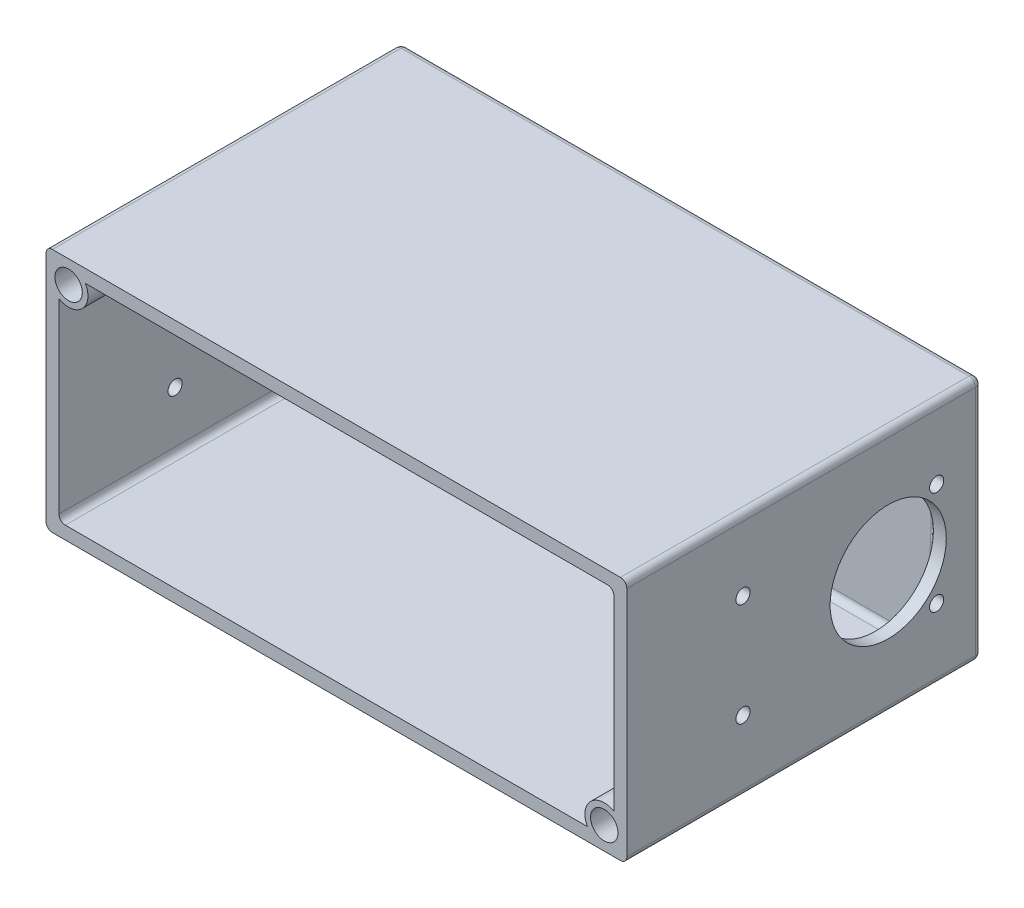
ISO-10303-21;
HEADER;
FILE_DESCRIPTION(('STEP AP214'),'2;1');
FILE_NAME('part.step','',(''),(''),'','','');
FILE_SCHEMA(('AUTOMOTIVE_DESIGN { 1 0 10303 214 1 1 1 1 }'));
ENDSEC;
DATA;
#1=APPLICATION_CONTEXT('core data for automotive mechanical design processes');
#2=APPLICATION_PROTOCOL_DEFINITION('international standard','automotive_design',2000,#1);
#3=PRODUCT_CONTEXT('',#1,'mechanical');
#4=PRODUCT('Part','Part','',(#3));
#5=PRODUCT_RELATED_PRODUCT_CATEGORY('part','',(#4));
#6=PRODUCT_DEFINITION_FORMATION('','',#4);
#7=PRODUCT_DEFINITION_CONTEXT('part definition',#1,'design');
#8=PRODUCT_DEFINITION('design','',#6,#7);
#9=PRODUCT_DEFINITION_SHAPE('','',#8);
#10=(LENGTH_UNIT() NAMED_UNIT(*) SI_UNIT(.MILLI.,.METRE.));
#11=(NAMED_UNIT(*) PLANE_ANGLE_UNIT() SI_UNIT($,.RADIAN.));
#12=(NAMED_UNIT(*) SI_UNIT($,.STERADIAN.) SOLID_ANGLE_UNIT());
#13=UNCERTAINTY_MEASURE_WITH_UNIT(LENGTH_MEASURE(1.E-05),#10,'distance_accuracy_value','');
#14=(GEOMETRIC_REPRESENTATION_CONTEXT(3) GLOBAL_UNCERTAINTY_ASSIGNED_CONTEXT((#13)) GLOBAL_UNIT_ASSIGNED_CONTEXT((#10,
#11,#12)) REPRESENTATION_CONTEXT('',''));
#15=CARTESIAN_POINT('',(0.,0.,0.));
#16=DIRECTION('',(0.,0.,1.));
#17=DIRECTION('',(1.,0.,0.));
#18=AXIS2_PLACEMENT_3D('',#15,#16,#17);
#19=CARTESIAN_POINT('',(43.,-17.,55.));
#20=DIRECTION('',(-1.,0.,0.));
#21=DIRECTION('',(0.,0.,1.));
#22=AXIS2_PLACEMENT_3D('',#19,#20,#21);
#23=PLANE('',#22);
#24=CARTESIAN_POINT('',(43.,-8.,37.));
#25=DIRECTION('',(-1.,0.,0.));
#26=DIRECTION('',(0.,0.,1.));
#27=AXIS2_PLACEMENT_3D('',#24,#25,#26);
#28=CIRCLE('',#27,1.1);
#29=CARTESIAN_POINT('',(43.,-8.,35.9));
#30=VERTEX_POINT('',#29);
#31=EDGE_CURVE('E312',#30,#30,#28,.T.);
#32=ORIENTED_EDGE('',*,*,#31,.F.);
#33=EDGE_LOOP('',(#32));
#34=FACE_BOUND('',#33,.T.);
#35=CARTESIAN_POINT('',(43.,8.,37.));
#36=DIRECTION('',(-1.,0.,0.));
#37=DIRECTION('',(0.,0.,1.));
#38=AXIS2_PLACEMENT_3D('',#35,#36,#37);
#39=CIRCLE('',#38,1.1);
#40=CARTESIAN_POINT('',(43.,8.,35.9));
#41=VERTEX_POINT('',#40);
#42=EDGE_CURVE('E295',#41,#41,#39,.T.);
#43=ORIENTED_EDGE('',*,*,#42,.F.);
#44=EDGE_LOOP('',(#43));
#45=FACE_BOUND('',#44,.T.);
#46=CARTESIAN_POINT('',(43.,8.,7.));
#47=DIRECTION('',(-1.,0.,0.));
#48=DIRECTION('',(0.,0.,1.));
#49=AXIS2_PLACEMENT_3D('',#46,#47,#48);
#50=CIRCLE('',#49,1.1);
#51=CARTESIAN_POINT('',(43.,7.54174243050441,6.));
#52=VERTEX_POINT('',#51);
#53=CARTESIAN_POINT('',(43.,8.45825756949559,6.));
#54=VERTEX_POINT('',#53);
#55=EDGE_CURVE('E301',#52,#54,#50,.T.);
#56=ORIENTED_EDGE('',*,*,#55,.F.);
#57=DIRECTION('',(0.,1.,0.));
#58=VECTOR('',#57,1.);
#59=CARTESIAN_POINT('',(43.,-12.9019237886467,6.));
#60=LINE('',#59,#58);
#61=CARTESIAN_POINT('',(43.,2.95803989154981,6.));
#62=VERTEX_POINT('',#61);
#63=EDGE_CURVE('E578',#52,#62,#60,.F.);
#64=ORIENTED_EDGE('',*,*,#63,.T.);
#65=CARTESIAN_POINT('',(43.,0.,14.5));
#66=DIRECTION('',(-1.,0.,0.));
#67=DIRECTION('',(0.,0.,1.));
#68=AXIS2_PLACEMENT_3D('',#65,#66,#67);
#69=CIRCLE('',#68,9.);
#70=CARTESIAN_POINT('',(43.,-2.95803989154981,6.));
#71=VERTEX_POINT('',#70);
#72=EDGE_CURVE('E289',#71,#62,#69,.T.);
#73=ORIENTED_EDGE('',*,*,#72,.F.);
#74=DIRECTION('',(0.,1.,0.));
#75=VECTOR('',#74,1.);
#76=CARTESIAN_POINT('',(43.,-12.9019237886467,6.));
#77=LINE('',#76,#75);
#78=CARTESIAN_POINT('',(43.,-7.54174243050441,6.));
#79=VERTEX_POINT('',#78);
#80=EDGE_CURVE('E624',#71,#79,#77,.F.);
#81=ORIENTED_EDGE('',*,*,#80,.T.);
#82=CARTESIAN_POINT('',(43.,-8.,7.));
#83=DIRECTION('',(-1.,0.,0.));
#84=DIRECTION('',(0.,0.,1.));
#85=AXIS2_PLACEMENT_3D('',#82,#83,#84);
#86=CIRCLE('',#85,1.1);
#87=CARTESIAN_POINT('',(43.,-8.45825756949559,6.));
#88=VERTEX_POINT('',#87);
#89=EDGE_CURVE('E306',#88,#79,#86,.T.);
#90=ORIENTED_EDGE('',*,*,#89,.F.);
#91=DIRECTION('',(0.,1.,0.));
#92=VECTOR('',#91,1.);
#93=CARTESIAN_POINT('',(43.,-12.9019237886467,6.));
#94=LINE('',#93,#92);
#95=CARTESIAN_POINT('',(43.,-12.9019237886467,6.));
#96=VERTEX_POINT('',#95);
#97=EDGE_CURVE('E226',#88,#96,#94,.F.);
#98=ORIENTED_EDGE('',*,*,#97,.T.);
#99=DIRECTION('',(0.,0.,-1.));
#100=VECTOR('',#99,1.);
#101=CARTESIAN_POINT('',(43.,-12.9019237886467,63.4852813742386));
#102=LINE('',#101,#100);
#103=CARTESIAN_POINT('',(43.,-12.9019237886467,55.));
#104=VERTEX_POINT('',#103);
#105=EDGE_CURVE('E220',#96,#104,#102,.F.);
#106=ORIENTED_EDGE('',*,*,#105,.T.);
#107=DIRECTION('',(0.,1.,0.));
#108=VECTOR('',#107,1.);
#109=CARTESIAN_POINT('',(43.,-17.,55.));
#110=LINE('',#109,#108);
#111=CARTESIAN_POINT('',(43.,16.,55.));
#112=VERTEX_POINT('',#111);
#113=EDGE_CURVE('E223',#104,#112,#110,.T.);
#114=ORIENTED_EDGE('',*,*,#113,.T.);
#115=DIRECTION('',(0.,0.,-1.));
#116=VECTOR('',#115,1.);
#117=CARTESIAN_POINT('',(43.,16.,5.));
#118=LINE('',#117,#116);
#119=CARTESIAN_POINT('',(43.,16.,6.));
#120=VERTEX_POINT('',#119);
#121=EDGE_CURVE('E930',#112,#120,#118,.T.);
#122=ORIENTED_EDGE('',*,*,#121,.T.);
#123=DIRECTION('',(0.,1.,0.));
#124=VECTOR('',#123,1.);
#125=CARTESIAN_POINT('',(43.,-12.9019237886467,6.));
#126=LINE('',#125,#124);
#127=EDGE_CURVE('E633',#120,#54,#126,.F.);
#128=ORIENTED_EDGE('',*,*,#127,.T.);
#129=EDGE_LOOP('',(#56,#64,#73,#81,#90,#98,#106,#114,#122,#128));
#130=FACE_BOUND('',#129,.T.);
#131=ADVANCED_FACE('F46',(#34,#45,#130),#23,.T.);
#132=CARTESIAN_POINT('',(-43.,-17.,55.));
#133=DIRECTION('',(0.,1.,0.));
#134=DIRECTION('',(-1.,0.,0.));
#135=AXIS2_PLACEMENT_3D('',#132,#133,#134);
#136=PLANE('',#135);
#137=DIRECTION('',(1.,0.,0.));
#138=VECTOR('',#137,1.);
#139=CARTESIAN_POINT('',(-43.,-17.,6.));
#140=LINE('',#139,#138);
#141=CARTESIAN_POINT('',(38.9019237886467,-17.,6.));
#142=VERTEX_POINT('',#141);
#143=CARTESIAN_POINT('',(-42.,-17.,6.));
#144=VERTEX_POINT('',#143);
#145=EDGE_CURVE('E330',#142,#144,#140,.F.);
#146=ORIENTED_EDGE('',*,*,#145,.T.);
#147=DIRECTION('',(0.,0.,-1.));
#148=VECTOR('',#147,1.);
#149=CARTESIAN_POINT('',(-42.,-17.,55.));
#150=LINE('',#149,#148);
#151=CARTESIAN_POINT('',(-42.,-17.,55.));
#152=VERTEX_POINT('',#151);
#153=EDGE_CURVE('E333',#144,#152,#150,.F.);
#154=ORIENTED_EDGE('',*,*,#153,.T.);
#155=DIRECTION('',(1.,0.,0.));
#156=VECTOR('',#155,1.);
#157=CARTESIAN_POINT('',(-43.,-17.,55.));
#158=LINE('',#157,#156);
#159=CARTESIAN_POINT('',(38.9019237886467,-17.,55.));
#160=VERTEX_POINT('',#159);
#161=EDGE_CURVE('E265',#152,#160,#158,.T.);
#162=ORIENTED_EDGE('',*,*,#161,.T.);
#163=DIRECTION('',(0.,0.,-1.));
#164=VECTOR('',#163,1.);
#165=CARTESIAN_POINT('',(38.9019237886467,-17.,63.4852813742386));
#166=LINE('',#165,#164);
#167=EDGE_CURVE('E231',#160,#142,#166,.T.);
#168=ORIENTED_EDGE('',*,*,#167,.T.);
#169=EDGE_LOOP('',(#146,#154,#162,#168));
#170=FACE_BOUND('',#169,.T.);
#171=ADVANCED_FACE('F521',(#170),#136,.T.);
#172=CARTESIAN_POINT('',(43.,17.,55.));
#173=DIRECTION('',(0.,-1.,0.));
#174=DIRECTION('',(1.,0.,0.));
#175=AXIS2_PLACEMENT_3D('',#172,#173,#174);
#176=PLANE('',#175);
#177=DIRECTION('',(-1.,0.,0.));
#178=VECTOR('',#177,1.);
#179=CARTESIAN_POINT('',(43.,17.,6.));
#180=LINE('',#179,#178);
#181=CARTESIAN_POINT('',(-38.9019237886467,17.,6.));
#182=VERTEX_POINT('',#181);
#183=CARTESIAN_POINT('',(42.,17.,6.));
#184=VERTEX_POINT('',#183);
#185=EDGE_CURVE('E921',#182,#184,#180,.F.);
#186=ORIENTED_EDGE('',*,*,#185,.T.);
#187=DIRECTION('',(0.,0.,-1.));
#188=VECTOR('',#187,1.);
#189=CARTESIAN_POINT('',(42.,17.,55.));
#190=LINE('',#189,#188);
#191=CARTESIAN_POINT('',(42.,17.,55.));
#192=VERTEX_POINT('',#191);
#193=EDGE_CURVE('E462',#184,#192,#190,.F.);
#194=ORIENTED_EDGE('',*,*,#193,.T.);
#195=DIRECTION('',(-1.,0.,0.));
#196=VECTOR('',#195,1.);
#197=CARTESIAN_POINT('',(43.,17.,55.));
#198=LINE('',#197,#196);
#199=CARTESIAN_POINT('',(-38.9019237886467,17.,55.));
#200=VERTEX_POINT('',#199);
#201=EDGE_CURVE('E249',#192,#200,#198,.T.);
#202=ORIENTED_EDGE('',*,*,#201,.T.);
#203=DIRECTION('',(0.,0.,-1.));
#204=VECTOR('',#203,1.);
#205=CARTESIAN_POINT('',(-38.9019237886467,17.,63.4852813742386));
#206=LINE('',#205,#204);
#207=EDGE_CURVE('E849',#200,#182,#206,.T.);
#208=ORIENTED_EDGE('',*,*,#207,.T.);
#209=EDGE_LOOP('',(#186,#194,#202,#208));
#210=FACE_BOUND('',#209,.T.);
#211=ADVANCED_FACE('F527',(#210),#176,.T.);
#212=CARTESIAN_POINT('',(-43.,17.,55.));
#213=DIRECTION('',(1.,0.,0.));
#214=DIRECTION('',(0.,1.,0.));
#215=AXIS2_PLACEMENT_3D('',#212,#213,#214);
#216=PLANE('',#215);
#217=CARTESIAN_POINT('',(-43.,-8.,37.));
#218=DIRECTION('',(1.,0.,0.));
#219=DIRECTION('',(0.,1.,0.));
#220=AXIS2_PLACEMENT_3D('',#217,#218,#219);
#221=CIRCLE('',#220,1.1);
#222=CARTESIAN_POINT('',(-43.,-8.,35.9));
#223=VERTEX_POINT('',#222);
#224=EDGE_CURVE('E308',#223,#223,#221,.T.);
#225=ORIENTED_EDGE('',*,*,#224,.F.);
#226=EDGE_LOOP('',(#225));
#227=FACE_BOUND('',#226,.T.);
#228=CARTESIAN_POINT('',(-43.,-8.,7.));
#229=DIRECTION('',(1.,0.,0.));
#230=DIRECTION('',(0.,1.,0.));
#231=AXIS2_PLACEMENT_3D('',#228,#229,#230);
#232=CIRCLE('',#231,1.1);
#233=CARTESIAN_POINT('',(-43.,-8.,5.9));
#234=VERTEX_POINT('',#233);
#235=EDGE_CURVE('E302',#234,#234,#232,.T.);
#236=ORIENTED_EDGE('',*,*,#235,.F.);
#237=EDGE_LOOP('',(#236));
#238=FACE_BOUND('',#237,.T.);
#239=CARTESIAN_POINT('',(-43.,8.,7.));
#240=DIRECTION('',(1.,0.,0.));
#241=DIRECTION('',(0.,1.,0.));
#242=AXIS2_PLACEMENT_3D('',#239,#240,#241);
#243=CIRCLE('',#242,1.1);
#244=CARTESIAN_POINT('',(-43.,8.,5.9));
#245=VERTEX_POINT('',#244);
#246=EDGE_CURVE('E297',#245,#245,#243,.T.);
#247=ORIENTED_EDGE('',*,*,#246,.F.);
#248=EDGE_LOOP('',(#247));
#249=FACE_BOUND('',#248,.T.);
#250=CARTESIAN_POINT('',(-43.,8.,37.));
#251=DIRECTION('',(1.,0.,0.));
#252=DIRECTION('',(0.,1.,0.));
#253=AXIS2_PLACEMENT_3D('',#250,#251,#252);
#254=CIRCLE('',#253,1.1);
#255=CARTESIAN_POINT('',(-43.,8.,35.9));
#256=VERTEX_POINT('',#255);
#257=EDGE_CURVE('E291',#256,#256,#254,.T.);
#258=ORIENTED_EDGE('',*,*,#257,.F.);
#259=EDGE_LOOP('',(#258));
#260=FACE_BOUND('',#259,.T.);
#261=CARTESIAN_POINT('',(-43.,0.,14.5));
#262=DIRECTION('',(1.,0.,0.));
#263=DIRECTION('',(0.,1.,0.));
#264=AXIS2_PLACEMENT_3D('',#261,#262,#263);
#265=CIRCLE('',#264,9.);
#266=CARTESIAN_POINT('',(-43.,0.,5.5));
#267=VERTEX_POINT('',#266);
#268=EDGE_CURVE('E285',#267,#267,#265,.T.);
#269=ORIENTED_EDGE('',*,*,#268,.F.);
#270=EDGE_LOOP('',(#269));
#271=FACE_BOUND('',#270,.T.);
#272=DIRECTION('',(0.,-1.,0.));
#273=VECTOR('',#272,1.);
#274=CARTESIAN_POINT('',(-43.,17.,55.));
#275=LINE('',#274,#273);
#276=CARTESIAN_POINT('',(-43.,12.9019237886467,55.));
#277=VERTEX_POINT('',#276);
#278=CARTESIAN_POINT('',(-43.,-16.,55.));
#279=VERTEX_POINT('',#278);
#280=EDGE_CURVE('E254',#277,#279,#275,.T.);
#281=ORIENTED_EDGE('',*,*,#280,.T.);
#282=DIRECTION('',(0.,0.,-1.));
#283=VECTOR('',#282,1.);
#284=CARTESIAN_POINT('',(-43.,-16.,5.));
#285=LINE('',#284,#283);
#286=CARTESIAN_POINT('',(-43.,-16.,5.));
#287=VERTEX_POINT('',#286);
#288=EDGE_CURVE('E316',#279,#287,#285,.T.);
#289=ORIENTED_EDGE('',*,*,#288,.T.);
#290=DIRECTION('',(0.,-1.,0.));
#291=VECTOR('',#290,1.);
#292=CARTESIAN_POINT('',(-43.,17.,5.));
#293=LINE('',#292,#291);
#294=CARTESIAN_POINT('',(-43.,12.9019237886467,5.));
#295=VERTEX_POINT('',#294);
#296=EDGE_CURVE('E250',#295,#287,#293,.T.);
#297=ORIENTED_EDGE('',*,*,#296,.F.);
#298=DIRECTION('',(0.,0.,-1.));
#299=VECTOR('',#298,1.);
#300=CARTESIAN_POINT('',(-43.,12.9019237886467,63.4852813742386));
#301=LINE('',#300,#299);
#302=EDGE_CURVE('E845',#295,#277,#301,.F.);
#303=ORIENTED_EDGE('',*,*,#302,.T.);
#304=EDGE_LOOP('',(#281,#289,#297,#303));
#305=FACE_BOUND('',#304,.T.);
#306=ADVANCED_FACE('F810',(#227,#238,#249,#260,#271,#305),#216,.T.);
#307=CARTESIAN_POINT('',(-45.,-19.,5.));
#308=DIRECTION('',(1.,0.,0.));
#309=DIRECTION('',(0.,0.,-1.));
#310=AXIS2_PLACEMENT_3D('',#307,#308,#309);
#311=PLANE('',#310);
#312=DIRECTION('',(0.,-1.,0.));
#313=VECTOR('',#312,1.);
#314=CARTESIAN_POINT('',(-45.,19.,55.));
#315=LINE('',#314,#313);
#316=CARTESIAN_POINT('',(-45.,18.,55.));
#317=VERTEX_POINT('',#316);
#318=CARTESIAN_POINT('',(-45.,-18.,55.));
#319=VERTEX_POINT('',#318);
#320=EDGE_CURVE('E272',#317,#319,#315,.T.);
#321=ORIENTED_EDGE('',*,*,#320,.F.);
#322=DIRECTION('',(0.,0.,-1.));
#323=VECTOR('',#322,1.);
#324=CARTESIAN_POINT('',(-45.,18.,5.));
#325=LINE('',#324,#323);
#326=CARTESIAN_POINT('',(-45.,18.,1.));
#327=VERTEX_POINT('',#326);
#328=EDGE_CURVE('E758',#317,#327,#325,.T.);
#329=ORIENTED_EDGE('',*,*,#328,.T.);
#330=DIRECTION('',(0.,-1.,0.));
#331=VECTOR('',#330,1.);
#332=CARTESIAN_POINT('',(-45.,-19.,1.));
#333=LINE('',#332,#331);
#334=CARTESIAN_POINT('',(-45.,-18.,1.));
#335=VERTEX_POINT('',#334);
#336=EDGE_CURVE('E461',#327,#335,#333,.T.);
#337=ORIENTED_EDGE('',*,*,#336,.T.);
#338=DIRECTION('',(0.,0.,-1.));
#339=VECTOR('',#338,1.);
#340=CARTESIAN_POINT('',(-45.,-18.,5.));
#341=LINE('',#340,#339);
#342=EDGE_CURVE('E761',#335,#319,#341,.F.);
#343=ORIENTED_EDGE('',*,*,#342,.T.);
#344=EDGE_LOOP('',(#321,#329,#337,#343));
#345=FACE_BOUND('',#344,.T.);
#346=CARTESIAN_POINT('',(-45.,-8.,37.));
#347=DIRECTION('',(1.,0.,0.));
#348=DIRECTION('',(0.,0.,-1.));
#349=AXIS2_PLACEMENT_3D('',#346,#347,#348);
#350=CIRCLE('',#349,1.1);
#351=CARTESIAN_POINT('',(-45.,-8.,35.9));
#352=VERTEX_POINT('',#351);
#353=EDGE_CURVE('E853',#352,#352,#350,.T.);
#354=ORIENTED_EDGE('',*,*,#353,.T.);
#355=EDGE_LOOP('',(#354));
#356=FACE_BOUND('',#355,.T.);
#357=CARTESIAN_POINT('',(-45.,-8.,7.));
#358=DIRECTION('',(1.,0.,0.));
#359=DIRECTION('',(0.,0.,-1.));
#360=AXIS2_PLACEMENT_3D('',#357,#358,#359);
#361=CIRCLE('',#360,1.1);
#362=CARTESIAN_POINT('',(-45.,-8.,5.9));
#363=VERTEX_POINT('',#362);
#364=EDGE_CURVE('E867',#363,#363,#361,.T.);
#365=ORIENTED_EDGE('',*,*,#364,.T.);
#366=EDGE_LOOP('',(#365));
#367=FACE_BOUND('',#366,.T.);
#368=CARTESIAN_POINT('',(-45.,8.,7.));
#369=DIRECTION('',(1.,0.,0.));
#370=DIRECTION('',(0.,0.,-1.));
#371=AXIS2_PLACEMENT_3D('',#368,#369,#370);
#372=CIRCLE('',#371,1.1);
#373=CARTESIAN_POINT('',(-45.,8.,5.9));
#374=VERTEX_POINT('',#373);
#375=EDGE_CURVE('E859',#374,#374,#372,.T.);
#376=ORIENTED_EDGE('',*,*,#375,.T.);
#377=EDGE_LOOP('',(#376));
#378=FACE_BOUND('',#377,.T.);
#379=CARTESIAN_POINT('',(-45.,8.,37.));
#380=DIRECTION('',(1.,0.,0.));
#381=DIRECTION('',(0.,0.,-1.));
#382=AXIS2_PLACEMENT_3D('',#379,#380,#381);
#383=CIRCLE('',#382,1.1);
#384=CARTESIAN_POINT('',(-45.,8.,35.9));
#385=VERTEX_POINT('',#384);
#386=EDGE_CURVE('E296',#385,#385,#383,.T.);
#387=ORIENTED_EDGE('',*,*,#386,.T.);
#388=EDGE_LOOP('',(#387));
#389=FACE_BOUND('',#388,.T.);
#390=CARTESIAN_POINT('',(-45.,0.,14.5));
#391=DIRECTION('',(1.,0.,0.));
#392=DIRECTION('',(0.,0.,-1.));
#393=AXIS2_PLACEMENT_3D('',#390,#391,#392);
#394=CIRCLE('',#393,9.);
#395=CARTESIAN_POINT('',(-45.,0.,5.5));
#396=VERTEX_POINT('',#395);
#397=EDGE_CURVE('E290',#396,#396,#394,.T.);
#398=ORIENTED_EDGE('',*,*,#397,.T.);
#399=EDGE_LOOP('',(#398));
#400=FACE_BOUND('',#399,.T.);
#401=ADVANCED_FACE('F768',(#345,#356,#367,#378,#389,#400),#311,.F.);
#402=CARTESIAN_POINT('',(45.,-19.,5.));
#403=DIRECTION('',(0.,1.,0.));
#404=DIRECTION('',(-1.,0.,0.));
#405=AXIS2_PLACEMENT_3D('',#402,#403,#404);
#406=PLANE('',#405);
#407=DIRECTION('',(1.,0.,0.));
#408=VECTOR('',#407,1.);
#409=CARTESIAN_POINT('',(45.,-19.,1.));
#410=LINE('',#409,#408);
#411=CARTESIAN_POINT('',(-44.,-19.,1.));
#412=VERTEX_POINT('',#411);
#413=CARTESIAN_POINT('',(44.,-19.,1.));
#414=VERTEX_POINT('',#413);
#415=EDGE_CURVE('E64',#412,#414,#410,.T.);
#416=ORIENTED_EDGE('',*,*,#415,.T.);
#417=DIRECTION('',(0.,0.,-1.));
#418=VECTOR('',#417,1.);
#419=CARTESIAN_POINT('',(44.,-19.,5.));
#420=LINE('',#419,#418);
#421=CARTESIAN_POINT('',(44.,-19.,55.));
#422=VERTEX_POINT('',#421);
#423=EDGE_CURVE('E708',#414,#422,#420,.F.);
#424=ORIENTED_EDGE('',*,*,#423,.T.);
#425=DIRECTION('',(1.,0.,0.));
#426=VECTOR('',#425,1.);
#427=CARTESIAN_POINT('',(-45.,-19.,55.));
#428=LINE('',#427,#426);
#429=CARTESIAN_POINT('',(-44.,-19.,55.));
#430=VERTEX_POINT('',#429);
#431=EDGE_CURVE('E276',#430,#422,#428,.T.);
#432=ORIENTED_EDGE('',*,*,#431,.F.);
#433=DIRECTION('',(0.,0.,-1.));
#434=VECTOR('',#433,1.);
#435=CARTESIAN_POINT('',(-44.,-19.,5.));
#436=LINE('',#435,#434);
#437=EDGE_CURVE('E69',#430,#412,#436,.T.);
#438=ORIENTED_EDGE('',*,*,#437,.T.);
#439=EDGE_LOOP('',(#416,#424,#432,#438));
#440=FACE_BOUND('',#439,.T.);
#441=ADVANCED_FACE('F801',(#440),#406,.F.);
#442=CARTESIAN_POINT('',(45.,-19.,5.));
#443=DIRECTION('',(-1.,0.,0.));
#444=DIRECTION('',(0.,0.,1.));
#445=AXIS2_PLACEMENT_3D('',#442,#443,#444);
#446=PLANE('',#445);
#447=CARTESIAN_POINT('',(45.,-8.,37.));
#448=DIRECTION('',(1.,0.,0.));
#449=DIRECTION('',(0.,0.,-1.));
#450=AXIS2_PLACEMENT_3D('',#447,#448,#449);
#451=CIRCLE('',#450,1.1);
#452=CARTESIAN_POINT('',(45.,-8.,35.9));
#453=VERTEX_POINT('',#452);
#454=EDGE_CURVE('E871',#453,#453,#451,.T.);
#455=ORIENTED_EDGE('',*,*,#454,.F.);
#456=EDGE_LOOP('',(#455));
#457=FACE_BOUND('',#456,.T.);
#458=CARTESIAN_POINT('',(45.,-8.,7.));
#459=DIRECTION('',(1.,0.,0.));
#460=DIRECTION('',(0.,0.,-1.));
#461=AXIS2_PLACEMENT_3D('',#458,#459,#460);
#462=CIRCLE('',#461,1.1);
#463=CARTESIAN_POINT('',(45.,-8.,5.9));
#464=VERTEX_POINT('',#463);
#465=EDGE_CURVE('E863',#464,#464,#462,.T.);
#466=ORIENTED_EDGE('',*,*,#465,.F.);
#467=EDGE_LOOP('',(#466));
#468=FACE_BOUND('',#467,.T.);
#469=CARTESIAN_POINT('',(45.,8.,7.));
#470=DIRECTION('',(1.,0.,0.));
#471=DIRECTION('',(0.,0.,-1.));
#472=AXIS2_PLACEMENT_3D('',#469,#470,#471);
#473=CIRCLE('',#472,1.1);
#474=CARTESIAN_POINT('',(45.,8.,5.9));
#475=VERTEX_POINT('',#474);
#476=EDGE_CURVE('E854',#475,#475,#473,.T.);
#477=ORIENTED_EDGE('',*,*,#476,.F.);
#478=EDGE_LOOP('',(#477));
#479=FACE_BOUND('',#478,.T.);
#480=CARTESIAN_POINT('',(45.,8.,37.));
#481=DIRECTION('',(1.,0.,0.));
#482=DIRECTION('',(0.,0.,-1.));
#483=AXIS2_PLACEMENT_3D('',#480,#481,#482);
#484=CIRCLE('',#483,1.1);
#485=CARTESIAN_POINT('',(45.,8.,35.9));
#486=VERTEX_POINT('',#485);
#487=EDGE_CURVE('E858',#486,#486,#484,.T.);
#488=ORIENTED_EDGE('',*,*,#487,.F.);
#489=EDGE_LOOP('',(#488));
#490=FACE_BOUND('',#489,.T.);
#491=CARTESIAN_POINT('',(45.,0.,14.5));
#492=DIRECTION('',(1.,0.,0.));
#493=DIRECTION('',(0.,0.,-1.));
#494=AXIS2_PLACEMENT_3D('',#491,#492,#493);
#495=CIRCLE('',#494,9.);
#496=CARTESIAN_POINT('',(45.,0.,5.5));
#497=VERTEX_POINT('',#496);
#498=EDGE_CURVE('E894',#497,#497,#495,.T.);
#499=ORIENTED_EDGE('',*,*,#498,.F.);
#500=EDGE_LOOP('',(#499));
#501=FACE_BOUND('',#500,.T.);
#502=DIRECTION('',(0.,1.,0.));
#503=VECTOR('',#502,1.);
#504=CARTESIAN_POINT('',(45.,-19.,1.));
#505=LINE('',#504,#503);
#506=CARTESIAN_POINT('',(45.,-18.,1.));
#507=VERTEX_POINT('',#506);
#508=CARTESIAN_POINT('',(45.,18.,1.));
#509=VERTEX_POINT('',#508);
#510=EDGE_CURVE('E718',#507,#509,#505,.T.);
#511=ORIENTED_EDGE('',*,*,#510,.T.);
#512=DIRECTION('',(0.,0.,-1.));
#513=VECTOR('',#512,1.);
#514=CARTESIAN_POINT('',(45.,18.,5.));
#515=LINE('',#514,#513);
#516=CARTESIAN_POINT('',(45.,18.,55.));
#517=VERTEX_POINT('',#516);
#518=EDGE_CURVE('E715',#509,#517,#515,.F.);
#519=ORIENTED_EDGE('',*,*,#518,.T.);
#520=DIRECTION('',(0.,1.,0.));
#521=VECTOR('',#520,1.);
#522=CARTESIAN_POINT('',(45.,-19.,55.));
#523=LINE('',#522,#521);
#524=CARTESIAN_POINT('',(45.,-18.,55.));
#525=VERTEX_POINT('',#524);
#526=EDGE_CURVE('E280',#525,#517,#523,.T.);
#527=ORIENTED_EDGE('',*,*,#526,.F.);
#528=DIRECTION('',(0.,0.,-1.));
#529=VECTOR('',#528,1.);
#530=CARTESIAN_POINT('',(45.,-18.,5.));
#531=LINE('',#530,#529);
#532=EDGE_CURVE('E721',#525,#507,#531,.T.);
#533=ORIENTED_EDGE('',*,*,#532,.T.);
#534=EDGE_LOOP('',(#511,#519,#527,#533));
#535=FACE_BOUND('',#534,.T.);
#536=ADVANCED_FACE('F789',(#457,#468,#479,#490,#501,#535),#446,.F.);
#537=CARTESIAN_POINT('',(45.,19.,5.));
#538=DIRECTION('',(0.,-1.,0.));
#539=DIRECTION('',(1.,0.,0.));
#540=AXIS2_PLACEMENT_3D('',#537,#538,#539);
#541=PLANE('',#540);
#542=DIRECTION('',(-1.,0.,0.));
#543=VECTOR('',#542,1.);
#544=CARTESIAN_POINT('',(45.,19.,1.));
#545=LINE('',#544,#543);
#546=CARTESIAN_POINT('',(44.,19.,1.));
#547=VERTEX_POINT('',#546);
#548=CARTESIAN_POINT('',(-44.,19.,1.));
#549=VERTEX_POINT('',#548);
#550=EDGE_CURVE('E752',#547,#549,#545,.T.);
#551=ORIENTED_EDGE('',*,*,#550,.T.);
#552=DIRECTION('',(0.,0.,-1.));
#553=VECTOR('',#552,1.);
#554=CARTESIAN_POINT('',(-44.,19.,5.));
#555=LINE('',#554,#553);
#556=CARTESIAN_POINT('',(-44.,19.,55.));
#557=VERTEX_POINT('',#556);
#558=EDGE_CURVE('E749',#549,#557,#555,.F.);
#559=ORIENTED_EDGE('',*,*,#558,.T.);
#560=DIRECTION('',(-1.,0.,0.));
#561=VECTOR('',#560,1.);
#562=CARTESIAN_POINT('',(45.,19.,55.));
#563=LINE('',#562,#561);
#564=CARTESIAN_POINT('',(44.,19.,55.));
#565=VERTEX_POINT('',#564);
#566=EDGE_CURVE('E267',#565,#557,#563,.T.);
#567=ORIENTED_EDGE('',*,*,#566,.F.);
#568=DIRECTION('',(0.,0.,-1.));
#569=VECTOR('',#568,1.);
#570=CARTESIAN_POINT('',(44.,19.,5.));
#571=LINE('',#570,#569);
#572=EDGE_CURVE('E755',#565,#547,#571,.T.);
#573=ORIENTED_EDGE('',*,*,#572,.T.);
#574=EDGE_LOOP('',(#551,#559,#567,#573));
#575=FACE_BOUND('',#574,.T.);
#576=ADVANCED_FACE('F798',(#575),#541,.F.);
#577=CARTESIAN_POINT('',(0.,0.,0.));
#578=DIRECTION('',(0.,0.,1.));
#579=DIRECTION('',(1.,0.,0.));
#580=AXIS2_PLACEMENT_3D('',#577,#578,#579);
#581=PLANE('',#580);
#582=DIRECTION('',(0.,-1.,0.));
#583=VECTOR('',#582,1.);
#584=CARTESIAN_POINT('',(-44.,0.,0.));
#585=LINE('',#584,#583);
#586=CARTESIAN_POINT('',(-44.,-18.,0.));
#587=VERTEX_POINT('',#586);
#588=CARTESIAN_POINT('',(-44.,18.,0.));
#589=VERTEX_POINT('',#588);
#590=EDGE_CURVE('E734',#587,#589,#585,.F.);
#591=ORIENTED_EDGE('',*,*,#590,.T.);
#592=DIRECTION('',(-1.,0.,0.));
#593=VECTOR('',#592,1.);
#594=CARTESIAN_POINT('',(0.,18.,0.));
#595=LINE('',#594,#593);
#596=CARTESIAN_POINT('',(44.,18.,0.));
#597=VERTEX_POINT('',#596);
#598=EDGE_CURVE('E724',#589,#597,#595,.F.);
#599=ORIENTED_EDGE('',*,*,#598,.T.);
#600=DIRECTION('',(0.,1.,0.));
#601=VECTOR('',#600,1.);
#602=CARTESIAN_POINT('',(44.,0.,0.));
#603=LINE('',#602,#601);
#604=CARTESIAN_POINT('',(44.,-18.,0.));
#605=VERTEX_POINT('',#604);
#606=EDGE_CURVE('E728',#597,#605,#603,.F.);
#607=ORIENTED_EDGE('',*,*,#606,.T.);
#608=DIRECTION('',(1.,0.,0.));
#609=VECTOR('',#608,1.);
#610=CARTESIAN_POINT('',(0.,-18.,0.));
#611=LINE('',#610,#609);
#612=EDGE_CURVE('E731',#605,#587,#611,.F.);
#613=ORIENTED_EDGE('',*,*,#612,.T.);
#614=EDGE_LOOP('',(#591,#599,#607,#613));
#615=FACE_BOUND('',#614,.T.);
#616=ADVANCED_FACE('F365',(#615),#581,.F.);
#617=CARTESIAN_POINT('',(0.,0.,55.));
#618=DIRECTION('',(0.,0.,1.));
#619=DIRECTION('',(1.,0.,0.));
#620=AXIS2_PLACEMENT_3D('',#617,#618,#619);
#621=PLANE('',#620);
#622=CARTESIAN_POINT('',(-41.5,15.5,55.));
#623=DIRECTION('',(0.,0.,1.));
#624=DIRECTION('',(1.,0.,0.));
#625=AXIS2_PLACEMENT_3D('',#622,#623,#624);
#626=CIRCLE('',#625,2.125);
#627=CARTESIAN_POINT('',(-39.375,15.5,55.));
#628=VERTEX_POINT('',#627);
#629=EDGE_CURVE('E824',#628,#628,#626,.T.);
#630=ORIENTED_EDGE('',*,*,#629,.F.);
#631=EDGE_LOOP('',(#630));
#632=FACE_BOUND('',#631,.T.);
#633=CARTESIAN_POINT('',(41.5,-15.5,55.));
#634=DIRECTION('',(0.,0.,1.));
#635=DIRECTION('',(1.,0.,0.));
#636=AXIS2_PLACEMENT_3D('',#633,#634,#635);
#637=CIRCLE('',#636,2.125);
#638=CARTESIAN_POINT('',(43.625,-15.5,55.));
#639=VERTEX_POINT('',#638);
#640=EDGE_CURVE('E827',#639,#639,#637,.T.);
#641=ORIENTED_EDGE('',*,*,#640,.F.);
#642=EDGE_LOOP('',(#641));
#643=FACE_BOUND('',#642,.T.);
#644=ORIENTED_EDGE('',*,*,#566,.T.);
#645=CARTESIAN_POINT('',(-44.,18.,55.));
#646=DIRECTION('',(0.,0.,1.));
#647=DIRECTION('',(1.,0.,0.));
#648=AXIS2_PLACEMENT_3D('',#645,#646,#647);
#649=CIRCLE('',#648,1.);
#650=EDGE_CURVE('E737',#557,#317,#649,.T.);
#651=ORIENTED_EDGE('',*,*,#650,.T.);
#652=ORIENTED_EDGE('',*,*,#320,.T.);
#653=CARTESIAN_POINT('',(-44.,-18.,55.));
#654=DIRECTION('',(0.,0.,1.));
#655=DIRECTION('',(1.,0.,0.));
#656=AXIS2_PLACEMENT_3D('',#653,#654,#655);
#657=CIRCLE('',#656,1.);
#658=EDGE_CURVE('E746',#319,#430,#657,.T.);
#659=ORIENTED_EDGE('',*,*,#658,.T.);
#660=ORIENTED_EDGE('',*,*,#431,.T.);
#661=CARTESIAN_POINT('',(44.,-18.,55.));
#662=DIRECTION('',(0.,0.,1.));
#663=DIRECTION('',(1.,0.,0.));
#664=AXIS2_PLACEMENT_3D('',#661,#662,#663);
#665=CIRCLE('',#664,1.);
#666=EDGE_CURVE('E743',#422,#525,#665,.T.);
#667=ORIENTED_EDGE('',*,*,#666,.T.);
#668=ORIENTED_EDGE('',*,*,#526,.T.);
#669=CARTESIAN_POINT('',(44.,18.,55.));
#670=DIRECTION('',(0.,0.,1.));
#671=DIRECTION('',(1.,0.,0.));
#672=AXIS2_PLACEMENT_3D('',#669,#670,#671);
#673=CIRCLE('',#672,1.);
#674=EDGE_CURVE('E740',#517,#565,#673,.T.);
#675=ORIENTED_EDGE('',*,*,#674,.T.);
#676=EDGE_LOOP('',(#644,#651,#652,#659,#660,#667,#668,#675));
#677=FACE_BOUND('',#676,.T.);
#678=ORIENTED_EDGE('',*,*,#113,.F.);
#679=CARTESIAN_POINT('',(41.5,-15.5,55.));
#680=DIRECTION('',(0.,0.,1.));
#681=DIRECTION('',(1.,0.,0.));
#682=AXIS2_PLACEMENT_3D('',#679,#680,#681);
#683=CIRCLE('',#682,3.);
#684=EDGE_CURVE('E235',#104,#160,#683,.T.);
#685=ORIENTED_EDGE('',*,*,#684,.T.);
#686=ORIENTED_EDGE('',*,*,#161,.F.);
#687=CARTESIAN_POINT('',(-42.,-16.,55.));
#688=DIRECTION('',(0.,0.,1.));
#689=DIRECTION('',(1.,0.,0.));
#690=AXIS2_PLACEMENT_3D('',#687,#688,#689);
#691=CIRCLE('',#690,1.);
#692=EDGE_CURVE('E56',#152,#279,#691,.F.);
#693=ORIENTED_EDGE('',*,*,#692,.T.);
#694=ORIENTED_EDGE('',*,*,#280,.F.);
#695=CARTESIAN_POINT('',(-41.5,15.5,55.));
#696=DIRECTION('',(0.,0.,1.));
#697=DIRECTION('',(1.,0.,0.));
#698=AXIS2_PLACEMENT_3D('',#695,#696,#697);
#699=CIRCLE('',#698,3.);
#700=EDGE_CURVE('E230',#277,#200,#699,.T.);
#701=ORIENTED_EDGE('',*,*,#700,.T.);
#702=ORIENTED_EDGE('',*,*,#201,.F.);
#703=CARTESIAN_POINT('',(42.,16.,55.));
#704=DIRECTION('',(0.,0.,1.));
#705=DIRECTION('',(1.,0.,0.));
#706=AXIS2_PLACEMENT_3D('',#703,#704,#705);
#707=CIRCLE('',#706,1.);
#708=EDGE_CURVE('E11',#192,#112,#707,.F.);
#709=ORIENTED_EDGE('',*,*,#708,.T.);
#710=EDGE_LOOP('',(#678,#685,#686,#693,#694,#701,#702,#709));
#711=FACE_BOUND('',#710,.T.);
#712=ADVANCED_FACE('F245',(#632,#643,#677,#711),#621,.T.);
#713=CARTESIAN_POINT('',(0.,0.,5.));
#714=DIRECTION('',(0.,0.,1.));
#715=DIRECTION('',(1.,0.,0.));
#716=AXIS2_PLACEMENT_3D('',#713,#714,#715);
#717=PLANE('',#716);
#718=ORIENTED_EDGE('',*,*,#296,.T.);
#719=DIRECTION('',(1.,0.,0.));
#720=VECTOR('',#719,1.);
#721=CARTESIAN_POINT('',(38.9019237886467,-16.,5.));
#722=LINE('',#721,#720);
#723=CARTESIAN_POINT('',(38.5419601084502,-16.,5.));
#724=VERTEX_POINT('',#723);
#725=EDGE_CURVE('E415',#287,#724,#722,.T.);
#726=ORIENTED_EDGE('',*,*,#725,.T.);
#727=CARTESIAN_POINT('',(41.5,-15.5,5.));
#728=DIRECTION('',(0.,0.,1.));
#729=DIRECTION('',(1.,0.,0.));
#730=AXIS2_PLACEMENT_3D('',#727,#728,#729);
#731=CIRCLE('',#730,3.);
#732=CARTESIAN_POINT('',(42.,-12.5419601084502,5.));
#733=VERTEX_POINT('',#732);
#734=EDGE_CURVE('E242',#733,#724,#731,.T.);
#735=ORIENTED_EDGE('',*,*,#734,.F.);
#736=DIRECTION('',(0.,1.,0.));
#737=VECTOR('',#736,1.);
#738=CARTESIAN_POINT('',(42.,17.,5.));
#739=LINE('',#738,#737);
#740=CARTESIAN_POINT('',(42.,-8.45825756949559,5.));
#741=VERTEX_POINT('',#740);
#742=EDGE_CURVE('E411',#733,#741,#739,.T.);
#743=ORIENTED_EDGE('',*,*,#742,.T.);
#744=CARTESIAN_POINT('',(43.,-7.18111333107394,6.26554467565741));
#745=CARTESIAN_POINT('',(43.3317293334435,-7.2881587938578,5.));
#746=CARTESIAN_POINT('',(42.0824881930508,-6.88504220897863,5.));
#747=CARTESIAN_POINT('',(43.,-7.19622297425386,6.24876723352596));
#748=CARTESIAN_POINT('',(43.3087793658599,-7.28275838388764,5.));
#749=CARTESIAN_POINT('',(42.0675805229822,-6.93117825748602,5.));
#750=CARTESIAN_POINT('',(43.,-7.21311784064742,6.23090887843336));
#751=CARTESIAN_POINT('',(43.2835820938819,-7.28257799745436,5.));
#752=CARTESIAN_POINT('',(42.0551787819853,-6.97803889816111,5.));
#753=CARTESIAN_POINT('',(43.,-7.25128944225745,6.19366902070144));
#754=CARTESIAN_POINT('',(43.2318025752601,-7.29323454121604,5.));
#755=CARTESIAN_POINT('',(42.0347251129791,-7.07252464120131,5.));
#756=CARTESIAN_POINT('',(43.,-7.27254918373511,6.1742936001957));
#757=CARTESIAN_POINT('',(43.2052921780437,-7.3037699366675,5.));
#758=CARTESIAN_POINT('',(42.0266567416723,-7.12014613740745,5.));
#759=CARTESIAN_POINT('',(43.,-7.32025879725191,6.13460891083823));
#760=CARTESIAN_POINT('',(43.1531962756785,-7.33561692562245,5.));
#761=CARTESIAN_POINT('',(42.014132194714,-7.21561862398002,5.));
#762=CARTESIAN_POINT('',(43.,-7.34668541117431,6.11430412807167));
#763=CARTESIAN_POINT('',(43.1276005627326,-7.3566272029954,5.));
#764=CARTESIAN_POINT('',(42.0096602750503,-7.26346768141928,5.));
#765=CARTESIAN_POINT('',(43.,-7.405626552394,6.07371503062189));
#766=CARTESIAN_POINT('',(43.0791150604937,-7.40853727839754,5.));
#767=CARTESIAN_POINT('',(42.0034105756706,-7.35937864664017,5.));
#768=CARTESIAN_POINT('',(43.,-7.43814759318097,6.05343076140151));
#769=CARTESIAN_POINT('',(43.056148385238,-7.43925233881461,5.));
#770=CARTESIAN_POINT('',(42.0016356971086,-7.40744072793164,5.));
#771=CARTESIAN_POINT('',(43.,-7.52269927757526,6.00740162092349));
#772=CARTESIAN_POINT('',(43.0071285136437,-7.5215975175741,5.));
#773=CARTESIAN_POINT('',(41.9995370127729,-7.52086400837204,5.));
#774=CARTESIAN_POINT('',(43.,-7.57754072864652,5.98231489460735));
#775=CARTESIAN_POINT('',(42.9824129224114,-7.57698350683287,5.));
#776=CARTESIAN_POINT('',(41.9999641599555,-7.58623327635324,5.));
#777=CARTESIAN_POINT('',(43.,-7.69860742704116,5.94017733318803));
#778=CARTESIAN_POINT('',(42.943429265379,-7.69893515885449,5.));
#779=CARTESIAN_POINT('',(42.001720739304,-7.71692038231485,5.));
#780=CARTESIAN_POINT('',(43.,-7.76482818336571,5.92312333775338));
#781=CARTESIAN_POINT('',(42.9287893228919,-7.76577360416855,5.));
#782=CARTESIAN_POINT('',(42.0030498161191,-7.78223823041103,5.));
#783=CARTESIAN_POINT('',(43.,-7.90388715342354,5.90196281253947));
#784=CARTESIAN_POINT('',(42.9110807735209,-7.90440969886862,5.));
#785=CARTESIAN_POINT('',(42.0047917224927,-7.91312019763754,5.));
#786=CARTESIAN_POINT('',(43.,-7.97674755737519,5.89790146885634));
#787=CARTESIAN_POINT('',(42.9078327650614,-7.97701505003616,5.));
#788=CARTESIAN_POINT('',(42.0052013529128,-7.97868438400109,5.));
#789=CARTESIAN_POINT('',(43.,-8.12054024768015,5.90425069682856));
#790=CARTESIAN_POINT('',(42.9130217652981,-8.11969059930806,5.));
#791=CARTESIAN_POINT('',(42.0046279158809,-8.10984569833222,5.));
#792=CARTESIAN_POINT('',(43.,-8.19147128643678,5.91467041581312));
#793=CARTESIAN_POINT('',(42.9215344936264,-8.1906943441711,5.));
#794=CARTESIAN_POINT('',(42.0036439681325,-8.17544282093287,5.));
#795=CARTESIAN_POINT('',(43.,-8.32492394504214,5.94679316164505));
#796=CARTESIAN_POINT('',(42.9494428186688,-8.32453933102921,5.));
#797=CARTESIAN_POINT('',(42.0014403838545,-8.30749987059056,5.));
#798=CARTESIAN_POINT('',(43.,-8.38732128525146,5.96864429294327));
#799=CARTESIAN_POINT('',(42.9693028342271,-8.38785020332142,5.));
#800=CARTESIAN_POINT('',(42.0002177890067,-8.37395967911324,5.));
#801=CARTESIAN_POINT('',(43.,-8.49935121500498,6.01794771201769));
#802=CARTESIAN_POINT('',(43.0179747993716,-8.50015822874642,5.));
#803=CARTESIAN_POINT('',(41.9998358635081,-8.50680816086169,5.));
#804=CARTESIAN_POINT('',(43.,-8.54900528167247,6.04539043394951));
#805=CARTESIAN_POINT('',(43.0471610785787,-8.54920209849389,5.));
#806=CARTESIAN_POINT('',(42.0006730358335,-8.57319676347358,5.));
#807=CARTESIAN_POINT('',(43.,-8.61437295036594,6.08719680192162));
#808=CARTESIAN_POINT('',(43.0949085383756,-8.6091704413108,5.));
#809=CARTESIAN_POINT('',(42.0053455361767,-8.67254540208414,5.));
#810=CARTESIAN_POINT('',(43.,-8.63462257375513,6.10122041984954));
#811=CARTESIAN_POINT('',(43.111688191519,-8.62702449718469,5.));
#812=CARTESIAN_POINT('',(42.0074674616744,-8.70557922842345,5.));
#813=CARTESIAN_POINT('',(43.,-8.67237166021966,6.12909992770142));
#814=CARTESIAN_POINT('',(43.1461984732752,-8.65807579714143,5.));
#815=CARTESIAN_POINT('',(42.0131342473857,-8.77151774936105,5.));
#816=CARTESIAN_POINT('',(43.,-8.68987196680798,6.14295586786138));
#817=CARTESIAN_POINT('',(43.1639474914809,-8.67120309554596,5.));
#818=CARTESIAN_POINT('',(42.0166786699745,-8.80442248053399,5.));
#819=CARTESIAN_POINT('',(43.,-8.7225030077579,6.17027296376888));
#820=CARTESIAN_POINT('',(43.1999074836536,-8.69264186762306,5.));
#821=CARTESIAN_POINT('',(42.025490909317,-8.87022668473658,5.));
#822=CARTESIAN_POINT('',(43.,-8.73761746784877,6.18373093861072));
#823=CARTESIAN_POINT('',(43.2181212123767,-8.70083661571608,5.));
#824=CARTESIAN_POINT('',(42.0307698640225,-8.90312471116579,5.));
#825=CARTESIAN_POINT('',(43.,-8.76564542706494,6.20996876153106));
#826=CARTESIAN_POINT('',(43.2542162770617,-8.71221424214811,5.));
#827=CARTESIAN_POINT('',(42.0432892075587,-8.96858369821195,5.));
#828=CARTESIAN_POINT('',(43.,-8.7785562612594,6.22274777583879));
#829=CARTESIAN_POINT('',(43.2720823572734,-8.71530475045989,5.));
#830=CARTESIAN_POINT('',(42.050531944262,-9.00114420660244,5.));
#831=CARTESIAN_POINT('',(43.,-8.79050150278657,6.23507688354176));
#832=CARTESIAN_POINT('',(43.2892280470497,-8.71584168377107,5.));
#833=CARTESIAN_POINT('',(42.0588729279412,-9.03343913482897,5.));
#834=(BOUNDED_SURFACE() B_SPLINE_SURFACE(3,2,((#744,#745,#746),(#747,#748,#749),(#750,#751,
#752),(#753,#754,#755),(#756,#757,#758),(#759,#760,#761),(#762,#763,#764),(#765,#766,#767),
(#768,#769,#770),(#771,#772,#773),(#774,#775,#776),(#777,#778,#779),(#780,#781,#782),(#783,#784,
#785),(#786,#787,#788),(#789,#790,#791),(#792,#793,#794),(#795,#796,#797),(#798,#799,#800),
(#801,#802,#803),(#804,#805,#806),(#807,#808,#809),(#810,#811,#812),(#813,#814,#815),(#816,#817,
#818),(#819,#820,#821),(#822,#823,#824),(#825,#826,#827),(#828,#829,#830),(#831,#832,#833)),
.UNSPECIFIED.,.F.,.F.,.F.) B_SPLINE_SURFACE_WITH_KNOTS((4,2,2,2,2,2,2,2,2,2,2,2,2,2,4),(3,3),
(0.,0.145268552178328,0.289981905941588,0.434058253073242,0.578289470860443,0.774366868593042,
0.970367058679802,1.16704816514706,1.36385356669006,1.56327432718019,1.76235674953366,
1.86163685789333,1.96088644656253,2.06078622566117,2.16080597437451),(0.,1.),
.UNSPECIFIED.) GEOMETRIC_REPRESENTATION_ITEM() RATIONAL_B_SPLINE_SURFACE(((1.,0.605993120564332,
1.),(1.,0.612920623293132,1.),(1.,0.620163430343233,1.),(1.,0.634994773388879,1.),(1.,
0.642581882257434,1.),(1.,0.657840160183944,1.),(1.,0.665510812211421,1.),(1.,0.680587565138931,
1.),(1.,0.687993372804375,1.),(1.,0.704548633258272,1.),(1.,0.713367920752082,1.),(1.,
0.727988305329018,1.),(1.,0.733790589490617,1.),(1.,0.740968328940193,1.),(1.,0.742328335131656,
1.),(1.,0.740185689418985,1.),(1.,0.736679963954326,1.),(1.,0.725693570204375,1.),(1.,
0.718160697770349,1.),(1.,0.700785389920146,1.),(1.,0.690946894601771,1.),(1.,0.675595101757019,
1.),(1.,0.670386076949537,1.),(1.,0.659906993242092,1.),(1.,0.654636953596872,1.),(1.,
0.644120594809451,1.),(1.,0.638874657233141,1.),(1.,0.628524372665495,1.),(1.,0.623420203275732,
1.),(1.,0.618434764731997,1.))) REPRESENTATION_ITEM('') SURFACE());
#835=CARTESIAN_POINT('',(42.0588729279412,-9.03343913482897,5.));
#836=CARTESIAN_POINT('',(42.050531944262,-9.00114420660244,5.));
#837=CARTESIAN_POINT('',(42.0432892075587,-8.96858369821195,5.));
#838=CARTESIAN_POINT('',(42.0307698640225,-8.90312471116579,5.));
#839=CARTESIAN_POINT('',(42.025490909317,-8.87022668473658,5.));
#840=CARTESIAN_POINT('',(42.0166786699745,-8.80442248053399,5.));
#841=CARTESIAN_POINT('',(42.0131342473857,-8.77151774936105,5.));
#842=CARTESIAN_POINT('',(42.0074674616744,-8.70557922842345,5.));
#843=CARTESIAN_POINT('',(42.0053455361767,-8.67254540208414,5.));
#844=CARTESIAN_POINT('',(42.0006730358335,-8.57319676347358,5.));
#845=CARTESIAN_POINT('',(41.9998358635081,-8.50680816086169,5.));
#846=CARTESIAN_POINT('',(42.0002177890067,-8.37395967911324,5.));
#847=CARTESIAN_POINT('',(42.0014403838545,-8.30749987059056,5.));
#848=CARTESIAN_POINT('',(42.0036439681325,-8.17544282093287,5.));
#849=CARTESIAN_POINT('',(42.0046279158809,-8.10984569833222,5.));
#850=CARTESIAN_POINT('',(42.0052013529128,-7.97868438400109,5.));
#851=CARTESIAN_POINT('',(42.0047917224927,-7.91312019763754,5.));
#852=CARTESIAN_POINT('',(42.0030498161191,-7.78223823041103,5.));
#853=CARTESIAN_POINT('',(42.001720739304,-7.71692038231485,5.));
#854=CARTESIAN_POINT('',(41.9999641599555,-7.58623327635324,5.));
#855=CARTESIAN_POINT('',(41.9995370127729,-7.52086400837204,5.));
#856=CARTESIAN_POINT('',(42.0016356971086,-7.40744072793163,5.));
#857=CARTESIAN_POINT('',(42.0034105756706,-7.35937864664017,5.));
#858=CARTESIAN_POINT('',(42.0096602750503,-7.26346768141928,5.));
#859=CARTESIAN_POINT('',(42.014132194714,-7.21561862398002,5.));
#860=CARTESIAN_POINT('',(42.0266567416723,-7.12014613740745,5.));
#861=CARTESIAN_POINT('',(42.0347251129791,-7.07252464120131,5.));
#862=CARTESIAN_POINT('',(42.0551787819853,-6.97803889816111,5.));
#863=CARTESIAN_POINT('',(42.0675805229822,-6.93117825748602,5.));
#864=CARTESIAN_POINT('',(42.0824881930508,-6.88504220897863,5.));
#865=B_SPLINE_CURVE_WITH_KNOTS('',3,(#835,#836,#837,#838,#839,#840,#841,#842,#843,#844,#845,
#846,#847,#848,#849,#850,#851,#852,#853,#854,#855,#856,#857,#858,#859,#860,#861,#862,#863,#864),
.UNSPECIFIED.,.F.,.F.,(4,2,2,2,2,2,2,2,2,2,2,2,2,2,4),(0.,0.100019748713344,0.199919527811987,
0.299169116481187,0.398449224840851,0.597531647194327,0.796952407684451,0.993757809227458,
1.19043891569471,1.38643910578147,1.58251650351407,1.72674772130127,1.87082406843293,
2.01553742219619,2.16080597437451),.UNSPECIFIED.);
#866=CARTESIAN_POINT('',(42.,-7.54174243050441,5.));
#867=VERTEX_POINT('',#866);
#868=EDGE_CURVE('E404',#741,#867,#865,.T.);
#869=ORIENTED_EDGE('',*,*,#868,.T.);
#870=DIRECTION('',(0.,1.,0.));
#871=VECTOR('',#870,1.);
#872=CARTESIAN_POINT('',(42.,17.,5.));
#873=LINE('',#872,#871);
#874=CARTESIAN_POINT('',(42.,-2.95803989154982,5.));
#875=VERTEX_POINT('',#874);
#876=EDGE_CURVE('E397',#867,#875,#873,.T.);
#877=ORIENTED_EDGE('',*,*,#876,.T.);
#878=CARTESIAN_POINT('',(43.,4.1787435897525,6.52892090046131));
#879=CARTESIAN_POINT('',(43.2942618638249,4.07701876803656,6.02935166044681));
#880=CARTESIAN_POINT('',(43.0242547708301,4.17035883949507,5.5146758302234));
#881=CARTESIAN_POINT('',(42.7542476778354,4.26369891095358,5.));
#882=CARTESIAN_POINT('',(42.1979038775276,4.4560241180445,5.));
#883=CARTESIAN_POINT('',(43.,4.14690859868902,6.51223094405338));
#884=CARTESIAN_POINT('',(43.2835611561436,4.05503471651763,6.01220729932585));
#885=CARTESIAN_POINT('',(43.0100530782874,4.14391545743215,5.50607911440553));
#886=CARTESIAN_POINT('',(42.7366279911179,4.2329551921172,5.));
#887=CARTESIAN_POINT('',(42.1829524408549,4.41274514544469,5.));
#888=CARTESIAN_POINT('',(43.,4.11448349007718,6.49547649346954));
#889=CARTESIAN_POINT('',(43.272691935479,4.03125641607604,5.99539725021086));
#890=CARTESIAN_POINT('',(42.9961391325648,4.11589731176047,5.497676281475));
#891=CARTESIAN_POINT('',(42.7196605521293,4.20069968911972,5.));
#892=CARTESIAN_POINT('',(42.1691894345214,4.36907574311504,5.));
#893=CARTESIAN_POINT('',(43.,4.04857142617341,6.46193847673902));
#894=CARTESIAN_POINT('',(43.2509710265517,3.98073220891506,5.96255096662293));
#895=CARTESIAN_POINT('',(42.9690480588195,4.05721066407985,5.48125318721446));
#896=CARTESIAN_POINT('',(42.6871981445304,4.13384668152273,5.));
#897=CARTESIAN_POINT('',(42.1437942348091,4.28114698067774,5.));
#898=CARTESIAN_POINT('',(43.,4.01508510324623,6.44515493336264));
#899=CARTESIAN_POINT('',(43.2401161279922,3.95399684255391,5.94650540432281));
#900=CARTESIAN_POINT('',(42.9558705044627,4.026543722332,5.47323270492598));
#901=CARTESIAN_POINT('',(42.6716897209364,4.09925363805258,5.));
#902=CARTESIAN_POINT('',(42.1321607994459,4.2368879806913,5.));
#903=CARTESIAN_POINT('',(43.,3.91330429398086,6.39495460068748));
#904=CARTESIAN_POINT('',(43.2081070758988,3.8703802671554,5.89967236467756));
#905=CARTESIAN_POINT('',(42.9177156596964,3.93140781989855,5.44975676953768));
#906=CARTESIAN_POINT('',(42.6275826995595,3.99307711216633,5.));
#907=CARTESIAN_POINT('',(42.1001093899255,4.10363168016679,5.));
#908=CARTESIAN_POINT('',(43.,3.84354702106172,6.36161388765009));
#909=CARTESIAN_POINT('',(43.1872701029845,3.80959059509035,5.86982702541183));
#910=CARTESIAN_POINT('',(42.8940523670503,3.86368317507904,5.43484909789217));
#911=CARTESIAN_POINT('',(42.6010312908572,3.91841420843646,5.));
#912=CARTESIAN_POINT('',(42.0824767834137,4.01396320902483,5.));
#913=CARTESIAN_POINT('',(43.,3.70119990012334,6.29590178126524));
#914=CARTESIAN_POINT('',(43.147841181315,3.68119681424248,5.81311498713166));
#915=CARTESIAN_POINT('',(42.8506698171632,3.72262950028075,5.40649463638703));
#916=CARTESIAN_POINT('',(42.5536912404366,3.76468996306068,5.));
#917=CARTESIAN_POINT('',(42.0532459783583,3.83433543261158,5.));
#918=CARTESIAN_POINT('',(43.,3.62863318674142,6.26352525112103));
#919=CARTESIAN_POINT('',(43.1291983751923,3.61364919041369,5.78617907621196));
#920=CARTESIAN_POINT('',(42.830924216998,3.64934282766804,5.39303838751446));
#921=CARTESIAN_POINT('',(42.5327933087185,3.68563712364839,5.));
#922=CARTESIAN_POINT('',(42.0416065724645,3.74438251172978,5.));
#923=CARTESIAN_POINT('',(43.,3.4805234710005,6.19985200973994));
#924=CARTESIAN_POINT('',(43.0942559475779,3.47307858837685,5.73481277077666));
#925=CARTESIAN_POINT('',(42.7949872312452,3.49831906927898,5.36735573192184));
#926=CARTESIAN_POINT('',(42.4958601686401,3.5241561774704,5.));
#927=CARTESIAN_POINT('',(42.0230387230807,3.56398178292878,5.));
#928=CARTESIAN_POINT('',(43.,3.40497967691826,6.16855558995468));
#929=CARTESIAN_POINT('',(43.0779236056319,3.40003728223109,5.71034141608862));
#930=CARTESIAN_POINT('',(42.7787967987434,3.42058079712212,5.3551296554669));
#931=CARTESIAN_POINT('',(42.4797722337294,3.44168485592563,5.));
#932=CARTESIAN_POINT('',(42.0161115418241,3.47353384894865,5.));
#933=CARTESIAN_POINT('',(43.,3.23654671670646,6.10151989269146));
#934=CARTESIAN_POINT('',(43.0447605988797,3.23549174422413,5.65932087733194));
#935=CARTESIAN_POINT('',(42.746887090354,3.2466474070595,5.32960248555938));
#936=CARTESIAN_POINT('',(42.4491589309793,3.25859150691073,5.));
#937=CARTESIAN_POINT('',(42.0050991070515,3.27520245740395,5.));
#938=CARTESIAN_POINT('',(43.,3.14309297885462,6.06606883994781));
#939=CARTESIAN_POINT('',(43.0283571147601,3.14294599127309,5.63316970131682));
#940=CARTESIAN_POINT('',(42.7318440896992,3.14975566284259,5.3165397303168));
#941=CARTESIAN_POINT('',(42.4354277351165,3.15728369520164,5.));
#942=CARTESIAN_POINT('',(42.0018057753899,3.16727725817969,5.));
#943=CARTESIAN_POINT('',(43.,2.95266538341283,5.99752864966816));
#944=CARTESIAN_POINT('',(42.9986861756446,2.953192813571,5.58391550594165));
#945=CARTESIAN_POINT('',(42.705726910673,2.95244338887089,5.29191346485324));
#946=CARTESIAN_POINT('',(42.4128606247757,2.95240829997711,5.));
#947=CARTESIAN_POINT('',(41.999336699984,2.95137114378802,5.));
#948=CARTESIAN_POINT('',(43.,2.8556907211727,5.96444005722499));
#949=CARTESIAN_POINT('',(42.985382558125,2.85592673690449,5.56076752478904));
#950=CARTESIAN_POINT('',(42.694653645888,2.85202205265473,5.28035030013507));
#951=CARTESIAN_POINT('',(42.4039796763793,2.84875802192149,5.));
#952=CARTESIAN_POINT('',(42.0001619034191,2.84339022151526,5.));
#953=CARTESIAN_POINT('',(43.,2.55973170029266,5.86919997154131));
#954=CARTESIAN_POINT('',(42.9497955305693,2.55939191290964,5.49577829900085));
#955=CARTESIAN_POINT('',(42.6664057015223,2.54656458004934,5.24775202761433));
#956=CARTESIAN_POINT('',(42.3832595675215,2.53628014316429,5.));
#957=CARTESIAN_POINT('',(42.0071845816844,2.51935302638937,5.));
#958=CARTESIAN_POINT('',(43.,2.35589205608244,5.81114670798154));
#959=CARTESIAN_POINT('',(42.93148319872,2.35331994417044,5.45782125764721));
#960=CARTESIAN_POINT('',(42.6542342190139,2.33752310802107,5.22883482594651));
#961=CARTESIAN_POINT('',(42.3770648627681,2.32367359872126,5.));
#962=CARTESIAN_POINT('',(42.0179363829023,2.30341322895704,5.));
#963=CARTESIAN_POINT('',(43.,1.93702888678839,5.70826891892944));
#964=CARTESIAN_POINT('',(42.9032480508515,1.93145413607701,5.39250286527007));
#965=CARTESIAN_POINT('',(42.638321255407,1.91231066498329,5.19617807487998));
#966=CARTESIAN_POINT('',(42.3734602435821,1.89510401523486,5.));
#967=CARTESIAN_POINT('',(42.0442532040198,1.87148472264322,5.));
#968=CARTESIAN_POINT('',(43.,1.72198449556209,5.66347019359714));
#969=CARTESIAN_POINT('',(42.8932221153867,1.71508619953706,5.36496602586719));
#970=CARTESIAN_POINT('',(42.6345961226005,1.69612668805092,5.18244860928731));
#971=CARTESIAN_POINT('',(42.3759819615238,1.67851109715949,5.));
#972=CARTESIAN_POINT('',(42.0598274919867,1.65549672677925,5.));
#973=CARTESIAN_POINT('',(43.,1.28359032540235,5.58923367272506));
#974=CARTESIAN_POINT('',(42.8786726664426,1.27623143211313,5.32017719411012));
#975=CARTESIAN_POINT('',(42.6312197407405,1.25924520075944,5.16005444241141));
#976=CARTESIAN_POINT('',(42.3837756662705,1.24359002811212,5.));
#977=CARTESIAN_POINT('',(42.0893533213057,1.22352053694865,5.));
#978=CARTESIAN_POINT('',(43.,1.0602457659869,5.55978639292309));
#979=CARTESIAN_POINT('',(42.8740919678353,1.05317290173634,5.30279375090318));
#980=CARTESIAN_POINT('',(42.6315659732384,1.03855056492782,5.1513866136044));
#981=CARTESIAN_POINT('',(42.3890401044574,1.02466629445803,5.));
#982=CARTESIAN_POINT('',(42.1033058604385,1.00753242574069,5.));
#983=CARTESIAN_POINT('',(43.,0.606381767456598,5.51753646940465));
#984=CARTESIAN_POINT('',(42.86805492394,0.601723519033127,5.27807959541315));
#985=CARTESIAN_POINT('',(42.6327887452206,0.592464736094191,5.1390294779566));
#986=CARTESIAN_POINT('',(42.3975183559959,0.583953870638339,5.));
#987=CARTESIAN_POINT('',(42.1243212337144,0.573295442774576,5.));
#988=CARTESIAN_POINT('',(43.,0.375816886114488,5.50488047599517));
#989=CARTESIAN_POINT('',(42.8666069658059,0.372683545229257,5.27076859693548));
#990=CARTESIAN_POINT('',(42.6336698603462,0.367049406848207,5.1353840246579));
#991=CARTESIAN_POINT('',(42.4007328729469,0.361543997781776,5.));
#992=CARTESIAN_POINT('',(42.1313232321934,0.355043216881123,5.));
#993=CARTESIAN_POINT('',(43.,-0.0862993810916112,5.49744801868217));
#994=CARTESIAN_POINT('',(42.865720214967,-0.0855126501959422,5.26647564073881));
#995=CARTESIAN_POINT('',(42.6341320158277,-0.0843113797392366,5.1332374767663));
#996=CARTESIAN_POINT('',(42.4025434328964,-0.0829791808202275,5.));
#997=CARTESIAN_POINT('',(42.1353579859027,-0.0815746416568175,5.));
#998=CARTESIAN_POINT('',(43.,-0.317850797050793,5.50267210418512));
#999=CARTESIAN_POINT('',(42.8662791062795,-0.315300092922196,5.26948214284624));
#1000=CARTESIAN_POINT('',(42.6337130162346,-0.310256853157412,5.13473654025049));
#1001=CARTESIAN_POINT('',(42.4011444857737,-0.30570509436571,5.));
#1002=CARTESIAN_POINT('',(42.1323904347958,-0.29994027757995,5.));
#1003=CARTESIAN_POINT('',(43.,-0.777360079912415,5.53067787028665));
#1004=CARTESIAN_POINT('',(42.8698947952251,-0.771524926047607,5.28574242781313));
#1005=CARTESIAN_POINT('',(42.6323592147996,-0.760240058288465,5.14286686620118));
#1006=CARTESIAN_POINT('',(42.3948231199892,-0.749446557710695,5.));
#1007=CARTESIAN_POINT('',(42.1177194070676,-0.73634555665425,5.));
#1008=CARTESIAN_POINT('',(43.,-1.0053177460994,5.55346052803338));
#1009=CARTESIAN_POINT('',(42.8729622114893,-0.998586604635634,5.29904174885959));
#1010=CARTESIAN_POINT('',(42.6314243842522,-0.984277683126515,5.14949841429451));
#1011=CARTESIAN_POINT('',(42.3898840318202,-0.971072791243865,5.));
#1012=CARTESIAN_POINT('',(42.1060154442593,-0.954385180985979,5.));
#1013=CARTESIAN_POINT('',(43.,-1.4539101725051,5.61532532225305));
#1014=CARTESIAN_POINT('',(42.8835303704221,-1.44638086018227,5.33580757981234));
#1015=CARTESIAN_POINT('',(42.6320580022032,-1.42844260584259,5.16788037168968));
#1016=CARTESIAN_POINT('',(42.3805913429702,-1.41161735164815,5.));
#1017=CARTESIAN_POINT('',(42.0785118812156,-1.39020415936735,5.));
#1018=CARTESIAN_POINT('',(43.,-1.67454386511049,5.6544098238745));
#1019=CARTESIAN_POINT('',(42.8910689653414,-1.66771405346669,5.35937861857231));
#1020=CARTESIAN_POINT('',(42.6336268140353,-1.64856933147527,5.17963152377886));
#1021=CARTESIAN_POINT('',(42.376227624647,-1.63114475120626,5.));
#1022=CARTESIAN_POINT('',(42.0627116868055,-1.60798347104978,5.));
#1023=CARTESIAN_POINT('',(43.,-1.98225880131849,5.72050374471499));
#1024=CARTESIAN_POINT('',(42.9068889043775,-1.9762687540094,5.40028950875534));
#1025=CARTESIAN_POINT('',(42.6406817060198,-1.95852134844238,5.20013468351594));
#1026=CARTESIAN_POINT('',(42.3744800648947,-1.94109002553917,5.));
#1027=CARTESIAN_POINT('',(42.0417192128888,-1.91894215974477,5.));
#1028=CARTESIAN_POINT('',(43.,-2.07346729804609,5.74161117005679));
#1029=CARTESIAN_POINT('',(42.9122995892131,-2.06808401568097,5.41352929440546));
#1030=CARTESIAN_POINT('',(42.6434101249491,-2.05077845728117,5.20675065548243));
#1031=CARTESIAN_POINT('',(42.3745341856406,-2.03383656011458,5.));
#1032=CARTESIAN_POINT('',(42.0356336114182,-2.01205818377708,5.));
#1033=CARTESIAN_POINT('',(43.,-2.25384403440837,5.78628601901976));
#1034=CARTESIAN_POINT('',(42.9246643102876,-2.24976054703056,5.44194277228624));
#1035=CARTESIAN_POINT('',(42.6504715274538,-2.23397360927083,5.2209571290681));
#1036=CARTESIAN_POINT('',(42.3762933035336,-2.21855154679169,5.));
#1037=CARTESIAN_POINT('',(42.0244057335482,-2.19832756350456,5.));
#1038=CARTESIAN_POINT('',(43.,-2.34301273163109,5.80985288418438));
#1039=CARTESIAN_POINT('',(42.9316277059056,-2.33966660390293,5.45713190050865));
#1040=CARTESIAN_POINT('',(42.6548041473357,-2.32491194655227,5.22854740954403));
#1041=CARTESIAN_POINT('',(42.37800502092,-2.31057008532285,5.));
#1042=CARTESIAN_POINT('',(42.0192632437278,-2.29148090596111,5.));
#1043=CARTESIAN_POINT('',(43.,-2.51898285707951,5.8592210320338));
#1044=CARTESIAN_POINT('',(42.9473166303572,-2.51702972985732,5.48946807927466));
#1045=CARTESIAN_POINT('',(42.6654445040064,-2.50505390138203,5.24471551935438));
#1046=CARTESIAN_POINT('',(42.3835967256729,-2.49349113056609,5.));
#1047=CARTESIAN_POINT('',(42.0104908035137,-2.4776771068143,5.));
#1048=CARTESIAN_POINT('',(43.,-2.60578862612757,5.88501779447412));
#1049=CARTESIAN_POINT('',(42.956051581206,-2.60453497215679,5.50663018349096));
#1050=CARTESIAN_POINT('',(42.671748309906,-2.59426059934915,5.25329136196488));
#1051=CARTESIAN_POINT('',(42.3874840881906,-2.58444699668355,5.));
#1052=CARTESIAN_POINT('',(42.0068578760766,-2.57071981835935,5.));
#1053=CARTESIAN_POINT('',(43.,-2.77706812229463,5.93869467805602));
#1054=CARTESIAN_POINT('',(42.9755215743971,-2.77687316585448,5.54301591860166));
#1055=CARTESIAN_POINT('',(42.6867319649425,-2.77079918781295,5.2714840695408));
#1056=CARTESIAN_POINT('',(42.3979817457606,-2.7651886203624,5.));
#1057=CARTESIAN_POINT('',(42.0016927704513,-2.75689038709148,5.));
#1058=CARTESIAN_POINT('',(43.,-2.86154127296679,5.96657530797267));
#1059=CARTESIAN_POINT('',(42.9862738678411,-2.8617465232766,5.56226255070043));
#1060=CARTESIAN_POINT('',(42.6954123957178,-2.85813061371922,5.28110118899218));
#1061=CARTESIAN_POINT('',(42.4046104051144,-2.85502575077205,5.));
#1062=CARTESIAN_POINT('',(42.0001611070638,-2.85001825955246,5.));
#1063=CARTESIAN_POINT('',(43.,-3.03485378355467,6.02658552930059));
#1064=CARTESIAN_POINT('',(43.0109759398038,-3.03518369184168,5.60460929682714));
#1065=CARTESIAN_POINT('',(42.7163919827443,-3.03756717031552,5.30226904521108));
#1066=CARTESIAN_POINT('',(42.4218787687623,-3.04055319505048,5.));
#1067=CARTESIAN_POINT('',(41.9998503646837,-3.04400453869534,5.));
#1068=CARTESIAN_POINT('',(43.,-3.12347499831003,6.05887576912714));
#1069=CARTESIAN_POINT('',(43.025136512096,-3.12347130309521,5.62791836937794));
#1070=CARTESIAN_POINT('',(42.7289313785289,-3.12946829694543,5.31391397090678));
#1071=CARTESIAN_POINT('',(42.4328320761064,-3.13612643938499,5.));
#1072=CARTESIAN_POINT('',(42.0013098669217,-3.14486413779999,5.));
#1073=CARTESIAN_POINT('',(43.,-3.29745277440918,6.12530767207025));
#1074=CARTESIAN_POINT('',(43.0562424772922,-3.29521721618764,5.67721838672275));
#1075=CARTESIAN_POINT('',(42.7577862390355,-3.30959696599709,5.33856365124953));
#1076=CARTESIAN_POINT('',(42.4594366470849,-3.32464197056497,5.));
#1077=CARTESIAN_POINT('',(42.0084312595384,-3.34639198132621,5.));
#1078=CARTESIAN_POINT('',(43.,-3.38281105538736,6.15944833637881));
#1079=CARTESIAN_POINT('',(43.0732211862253,-3.3787205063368,5.70325022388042));
#1080=CARTESIAN_POINT('',(42.7740996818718,-3.39782644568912,5.35156767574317));
#1081=CARTESIAN_POINT('',(42.475132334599,-3.41765200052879,5.));
#1082=CARTESIAN_POINT('',(42.0140909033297,-3.44706029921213,5.));
#1083=CARTESIAN_POINT('',(43.,-3.55083916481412,6.22957651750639));
#1084=CARTESIAN_POINT('',(43.1102289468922,-3.5403886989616,5.75849925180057));
#1085=CARTESIAN_POINT('',(42.8111753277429,-3.57027010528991,5.37919035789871));
#1086=CARTESIAN_POINT('',(42.5122808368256,-3.60088897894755,5.));
#1087=CARTESIAN_POINT('',(42.0308410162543,-3.64897424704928,5.));
#1088=CARTESIAN_POINT('',(43.,-3.63347439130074,6.26557887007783));
#1089=CARTESIAN_POINT('',(43.1303289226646,-3.61851711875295,5.78779693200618));
#1090=CARTESIAN_POINT('',(42.8319796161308,-3.6544363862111,5.39382360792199));
#1091=CARTESIAN_POINT('',(42.5338548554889,-3.69113520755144,5.));
#1092=CARTESIAN_POINT('',(42.041984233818,-3.75021584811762,5.));
#1093=CARTESIAN_POINT('',(43.,-3.75446671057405,6.32039443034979));
#1094=CARTESIAN_POINT('',(43.1624077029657,-3.72920646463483,5.83408300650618));
#1095=CARTESIAN_POINT('',(42.8667075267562,-3.77551491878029,5.41702267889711));
#1096=CARTESIAN_POINT('',(42.5710634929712,-3.82202078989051,5.));
#1097=CARTESIAN_POINT('',(42.0639219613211,-3.90141577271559,5.));
#1098=CARTESIAN_POINT('',(43.,-3.79434019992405,6.33881935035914));
#1099=CARTESIAN_POINT('',(43.1734819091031,-3.76518534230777,5.84998657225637));
#1100=CARTESIAN_POINT('',(42.8788835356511,-3.81504738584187,5.42497197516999));
#1101=CARTESIAN_POINT('',(42.5843516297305,-3.86510844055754,5.));
#1102=CARTESIAN_POINT('',(42.0721152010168,-3.95175240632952,5.));
#1103=CARTESIAN_POINT('',(43.,-3.87301222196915,6.37585882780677));
#1104=CARTESIAN_POINT('',(43.1961897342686,-3.8346613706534,5.88265789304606));
#1105=CARTESIAN_POINT('',(42.9043990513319,-3.89199229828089,5.44130767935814));
#1106=CARTESIAN_POINT('',(42.6126749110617,-3.94952533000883,5.));
#1107=CARTESIAN_POINT('',(42.0904909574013,-4.0520802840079,5.));
#1108=CARTESIAN_POINT('',(43.,-3.91181031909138,6.39447345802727));
#1109=CARTESIAN_POINT('',(43.2078300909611,-3.86815546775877,5.89943567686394));
#1110=CARTESIAN_POINT('',(42.9177390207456,-3.92940389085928,5.4496942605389));
#1111=CARTESIAN_POINT('',(42.6277243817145,-3.99085795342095,5.));
#1112=CARTESIAN_POINT('',(42.1006742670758,-4.10207138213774,5.));
#1113=CARTESIAN_POINT('',(43.,-3.95002529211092,6.41314027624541));
#1114=CARTESIAN_POINT('',(43.2196565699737,-3.90010979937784,5.91661666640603));
#1115=CARTESIAN_POINT('',(42.9316523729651,-3.96555683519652,5.45830833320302));
#1116=CARTESIAN_POINT('',(42.6436481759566,-4.03100387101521,5.));
#1117=CARTESIAN_POINT('',(42.1119726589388,-4.15182359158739,5.));
#1118=(BOUNDED_SURFACE() B_SPLINE_SURFACE(3,2,((#878,#879,#880,#881,#882),(#883,#884,#885,#886,
#887),(#888,#889,#890,#891,#892),(#893,#894,#895,#896,#897),(#898,#899,#900,#901,#902),(#903,
#904,#905,#906,#907),(#908,#909,#910,#911,#912),(#913,#914,#915,#916,#917),(#918,#919,#920,#921,
#922),(#923,#924,#925,#926,#927),(#928,#929,#930,#931,#932),(#933,#934,#935,#936,#937),(#938,
#939,#940,#941,#942),(#943,#944,#945,#946,#947),(#948,#949,#950,#951,#952),(#953,#954,#955,#956,
#957),(#958,#959,#960,#961,#962),(#963,#964,#965,#966,#967),(#968,#969,#970,#971,#972),(#973,
#974,#975,#976,#977),(#978,#979,#980,#981,#982),(#983,#984,#985,#986,#987),(#988,#989,#990,#991,
#992),(#993,#994,#995,#996,#997),(#998,#999,#1000,#1001,#1002),(#1003,#1004,#1005,#1006,#1007),
(#1008,#1009,#1010,#1011,#1012),(#1013,#1014,#1015,#1016,#1017),(#1018,#1019,#1020,#1021,#1022),
(#1023,#1024,#1025,#1026,#1027),(#1028,#1029,#1030,#1031,#1032),(#1033,#1034,#1035,#1036,#1037),
(#1038,#1039,#1040,#1041,#1042),(#1043,#1044,#1045,#1046,#1047),(#1048,#1049,#1050,#1051,#1052),
(#1053,#1054,#1055,#1056,#1057),(#1058,#1059,#1060,#1061,#1062),(#1063,#1064,#1065,#1066,#1067),
(#1068,#1069,#1070,#1071,#1072),(#1073,#1074,#1075,#1076,#1077),(#1078,#1079,#1080,#1081,#1082),
(#1083,#1084,#1085,#1086,#1087),(#1088,#1089,#1090,#1091,#1092),(#1093,#1094,#1095,#1096,#1097),
(#1098,#1099,#1100,#1101,#1102),(#1103,#1104,#1105,#1106,#1107),(#1108,#1109,#1110,#1111,#1112),
(#1113,#1114,#1115,#1116,#1117)),.UNSPECIFIED.,.F.,.F.,.F.) B_SPLINE_SURFACE_WITH_KNOTS((4,2,2,
2,2,2,2,2,2,2,2,2,2,2,2,2,2,2,2,2,2,2,2,4),(3,2,3),(0.,0.137320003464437,0.274559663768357,
0.548434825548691,0.820400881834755,1.09243975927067,1.41625962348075,1.74015396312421,
2.38857457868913,3.03824917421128,3.68752191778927,4.34242869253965,4.99735559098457,
5.65231893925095,6.30737734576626,6.58731883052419,6.86719688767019,7.14652034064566,
7.42591221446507,7.72845320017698,8.03083247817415,8.33617904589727,8.4891405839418,
8.64216319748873),(0.,0.5,1.),
.UNSPECIFIED.) GEOMETRIC_REPRESENTATION_ITEM() RATIONAL_B_SPLINE_SURFACE(((1.,0.861778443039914,
1.,0.861778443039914,1.),(1.,0.864272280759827,1.,0.864272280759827,1.),(1.,0.866699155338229,
1.,0.866699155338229,1.),(1.,0.871423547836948,1.,0.871423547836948,1.),(1.,0.873721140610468,
1.,0.873721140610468,1.),(1.,0.880421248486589,1.,0.880421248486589,1.),(1.,0.884642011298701,
1.,0.884642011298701,1.),(1.,0.892618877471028,1.,0.892618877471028,1.),(1.,0.896378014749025,
1.,0.896378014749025,1.),(1.,0.903512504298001,1.,0.903512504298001,1.),(1.,0.906887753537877,
1.,0.906887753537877,1.),(1.,0.91390005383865,1.,0.91390005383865,1.),(1.,0.917464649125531,1.,
0.917464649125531,1.),(1.,0.924150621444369,1.,0.924150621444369,1.),(1.,0.927271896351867,1.,
0.927271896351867,1.),(1.,0.936033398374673,1.,0.936033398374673,1.),(1.,0.941064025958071,1.,
0.941064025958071,1.),(1.,0.94969960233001,1.,0.94969960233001,1.),(1.,0.953301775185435,1.,
0.953301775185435,1.),(1.,0.959156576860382,1.,0.959156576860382,1.),(1.,0.961410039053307,1.,
0.961410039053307,1.),(1.,0.964617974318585,1.,0.964617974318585,1.),(1.,0.965561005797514,1.,
0.965561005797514,1.),(1.,0.966116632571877,1.,0.966116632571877,1.),(1.,0.965729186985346,1.,
0.965729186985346,1.),(1.,0.963622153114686,1.,0.963622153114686,1.),(1.,0.961902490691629,1.,
0.961902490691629,1.),(1.,0.957113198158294,1.,0.957113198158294,1.),(1.,0.954043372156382,1.,
0.954043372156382,1.),(1.,0.948649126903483,1.,0.948649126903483,1.),(1.,0.946904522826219,1.,
0.946904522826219,1.),(1.,0.943146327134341,1.,0.943146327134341,1.),(1.,0.941132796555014,1.,
0.941132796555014,1.),(1.,0.936828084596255,1.,0.936828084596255,1.),(1.,0.934537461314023,1.,
0.934537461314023,1.),(1.,0.929657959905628,1.,0.929657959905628,1.),(1.,0.927069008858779,1.,
0.927069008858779,1.),(1.,0.921343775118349,1.,0.921343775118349,1.),(1.,0.918179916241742,1.,
0.918179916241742,1.),(1.,0.911443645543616,1.,0.911443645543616,1.),(1.,0.90787145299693,1.,
0.90787145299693,1.),(1.,0.900233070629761,1.,0.900233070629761,1.),(1.,0.896162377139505,1.,
0.896162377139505,1.),(1.,0.889659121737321,1.,0.889659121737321,1.),(1.,0.887422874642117,1.,
0.887422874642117,1.),(1.,0.882808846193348,1.,0.882808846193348,1.),(1.,0.880431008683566,1.,
0.880431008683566,1.),(1.,0.877978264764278,1.,0.877978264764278,1.))) REPRESENTATION_ITEM('') SURFACE());
#1119=CARTESIAN_POINT('',(42.1119726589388,-4.15182359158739,5.));
#1120=CARTESIAN_POINT('',(42.1006742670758,-4.10207138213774,5.));
#1121=CARTESIAN_POINT('',(42.0904909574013,-4.0520802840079,5.));
#1122=CARTESIAN_POINT('',(42.0721152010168,-3.95175240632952,5.));
#1123=CARTESIAN_POINT('',(42.0639219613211,-3.90141577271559,5.));
#1124=CARTESIAN_POINT('',(42.041984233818,-3.75021584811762,5.));
#1125=CARTESIAN_POINT('',(42.0308410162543,-3.64897424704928,5.));
#1126=CARTESIAN_POINT('',(42.0140909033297,-3.44706029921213,5.));
#1127=CARTESIAN_POINT('',(42.0084312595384,-3.34639198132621,5.));
#1128=CARTESIAN_POINT('',(42.0013098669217,-3.14486413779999,5.));
#1129=CARTESIAN_POINT('',(41.9998503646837,-3.04400453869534,5.));
#1130=CARTESIAN_POINT('',(42.0001611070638,-2.85001825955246,5.));
#1131=CARTESIAN_POINT('',(42.0016927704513,-2.75689038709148,5.));
#1132=CARTESIAN_POINT('',(42.0068578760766,-2.57071981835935,5.));
#1133=CARTESIAN_POINT('',(42.0104908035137,-2.4776771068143,5.));
#1134=CARTESIAN_POINT('',(42.0192632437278,-2.29148090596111,5.));
#1135=CARTESIAN_POINT('',(42.0244057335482,-2.19832756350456,5.));
#1136=CARTESIAN_POINT('',(42.0356336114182,-2.01205818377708,5.));
#1137=CARTESIAN_POINT('',(42.0417192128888,-1.91894215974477,5.));
#1138=CARTESIAN_POINT('',(42.0627116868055,-1.60798347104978,5.));
#1139=CARTESIAN_POINT('',(42.0785118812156,-1.39020415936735,5.));
#1140=CARTESIAN_POINT('',(42.1060154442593,-0.954385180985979,5.));
#1141=CARTESIAN_POINT('',(42.1177194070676,-0.73634555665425,5.));
#1142=CARTESIAN_POINT('',(42.1323904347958,-0.29994027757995,5.));
#1143=CARTESIAN_POINT('',(42.1353579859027,-0.0815746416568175,5.));
#1144=CARTESIAN_POINT('',(42.1313232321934,0.355043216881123,5.));
#1145=CARTESIAN_POINT('',(42.1243212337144,0.573295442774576,5.));
#1146=CARTESIAN_POINT('',(42.1033058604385,1.00753242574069,5.));
#1147=CARTESIAN_POINT('',(42.0893533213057,1.22352053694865,5.));
#1148=CARTESIAN_POINT('',(42.0598274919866,1.65549672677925,5.));
#1149=CARTESIAN_POINT('',(42.0442532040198,1.87148472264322,5.));
#1150=CARTESIAN_POINT('',(42.0179363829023,2.30341322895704,5.));
#1151=CARTESIAN_POINT('',(42.0071845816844,2.51935302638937,5.));
#1152=CARTESIAN_POINT('',(42.0001619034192,2.84339022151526,5.));
#1153=CARTESIAN_POINT('',(41.999336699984,2.95137114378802,5.));
#1154=CARTESIAN_POINT('',(42.0018057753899,3.16727725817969,5.));
#1155=CARTESIAN_POINT('',(42.0050991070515,3.27520245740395,5.));
#1156=CARTESIAN_POINT('',(42.0161115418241,3.47353384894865,5.));
#1157=CARTESIAN_POINT('',(42.0230387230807,3.56398178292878,5.));
#1158=CARTESIAN_POINT('',(42.0416065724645,3.74438251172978,5.));
#1159=CARTESIAN_POINT('',(42.0532459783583,3.83433543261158,5.));
#1160=CARTESIAN_POINT('',(42.0824767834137,4.01396320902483,5.));
#1161=CARTESIAN_POINT('',(42.1001093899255,4.10363168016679,5.));
#1162=CARTESIAN_POINT('',(42.1321607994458,4.2368879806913,5.));
#1163=CARTESIAN_POINT('',(42.1437942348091,4.28114698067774,5.));
#1164=CARTESIAN_POINT('',(42.1691894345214,4.36907574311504,5.));
#1165=CARTESIAN_POINT('',(42.1829524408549,4.41274514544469,5.));
#1166=CARTESIAN_POINT('',(42.1979038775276,4.4560241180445,5.));
#1167=B_SPLINE_CURVE_WITH_KNOTS('',3,(#1119,#1120,#1121,#1122,#1123,#1124,#1125,#1126,#1127,
#1128,#1129,#1130,#1131,#1132,#1133,#1134,#1135,#1136,#1137,#1138,#1139,#1140,#1141,#1142,#1143,
#1144,#1145,#1146,#1147,#1148,#1149,#1150,#1151,#1152,#1153,#1154,#1155,#1156,#1157,#1158,#1159,
#1160,#1161,#1162,#1163,#1164,#1165,#1166),.UNSPECIFIED.,.F.,.F.,(4,2,2,2,2,2,2,2,2,2,2,2,2,2,2,
2,2,2,2,2,2,2,2,4),(0.,0.15302261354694,0.305984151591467,0.611330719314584,0.913709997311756,
1.21625098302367,1.49564285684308,1.77496630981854,2.05484436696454,2.33478585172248,
2.98984425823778,3.64480760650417,4.29973450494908,4.95464127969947,5.60391402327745,
6.25358861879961,6.90200923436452,7.22590357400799,7.54972343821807,7.82176231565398,
8.09372837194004,8.36760353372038,8.5048431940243,8.64216319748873),.UNSPECIFIED.);
#1168=CARTESIAN_POINT('',(42.,2.95803989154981,5.));
#1169=VERTEX_POINT('',#1168);
#1170=EDGE_CURVE('E390',#875,#1169,#1167,.T.);
#1171=ORIENTED_EDGE('',*,*,#1170,.T.);
#1172=DIRECTION('',(0.,1.,0.));
#1173=VECTOR('',#1172,1.);
#1174=CARTESIAN_POINT('',(42.,17.,5.));
#1175=LINE('',#1174,#1173);
#1176=CARTESIAN_POINT('',(42.,7.54174243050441,5.));
#1177=VERTEX_POINT('',#1176);
#1178=EDGE_CURVE('E351',#1169,#1177,#1175,.T.);
#1179=ORIENTED_EDGE('',*,*,#1178,.T.);
#1180=CARTESIAN_POINT('',(43.,8.81888668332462,6.26554469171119));
#1181=CARTESIAN_POINT('',(43.3317293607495,8.71184121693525,5.));
#1182=CARTESIAN_POINT('',(42.0824881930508,9.11495779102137,5.));
#1183=CARTESIAN_POINT('',(43.,8.80377703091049,6.24876723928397));
#1184=CARTESIAN_POINT('',(43.3087793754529,8.71724161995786,5.));
#1185=CARTESIAN_POINT('',(42.0675805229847,9.06882174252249,5.));
#1186=CARTESIAN_POINT('',(43.,8.78688216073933,6.23090887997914));
#1187=CARTESIAN_POINT('',(43.2835820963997,8.71742200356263,5.));
#1188=CARTESIAN_POINT('',(42.0551787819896,9.02196110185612,5.));
#1189=CARTESIAN_POINT('',(43.,8.74871055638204,6.19366901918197));
#1190=CARTESIAN_POINT('',(43.2318025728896,8.70676545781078,5.));
#1191=CARTESIAN_POINT('',(42.0347251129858,8.92747535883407,5.));
#1192=CARTESIAN_POINT('',(43.,8.72745081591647,6.17429359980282));
#1193=CARTESIAN_POINT('',(43.2052921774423,8.69623006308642,5.));
#1194=CARTESIAN_POINT('',(42.0266567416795,8.87985386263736,5.));
#1195=CARTESIAN_POINT('',(43.,8.67974120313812,6.13460891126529));
#1196=CARTESIAN_POINT('',(43.1531962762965,8.66438307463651,5.));
#1197=CARTESIAN_POINT('',(42.0141321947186,8.78438137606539,5.));
#1198=CARTESIAN_POINT('',(43.,8.6533145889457,6.11430412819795));
#1199=CARTESIAN_POINT('',(43.1276005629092,8.64337279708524,5.));
#1200=CARTESIAN_POINT('',(42.0096602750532,8.73653231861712,5.));
#1201=CARTESIAN_POINT('',(43.,8.59437344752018,6.0737150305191));
#1202=CARTESIAN_POINT('',(43.0791150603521,8.59146272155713,5.));
#1203=CARTESIAN_POINT('',(42.0034105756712,8.6406213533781,5.));
#1204=CARTESIAN_POINT('',(43.,8.56185240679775,6.05343076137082));
#1205=CARTESIAN_POINT('',(43.0561483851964,8.56074766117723,5.));
#1206=CARTESIAN_POINT('',(42.0016356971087,8.5925592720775,5.));
#1207=CARTESIAN_POINT('',(43.,8.47730072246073,6.00740162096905));
#1208=CARTESIAN_POINT('',(43.0071285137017,8.47840248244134,5.));
#1209=CARTESIAN_POINT('',(41.9995370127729,8.47913599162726,5.));
#1210=CARTESIAN_POINT('',(43.,8.42245927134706,5.98231489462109));
#1211=CARTESIAN_POINT('',(42.982412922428,8.42301649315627,5.));
#1212=CARTESIAN_POINT('',(41.9999641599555,8.41376672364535,5.));
#1213=CARTESIAN_POINT('',(43.,8.3013925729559,5.94017733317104));
#1214=CARTESIAN_POINT('',(42.9434292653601,8.30106484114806,5.));
#1215=CARTESIAN_POINT('',(42.0017207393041,8.28307961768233,5.));
#1216=CARTESIAN_POINT('',(43.,8.23517181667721,5.92312333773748));
#1217=CARTESIAN_POINT('',(42.9287893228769,8.23422639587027,5.));
#1218=CARTESIAN_POINT('',(42.0030498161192,8.21776176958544,5.));
#1219=CARTESIAN_POINT('',(43.,8.09611284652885,5.90196281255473));
#1220=CARTESIAN_POINT('',(42.911080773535,8.09559030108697,5.));
#1221=CARTESIAN_POINT('',(42.0047917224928,8.08687980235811,5.));
#1222=CARTESIAN_POINT('',(43.,8.02325244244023,5.89790146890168));
#1223=CARTESIAN_POINT('',(42.9078327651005,8.02298494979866,5.));
#1224=CARTESIAN_POINT('',(42.0052013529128,8.02131561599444,5.));
#1225=CARTESIAN_POINT('',(43.,7.87945975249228,5.90425069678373));
#1226=CARTESIAN_POINT('',(42.9130217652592,7.88030940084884,5.));
#1227=CARTESIAN_POINT('',(42.0046279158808,7.89015430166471,5.));
#1228=CARTESIAN_POINT('',(43.,7.80852871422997,5.91467041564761));
#1229=CARTESIAN_POINT('',(42.9215344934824,7.80930565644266,5.));
#1230=CARTESIAN_POINT('',(42.0036439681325,7.8245571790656,5.));
#1231=CARTESIAN_POINT('',(43.,7.67507605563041,5.9467931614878));
#1232=CARTESIAN_POINT('',(42.9494428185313,7.67546066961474,5.));
#1233=CARTESIAN_POINT('',(42.0014403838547,7.69250012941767,5.));
#1234=CARTESIAN_POINT('',(43.,7.61267871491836,5.96864429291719));
#1235=CARTESIAN_POINT('',(42.9693028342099,7.61214979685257,5.));
#1236=CARTESIAN_POINT('',(42.000217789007,7.62604032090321,5.));
#1237=CARTESIAN_POINT('',(43.,7.50064878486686,6.01794771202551));
#1238=CARTESIAN_POINT('',(43.0179747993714,7.49984177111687,5.));
#1239=CARTESIAN_POINT('',(41.999835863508,7.49319183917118,5.));
#1240=CARTESIAN_POINT('',(43.,7.45099471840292,6.04539043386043));
#1241=CARTESIAN_POINT('',(43.0471610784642,7.45079790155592,5.));
#1242=CARTESIAN_POINT('',(42.0006730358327,7.42680323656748,5.));
#1243=CARTESIAN_POINT('',(43.,7.38562704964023,6.08719680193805));
#1244=CARTESIAN_POINT('',(43.0949085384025,7.39082955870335,5.));
#1245=CARTESIAN_POINT('',(42.005345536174,7.32745459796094,5.));
#1246=CARTESIAN_POINT('',(43.,7.36537742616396,6.10122041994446));
#1247=CARTESIAN_POINT('',(43.1116881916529,7.37297550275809,5.));
#1248=CARTESIAN_POINT('',(42.0074674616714,7.29442077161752,5.));
#1249=CARTESIAN_POINT('',(43.,7.32762833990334,6.12909992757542));
#1250=CARTESIAN_POINT('',(43.146198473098,7.34192420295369,5.));
#1251=CARTESIAN_POINT('',(42.0131342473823,7.2284822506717,5.));
#1252=CARTESIAN_POINT('',(43.,7.31012803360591,6.14295586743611));
#1253=CARTESIAN_POINT('',(43.1639474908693,7.32879690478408,5.));
#1254=CARTESIAN_POINT('',(42.0166786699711,7.19557751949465,5.));
#1255=CARTESIAN_POINT('',(43.,7.2774969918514,6.17027296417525));
#1256=CARTESIAN_POINT('',(43.1999074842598,7.30735813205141,5.));
#1257=CARTESIAN_POINT('',(42.0254909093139,7.12977331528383,5.));
#1258=CARTESIAN_POINT('',(43.,7.26238253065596,6.18373094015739));
#1259=CARTESIAN_POINT('',(43.2181212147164,7.29916338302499,5.));
#1260=CARTESIAN_POINT('',(42.0307698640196,7.09687528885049,5.));
#1261=CARTESIAN_POINT('',(43.,7.23435457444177,6.20996875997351));
#1262=CARTESIAN_POINT('',(43.2542162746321,7.28778575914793,5.));
#1263=CARTESIAN_POINT('',(42.0432892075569,7.03141630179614,5.));
#1264=CARTESIAN_POINT('',(43.,7.22144374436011,6.22274777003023));
#1265=CARTESIAN_POINT('',(43.2720823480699,7.28469525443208,5.));
#1266=CARTESIAN_POINT('',(42.050531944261,6.99885579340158,5.));
#1267=CARTESIAN_POINT('',(43.,7.20949851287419,6.23507686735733));
#1268=CARTESIAN_POINT('',(43.2892280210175,7.28415832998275,5.));
#1269=CARTESIAN_POINT('',(42.0588729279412,6.96656086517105,5.));
#1270=(BOUNDED_SURFACE() B_SPLINE_SURFACE(3,2,((#1180,#1181,#1182),(#1183,#1184,#1185),(#1186,
#1187,#1188),(#1189,#1190,#1191),(#1192,#1193,#1194),(#1195,#1196,#1197),(#1198,#1199,#1200),
(#1201,#1202,#1203),(#1204,#1205,#1206),(#1207,#1208,#1209),(#1210,#1211,#1212),(#1213,#1214,
#1215),(#1216,#1217,#1218),(#1219,#1220,#1221),(#1222,#1223,#1224),(#1225,#1226,#1227),(#1228,
#1229,#1230),(#1231,#1232,#1233),(#1234,#1235,#1236),(#1237,#1238,#1239),(#1240,#1241,#1242),
(#1243,#1244,#1245),(#1246,#1247,#1248),(#1249,#1250,#1251),(#1252,#1253,#1254),(#1255,#1256,
#1257),(#1258,#1259,#1260),(#1261,#1262,#1263),(#1264,#1265,#1266),(#1267,#1268,#1269)),
.UNSPECIFIED.,.F.,.F.,.F.) B_SPLINE_SURFACE_WITH_KNOTS((4,2,2,2,2,2,2,2,2,2,2,2,2,2,4),(3,3),
(0.,0.145268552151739,0.289981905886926,0.43405825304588,0.578289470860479,0.77436686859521,
0.970367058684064,1.16704816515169,1.3638535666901,1.56327432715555,1.76235674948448,
1.86163685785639,1.96088644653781,2.0607862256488,2.16080597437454),(0.,1.),
.UNSPECIFIED.) GEOMETRIC_REPRESENTATION_ITEM() RATIONAL_B_SPLINE_SURFACE(((1.,0.605993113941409,
1.),(1.,0.612920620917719,1.),(1.,0.620163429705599,1.),(1.,0.634994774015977,1.),(1.,
0.642581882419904,1.),(1.,0.657840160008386,1.),(1.,0.665510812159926,1.),(1.,0.680587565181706,
1.),(1.,0.687993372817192,1.),(1.,0.704548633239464,1.),(1.,0.713367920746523,1.),(1.,
0.727988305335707,1.),(1.,0.733790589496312,1.),(1.,0.740968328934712,1.),(1.,0.742328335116,
1.),(1.,0.740185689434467,1.),(1.,0.736679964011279,1.),(1.,0.725693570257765,1.),(1.,
0.718160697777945,1.),(1.,0.700785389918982,1.),(1.,0.6909468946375,1.),(1.,0.675595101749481,
1.),(1.,0.670386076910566,1.),(1.,0.659906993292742,1.),(1.,0.65463695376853,1.),(1.,
0.644120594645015,1.),(1.,0.638874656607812,1.),(1.,0.628524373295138,1.),(1.,0.623420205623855,
1.),(1.,0.618434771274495,1.))) REPRESENTATION_ITEM('') SURFACE());
#1271=CARTESIAN_POINT('',(42.0588729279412,6.96656086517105,5.));
#1272=CARTESIAN_POINT('',(42.050531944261,6.99885579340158,5.));
#1273=CARTESIAN_POINT('',(42.0432892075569,7.03141630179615,5.));
#1274=CARTESIAN_POINT('',(42.0307698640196,7.09687528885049,5.));
#1275=CARTESIAN_POINT('',(42.0254909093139,7.12977331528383,5.));
#1276=CARTESIAN_POINT('',(42.0166786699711,7.19557751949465,5.));
#1277=CARTESIAN_POINT('',(42.0131342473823,7.2284822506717,5.));
#1278=CARTESIAN_POINT('',(42.0074674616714,7.29442077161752,5.));
#1279=CARTESIAN_POINT('',(42.005345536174,7.32745459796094,5.));
#1280=CARTESIAN_POINT('',(42.0006730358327,7.42680323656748,5.));
#1281=CARTESIAN_POINT('',(41.999835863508,7.49319183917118,5.));
#1282=CARTESIAN_POINT('',(42.000217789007,7.62604032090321,5.));
#1283=CARTESIAN_POINT('',(42.0014403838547,7.69250012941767,5.));
#1284=CARTESIAN_POINT('',(42.0036439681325,7.8245571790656,5.));
#1285=CARTESIAN_POINT('',(42.0046279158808,7.89015430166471,5.));
#1286=CARTESIAN_POINT('',(42.0052013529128,8.02131561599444,5.));
#1287=CARTESIAN_POINT('',(42.0047917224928,8.08687980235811,5.));
#1288=CARTESIAN_POINT('',(42.0030498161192,8.21776176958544,5.));
#1289=CARTESIAN_POINT('',(42.0017207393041,8.28307961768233,5.));
#1290=CARTESIAN_POINT('',(41.9999641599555,8.41376672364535,5.));
#1291=CARTESIAN_POINT('',(41.9995370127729,8.47913599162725,5.));
#1292=CARTESIAN_POINT('',(42.0016356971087,8.5925592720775,5.));
#1293=CARTESIAN_POINT('',(42.0034105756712,8.6406213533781,5.));
#1294=CARTESIAN_POINT('',(42.0096602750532,8.73653231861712,5.));
#1295=CARTESIAN_POINT('',(42.0141321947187,8.78438137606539,5.));
#1296=CARTESIAN_POINT('',(42.0266567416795,8.87985386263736,5.));
#1297=CARTESIAN_POINT('',(42.0347251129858,8.92747535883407,5.));
#1298=CARTESIAN_POINT('',(42.0551787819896,9.02196110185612,5.));
#1299=CARTESIAN_POINT('',(42.0675805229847,9.06882174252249,5.));
#1300=CARTESIAN_POINT('',(42.0824881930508,9.11495779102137,5.));
#1301=B_SPLINE_CURVE_WITH_KNOTS('',3,(#1271,#1272,#1273,#1274,#1275,#1276,#1277,#1278,#1279,
#1280,#1281,#1282,#1283,#1284,#1285,#1286,#1287,#1288,#1289,#1290,#1291,#1292,#1293,#1294,#1295,
#1296,#1297,#1298,#1299,#1300),.UNSPECIFIED.,.F.,.F.,(4,2,2,2,2,2,2,2,2,2,2,2,2,2,4),(0.,
0.100019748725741,0.199919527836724,0.29916911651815,0.398449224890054,0.597531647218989,
0.79695240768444,0.993757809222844,1.19043891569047,1.38643910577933,1.58251650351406,
1.72674772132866,1.87082406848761,2.0155374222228,2.16080597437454),.UNSPECIFIED.);
#1302=CARTESIAN_POINT('',(42.,8.45825756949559,5.));
#1303=VERTEX_POINT('',#1302);
#1304=EDGE_CURVE('E342',#1177,#1303,#1301,.T.);
#1305=ORIENTED_EDGE('',*,*,#1304,.T.);
#1306=DIRECTION('',(0.,1.,0.));
#1307=VECTOR('',#1306,1.);
#1308=CARTESIAN_POINT('',(42.,17.,5.));
#1309=LINE('',#1308,#1307);
#1310=CARTESIAN_POINT('',(42.,16.,5.));
#1311=VERTEX_POINT('',#1310);
#1312=EDGE_CURVE('E339',#1303,#1311,#1309,.T.);
#1313=ORIENTED_EDGE('',*,*,#1312,.T.);
#1314=DIRECTION('',(-1.,0.,0.));
#1315=VECTOR('',#1314,1.);
#1316=CARTESIAN_POINT('',(-38.9019237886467,16.,5.));
#1317=LINE('',#1316,#1315);
#1318=CARTESIAN_POINT('',(-38.5419601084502,16.,5.));
#1319=VERTEX_POINT('',#1318);
#1320=EDGE_CURVE('E336',#1311,#1319,#1317,.T.);
#1321=ORIENTED_EDGE('',*,*,#1320,.T.);
#1322=CARTESIAN_POINT('',(-41.5,15.5,5.));
#1323=DIRECTION('',(0.,0.,1.));
#1324=DIRECTION('',(1.,0.,0.));
#1325=AXIS2_PLACEMENT_3D('',#1322,#1323,#1324);
#1326=CIRCLE('',#1325,3.);
#1327=EDGE_CURVE('E284',#1319,#295,#1326,.F.);
#1328=ORIENTED_EDGE('',*,*,#1327,.T.);
#1329=EDGE_LOOP('',(#718,#726,#735,#743,#869,#877,#1171,#1179,#1305,#1313,#1321,#1328));
#1330=FACE_BOUND('',#1329,.T.);
#1331=ADVANCED_FACE('F357',(#1330),#717,.T.);
#1332=CARTESIAN_POINT('',(-45.,0.,14.5));
#1333=DIRECTION('',(1.,0.,0.));
#1334=DIRECTION('',(0.,0.,-1.));
#1335=AXIS2_PLACEMENT_3D('',#1332,#1333,#1334);
#1336=CYLINDRICAL_SURFACE('',#1335,9.);
#1337=CARTESIAN_POINT('',(-43.,0.,5.5));
#1338=CARTESIAN_POINT('',(-43.0208333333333,0.,5.5));
#1339=CARTESIAN_POINT('',(-43.0416666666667,0.,5.5));
#1340=CARTESIAN_POINT('',(-43.0833333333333,0.,5.5));
#1341=CARTESIAN_POINT('',(-43.1041666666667,0.,5.5));
#1342=CARTESIAN_POINT('',(-43.1458333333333,0.,5.5));
#1343=CARTESIAN_POINT('',(-43.1666666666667,0.,5.5));
#1344=CARTESIAN_POINT('',(-43.2083333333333,0.,5.5));
#1345=CARTESIAN_POINT('',(-43.2291666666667,0.,5.5));
#1346=CARTESIAN_POINT('',(-43.2708333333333,0.,5.5));
#1347=CARTESIAN_POINT('',(-43.2916666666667,0.,5.5));
#1348=CARTESIAN_POINT('',(-43.3333333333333,0.,5.5));
#1349=CARTESIAN_POINT('',(-43.3541666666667,0.,5.5));
#1350=CARTESIAN_POINT('',(-43.3958333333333,0.,5.5));
#1351=CARTESIAN_POINT('',(-43.4166666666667,0.,5.5));
#1352=CARTESIAN_POINT('',(-43.4583333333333,0.,5.5));
#1353=CARTESIAN_POINT('',(-43.4791666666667,0.,5.5));
#1354=CARTESIAN_POINT('',(-43.5208333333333,0.,5.5));
#1355=CARTESIAN_POINT('',(-43.5416666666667,0.,5.5));
#1356=CARTESIAN_POINT('',(-43.5833333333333,0.,5.5));
#1357=CARTESIAN_POINT('',(-43.6041666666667,0.,5.5));
#1358=CARTESIAN_POINT('',(-43.6458333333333,0.,5.5));
#1359=CARTESIAN_POINT('',(-43.6666666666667,0.,5.5));
#1360=CARTESIAN_POINT('',(-43.7083333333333,0.,5.5));
#1361=CARTESIAN_POINT('',(-43.7291666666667,0.,5.5));
#1362=CARTESIAN_POINT('',(-43.7708333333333,0.,5.5));
#1363=CARTESIAN_POINT('',(-43.7916666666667,0.,5.5));
#1364=CARTESIAN_POINT('',(-43.8333333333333,0.,5.5));
#1365=CARTESIAN_POINT('',(-43.8541666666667,0.,5.5));
#1366=CARTESIAN_POINT('',(-43.8958333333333,0.,5.5));
#1367=CARTESIAN_POINT('',(-43.9166666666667,0.,5.5));
#1368=CARTESIAN_POINT('',(-43.9583333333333,0.,5.5));
#1369=CARTESIAN_POINT('',(-43.9791666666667,0.,5.5));
#1370=CARTESIAN_POINT('',(-44.0208333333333,0.,5.5));
#1371=CARTESIAN_POINT('',(-44.0416666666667,0.,5.5));
#1372=CARTESIAN_POINT('',(-44.0833333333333,0.,5.5));
#1373=CARTESIAN_POINT('',(-44.1041666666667,0.,5.5));
#1374=CARTESIAN_POINT('',(-44.1458333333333,0.,5.5));
#1375=CARTESIAN_POINT('',(-44.1666666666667,0.,5.5));
#1376=CARTESIAN_POINT('',(-44.2083333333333,0.,5.5));
#1377=CARTESIAN_POINT('',(-44.2291666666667,0.,5.5));
#1378=CARTESIAN_POINT('',(-44.2708333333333,0.,5.5));
#1379=CARTESIAN_POINT('',(-44.2916666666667,0.,5.5));
#1380=CARTESIAN_POINT('',(-44.3333333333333,0.,5.5));
#1381=CARTESIAN_POINT('',(-44.3541666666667,0.,5.5));
#1382=CARTESIAN_POINT('',(-44.3958333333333,0.,5.5));
#1383=CARTESIAN_POINT('',(-44.4166666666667,0.,5.5));
#1384=CARTESIAN_POINT('',(-44.4583333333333,0.,5.5));
#1385=CARTESIAN_POINT('',(-44.4791666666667,0.,5.5));
#1386=CARTESIAN_POINT('',(-44.5208333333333,0.,5.5));
#1387=CARTESIAN_POINT('',(-44.5416666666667,0.,5.5));
#1388=CARTESIAN_POINT('',(-44.5833333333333,0.,5.5));
#1389=CARTESIAN_POINT('',(-44.6041666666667,0.,5.5));
#1390=CARTESIAN_POINT('',(-44.6458333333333,0.,5.5));
#1391=CARTESIAN_POINT('',(-44.6666666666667,0.,5.5));
#1392=CARTESIAN_POINT('',(-44.7083333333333,0.,5.5));
#1393=CARTESIAN_POINT('',(-44.7291666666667,0.,5.5));
#1394=CARTESIAN_POINT('',(-44.7708333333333,0.,5.5));
#1395=CARTESIAN_POINT('',(-44.7916666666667,0.,5.5));
#1396=CARTESIAN_POINT('',(-44.8333333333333,0.,5.5));
#1397=CARTESIAN_POINT('',(-44.8541666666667,0.,5.5));
#1398=CARTESIAN_POINT('',(-44.8958333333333,0.,5.5));
#1399=CARTESIAN_POINT('',(-44.9166666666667,0.,5.5));
#1400=CARTESIAN_POINT('',(-44.9583333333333,0.,5.5));
#1401=CARTESIAN_POINT('',(-44.9791666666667,0.,5.5));
#1402=CARTESIAN_POINT('',(-45.,0.,5.5));
#1403=B_SPLINE_CURVE_WITH_KNOTS('',3,(#1337,#1338,#1339,#1340,#1341,#1342,#1343,#1344,#1345,
#1346,#1347,#1348,#1349,#1350,#1351,#1352,#1353,#1354,#1355,#1356,#1357,#1358,#1359,#1360,#1361,
#1362,#1363,#1364,#1365,#1366,#1367,#1368,#1369,#1370,#1371,#1372,#1373,#1374,#1375,#1376,#1377,
#1378,#1379,#1380,#1381,#1382,#1383,#1384,#1385,#1386,#1387,#1388,#1389,#1390,#1391,#1392,#1393,
#1394,#1395,#1396,#1397,#1398,#1399,#1400,#1401,#1402),.UNSPECIFIED.,.F.,.F.,(4,2,2,2,2,2,2,2,2,
2,2,2,2,2,2,2,2,2,2,2,2,2,2,2,2,2,2,2,2,2,2,2,4),(0.,0.0625000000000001,0.125,0.1875,0.25,
0.3125,0.375,0.4375,0.5,0.5625,0.625000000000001,0.687500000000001,0.750000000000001,
0.812500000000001,0.875000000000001,0.937500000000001,1.,1.0625,1.125,1.1875,1.25,1.3125,1.375,
1.4375,1.5,1.5625,1.625,1.6875,1.75,1.8125,1.875,1.9375,2.),.UNSPECIFIED.);
#1404=EDGE_CURVE('BSEAM362',#267,#396,#1403,.T.);
#1405=ORIENTED_EDGE('',*,*,#268,.T.);
#1406=ORIENTED_EDGE('',*,*,#397,.F.);
#1407=ORIENTED_EDGE('',*,*,#1404,.T.);
#1408=ORIENTED_EDGE('',*,*,#1404,.F.);
#1409=EDGE_LOOP('',(#1405,#1407,#1406,#1408));
#1410=FACE_BOUND('',#1409,.T.);
#1411=ADVANCED_FACE('F362',(#1410),#1336,.F.);
#1412=EDGE_CURVE('E257',#62,#71,#69,.T.);
#1413=ORIENTED_EDGE('',*,*,#1412,.T.);
#1414=ORIENTED_EDGE('',*,*,#72,.T.);
#1415=EDGE_LOOP('',(#1413,#1414));
#1416=FACE_BOUND('',#1415,.T.);
#1417=ORIENTED_EDGE('',*,*,#498,.T.);
#1418=EDGE_LOOP('',(#1417));
#1419=FACE_BOUND('',#1418,.T.);
#1420=ADVANCED_FACE('F901',(#1416,#1419),#1336,.F.);
#1421=CARTESIAN_POINT('',(-45.,8.,37.));
#1422=DIRECTION('',(1.,0.,0.));
#1423=DIRECTION('',(0.,0.,-1.));
#1424=AXIS2_PLACEMENT_3D('',#1421,#1422,#1423);
#1425=CYLINDRICAL_SURFACE('',#1424,1.1);
#1426=CARTESIAN_POINT('',(-43.,8.,35.9));
#1427=CARTESIAN_POINT('',(-43.0208333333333,8.,35.9));
#1428=CARTESIAN_POINT('',(-43.0416666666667,8.,35.9));
#1429=CARTESIAN_POINT('',(-43.0833333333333,8.,35.9));
#1430=CARTESIAN_POINT('',(-43.1041666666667,8.,35.9));
#1431=CARTESIAN_POINT('',(-43.1458333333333,8.,35.9));
#1432=CARTESIAN_POINT('',(-43.1666666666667,8.,35.9));
#1433=CARTESIAN_POINT('',(-43.2083333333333,8.,35.9));
#1434=CARTESIAN_POINT('',(-43.2291666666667,8.,35.9));
#1435=CARTESIAN_POINT('',(-43.2708333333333,8.,35.9));
#1436=CARTESIAN_POINT('',(-43.2916666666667,8.,35.9));
#1437=CARTESIAN_POINT('',(-43.3333333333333,8.,35.9));
#1438=CARTESIAN_POINT('',(-43.3541666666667,8.,35.9));
#1439=CARTESIAN_POINT('',(-43.3958333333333,8.,35.9));
#1440=CARTESIAN_POINT('',(-43.4166666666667,8.,35.9));
#1441=CARTESIAN_POINT('',(-43.4583333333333,8.,35.9));
#1442=CARTESIAN_POINT('',(-43.4791666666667,8.,35.9));
#1443=CARTESIAN_POINT('',(-43.5208333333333,8.,35.9));
#1444=CARTESIAN_POINT('',(-43.5416666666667,8.,35.9));
#1445=CARTESIAN_POINT('',(-43.5833333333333,8.,35.9));
#1446=CARTESIAN_POINT('',(-43.6041666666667,8.,35.9));
#1447=CARTESIAN_POINT('',(-43.6458333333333,8.,35.9));
#1448=CARTESIAN_POINT('',(-43.6666666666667,8.,35.9));
#1449=CARTESIAN_POINT('',(-43.7083333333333,8.,35.9));
#1450=CARTESIAN_POINT('',(-43.7291666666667,8.,35.9));
#1451=CARTESIAN_POINT('',(-43.7708333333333,8.,35.9));
#1452=CARTESIAN_POINT('',(-43.7916666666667,8.,35.9));
#1453=CARTESIAN_POINT('',(-43.8333333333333,8.,35.9));
#1454=CARTESIAN_POINT('',(-43.8541666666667,8.,35.9));
#1455=CARTESIAN_POINT('',(-43.8958333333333,8.,35.9));
#1456=CARTESIAN_POINT('',(-43.9166666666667,8.,35.9));
#1457=CARTESIAN_POINT('',(-43.9583333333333,8.,35.9));
#1458=CARTESIAN_POINT('',(-43.9791666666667,8.,35.9));
#1459=CARTESIAN_POINT('',(-44.0208333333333,8.,35.9));
#1460=CARTESIAN_POINT('',(-44.0416666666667,8.,35.9));
#1461=CARTESIAN_POINT('',(-44.0833333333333,8.,35.9));
#1462=CARTESIAN_POINT('',(-44.1041666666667,8.,35.9));
#1463=CARTESIAN_POINT('',(-44.1458333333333,8.,35.9));
#1464=CARTESIAN_POINT('',(-44.1666666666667,8.,35.9));
#1465=CARTESIAN_POINT('',(-44.2083333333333,8.,35.9));
#1466=CARTESIAN_POINT('',(-44.2291666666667,8.,35.9));
#1467=CARTESIAN_POINT('',(-44.2708333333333,8.,35.9));
#1468=CARTESIAN_POINT('',(-44.2916666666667,8.,35.9));
#1469=CARTESIAN_POINT('',(-44.3333333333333,8.,35.9));
#1470=CARTESIAN_POINT('',(-44.3541666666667,8.,35.9));
#1471=CARTESIAN_POINT('',(-44.3958333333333,8.,35.9));
#1472=CARTESIAN_POINT('',(-44.4166666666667,8.,35.9));
#1473=CARTESIAN_POINT('',(-44.4583333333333,8.,35.9));
#1474=CARTESIAN_POINT('',(-44.4791666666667,8.,35.9));
#1475=CARTESIAN_POINT('',(-44.5208333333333,8.,35.9));
#1476=CARTESIAN_POINT('',(-44.5416666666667,8.,35.9));
#1477=CARTESIAN_POINT('',(-44.5833333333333,8.,35.9));
#1478=CARTESIAN_POINT('',(-44.6041666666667,8.,35.9));
#1479=CARTESIAN_POINT('',(-44.6458333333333,8.,35.9));
#1480=CARTESIAN_POINT('',(-44.6666666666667,8.,35.9));
#1481=CARTESIAN_POINT('',(-44.7083333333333,8.,35.9));
#1482=CARTESIAN_POINT('',(-44.7291666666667,8.,35.9));
#1483=CARTESIAN_POINT('',(-44.7708333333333,8.,35.9));
#1484=CARTESIAN_POINT('',(-44.7916666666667,8.,35.9));
#1485=CARTESIAN_POINT('',(-44.8333333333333,8.,35.9));
#1486=CARTESIAN_POINT('',(-44.8541666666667,8.,35.9));
#1487=CARTESIAN_POINT('',(-44.8958333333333,8.,35.9));
#1488=CARTESIAN_POINT('',(-44.9166666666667,8.,35.9));
#1489=CARTESIAN_POINT('',(-44.9583333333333,8.,35.9));
#1490=CARTESIAN_POINT('',(-44.9791666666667,8.,35.9));
#1491=CARTESIAN_POINT('',(-45.,8.,35.9));
#1492=B_SPLINE_CURVE_WITH_KNOTS('',3,(#1426,#1427,#1428,#1429,#1430,#1431,#1432,#1433,#1434,
#1435,#1436,#1437,#1438,#1439,#1440,#1441,#1442,#1443,#1444,#1445,#1446,#1447,#1448,#1449,#1450,
#1451,#1452,#1453,#1454,#1455,#1456,#1457,#1458,#1459,#1460,#1461,#1462,#1463,#1464,#1465,#1466,
#1467,#1468,#1469,#1470,#1471,#1472,#1473,#1474,#1475,#1476,#1477,#1478,#1479,#1480,#1481,#1482,
#1483,#1484,#1485,#1486,#1487,#1488,#1489,#1490,#1491),.UNSPECIFIED.,.F.,.F.,(4,2,2,2,2,2,2,2,2,
2,2,2,2,2,2,2,2,2,2,2,2,2,2,2,2,2,2,2,2,2,2,2,4),(0.,0.0625000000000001,0.125,0.1875,0.25,
0.3125,0.375,0.4375,0.5,0.5625,0.625000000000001,0.687500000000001,0.750000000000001,
0.812500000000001,0.875000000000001,0.937500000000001,1.,1.0625,1.125,1.1875,1.25,1.3125,1.375,
1.4375,1.5,1.5625,1.625,1.6875,1.75000000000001,1.81250000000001,1.87500000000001,
1.93750000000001,2.),.UNSPECIFIED.);
#1493=EDGE_CURVE('BSEAM904',#256,#385,#1492,.T.);
#1494=ORIENTED_EDGE('',*,*,#257,.T.);
#1495=ORIENTED_EDGE('',*,*,#386,.F.);
#1496=ORIENTED_EDGE('',*,*,#1493,.T.);
#1497=ORIENTED_EDGE('',*,*,#1493,.F.);
#1498=EDGE_LOOP('',(#1494,#1496,#1495,#1497));
#1499=FACE_BOUND('',#1498,.T.);
#1500=ADVANCED_FACE('F904',(#1499),#1425,.F.);
#1501=CARTESIAN_POINT('',(-45.,8.,7.));
#1502=DIRECTION('',(1.,0.,0.));
#1503=DIRECTION('',(0.,0.,-1.));
#1504=AXIS2_PLACEMENT_3D('',#1501,#1502,#1503);
#1505=CYLINDRICAL_SURFACE('',#1504,1.1);
#1506=CARTESIAN_POINT('',(-43.,8.,5.9));
#1507=CARTESIAN_POINT('',(-43.0208333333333,8.,5.9));
#1508=CARTESIAN_POINT('',(-43.0416666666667,8.,5.9));
#1509=CARTESIAN_POINT('',(-43.0833333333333,8.,5.9));
#1510=CARTESIAN_POINT('',(-43.1041666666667,8.,5.9));
#1511=CARTESIAN_POINT('',(-43.1458333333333,8.,5.9));
#1512=CARTESIAN_POINT('',(-43.1666666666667,8.,5.9));
#1513=CARTESIAN_POINT('',(-43.2083333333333,8.,5.9));
#1514=CARTESIAN_POINT('',(-43.2291666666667,8.,5.9));
#1515=CARTESIAN_POINT('',(-43.2708333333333,8.,5.9));
#1516=CARTESIAN_POINT('',(-43.2916666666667,8.,5.9));
#1517=CARTESIAN_POINT('',(-43.3333333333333,8.,5.9));
#1518=CARTESIAN_POINT('',(-43.3541666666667,8.,5.9));
#1519=CARTESIAN_POINT('',(-43.3958333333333,8.,5.9));
#1520=CARTESIAN_POINT('',(-43.4166666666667,8.,5.9));
#1521=CARTESIAN_POINT('',(-43.4583333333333,8.,5.9));
#1522=CARTESIAN_POINT('',(-43.4791666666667,8.,5.9));
#1523=CARTESIAN_POINT('',(-43.5208333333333,8.,5.9));
#1524=CARTESIAN_POINT('',(-43.5416666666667,8.,5.9));
#1525=CARTESIAN_POINT('',(-43.5833333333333,8.,5.9));
#1526=CARTESIAN_POINT('',(-43.6041666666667,8.,5.9));
#1527=CARTESIAN_POINT('',(-43.6458333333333,8.,5.9));
#1528=CARTESIAN_POINT('',(-43.6666666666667,8.,5.9));
#1529=CARTESIAN_POINT('',(-43.7083333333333,8.,5.9));
#1530=CARTESIAN_POINT('',(-43.7291666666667,8.,5.9));
#1531=CARTESIAN_POINT('',(-43.7708333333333,8.,5.9));
#1532=CARTESIAN_POINT('',(-43.7916666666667,8.,5.9));
#1533=CARTESIAN_POINT('',(-43.8333333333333,8.,5.9));
#1534=CARTESIAN_POINT('',(-43.8541666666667,8.,5.9));
#1535=CARTESIAN_POINT('',(-43.8958333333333,8.,5.9));
#1536=CARTESIAN_POINT('',(-43.9166666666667,8.,5.9));
#1537=CARTESIAN_POINT('',(-43.9583333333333,8.,5.9));
#1538=CARTESIAN_POINT('',(-43.9791666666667,8.,5.9));
#1539=CARTESIAN_POINT('',(-44.0208333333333,8.,5.9));
#1540=CARTESIAN_POINT('',(-44.0416666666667,8.,5.9));
#1541=CARTESIAN_POINT('',(-44.0833333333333,8.,5.9));
#1542=CARTESIAN_POINT('',(-44.1041666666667,8.,5.9));
#1543=CARTESIAN_POINT('',(-44.1458333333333,8.,5.9));
#1544=CARTESIAN_POINT('',(-44.1666666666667,8.,5.9));
#1545=CARTESIAN_POINT('',(-44.2083333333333,8.,5.9));
#1546=CARTESIAN_POINT('',(-44.2291666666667,8.,5.9));
#1547=CARTESIAN_POINT('',(-44.2708333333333,8.,5.9));
#1548=CARTESIAN_POINT('',(-44.2916666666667,8.,5.9));
#1549=CARTESIAN_POINT('',(-44.3333333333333,8.,5.9));
#1550=CARTESIAN_POINT('',(-44.3541666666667,8.,5.9));
#1551=CARTESIAN_POINT('',(-44.3958333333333,8.,5.9));
#1552=CARTESIAN_POINT('',(-44.4166666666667,8.,5.9));
#1553=CARTESIAN_POINT('',(-44.4583333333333,8.,5.9));
#1554=CARTESIAN_POINT('',(-44.4791666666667,8.,5.9));
#1555=CARTESIAN_POINT('',(-44.5208333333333,8.,5.9));
#1556=CARTESIAN_POINT('',(-44.5416666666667,8.,5.9));
#1557=CARTESIAN_POINT('',(-44.5833333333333,8.,5.9));
#1558=CARTESIAN_POINT('',(-44.6041666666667,8.,5.9));
#1559=CARTESIAN_POINT('',(-44.6458333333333,8.,5.9));
#1560=CARTESIAN_POINT('',(-44.6666666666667,8.,5.9));
#1561=CARTESIAN_POINT('',(-44.7083333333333,8.,5.9));
#1562=CARTESIAN_POINT('',(-44.7291666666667,8.,5.9));
#1563=CARTESIAN_POINT('',(-44.7708333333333,8.,5.9));
#1564=CARTESIAN_POINT('',(-44.7916666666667,8.,5.9));
#1565=CARTESIAN_POINT('',(-44.8333333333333,8.,5.9));
#1566=CARTESIAN_POINT('',(-44.8541666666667,8.,5.9));
#1567=CARTESIAN_POINT('',(-44.8958333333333,8.,5.9));
#1568=CARTESIAN_POINT('',(-44.9166666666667,8.,5.9));
#1569=CARTESIAN_POINT('',(-44.9583333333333,8.,5.9));
#1570=CARTESIAN_POINT('',(-44.9791666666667,8.,5.9));
#1571=CARTESIAN_POINT('',(-45.,8.,5.9));
#1572=B_SPLINE_CURVE_WITH_KNOTS('',3,(#1506,#1507,#1508,#1509,#1510,#1511,#1512,#1513,#1514,
#1515,#1516,#1517,#1518,#1519,#1520,#1521,#1522,#1523,#1524,#1525,#1526,#1527,#1528,#1529,#1530,
#1531,#1532,#1533,#1534,#1535,#1536,#1537,#1538,#1539,#1540,#1541,#1542,#1543,#1544,#1545,#1546,
#1547,#1548,#1549,#1550,#1551,#1552,#1553,#1554,#1555,#1556,#1557,#1558,#1559,#1560,#1561,#1562,
#1563,#1564,#1565,#1566,#1567,#1568,#1569,#1570,#1571),.UNSPECIFIED.,.F.,.F.,(4,2,2,2,2,2,2,2,2,
2,2,2,2,2,2,2,2,2,2,2,2,2,2,2,2,2,2,2,2,2,2,2,4),(0.,0.0625000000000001,0.125,0.1875,0.25,
0.3125,0.375,0.4375,0.5,0.5625,0.625000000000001,0.687500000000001,0.750000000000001,
0.812500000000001,0.875000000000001,0.937500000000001,1.,1.0625,1.125,1.1875,1.25,1.3125,1.375,
1.4375,1.5,1.5625,1.625,1.6875,1.75000000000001,1.81250000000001,1.87500000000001,
1.93750000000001,2.),.UNSPECIFIED.);
#1573=EDGE_CURVE('BSEAM448',#245,#374,#1572,.T.);
#1574=ORIENTED_EDGE('',*,*,#246,.T.);
#1575=ORIENTED_EDGE('',*,*,#375,.F.);
#1576=ORIENTED_EDGE('',*,*,#1573,.T.);
#1577=ORIENTED_EDGE('',*,*,#1573,.F.);
#1578=EDGE_LOOP('',(#1574,#1576,#1575,#1577));
#1579=FACE_BOUND('',#1578,.T.);
#1580=ADVANCED_FACE('F448',(#1579),#1505,.F.);
#1581=CARTESIAN_POINT('',(-45.,-8.,7.));
#1582=DIRECTION('',(1.,0.,0.));
#1583=DIRECTION('',(0.,0.,-1.));
#1584=AXIS2_PLACEMENT_3D('',#1581,#1582,#1583);
#1585=CYLINDRICAL_SURFACE('',#1584,1.1);
#1586=CARTESIAN_POINT('',(-43.,-8.,5.9));
#1587=CARTESIAN_POINT('',(-43.0208333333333,-8.,5.9));
#1588=CARTESIAN_POINT('',(-43.0416666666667,-8.,5.9));
#1589=CARTESIAN_POINT('',(-43.0833333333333,-8.,5.9));
#1590=CARTESIAN_POINT('',(-43.1041666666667,-8.,5.9));
#1591=CARTESIAN_POINT('',(-43.1458333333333,-8.,5.9));
#1592=CARTESIAN_POINT('',(-43.1666666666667,-8.,5.9));
#1593=CARTESIAN_POINT('',(-43.2083333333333,-8.,5.9));
#1594=CARTESIAN_POINT('',(-43.2291666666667,-8.,5.9));
#1595=CARTESIAN_POINT('',(-43.2708333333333,-8.,5.9));
#1596=CARTESIAN_POINT('',(-43.2916666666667,-8.,5.9));
#1597=CARTESIAN_POINT('',(-43.3333333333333,-8.,5.9));
#1598=CARTESIAN_POINT('',(-43.3541666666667,-8.,5.9));
#1599=CARTESIAN_POINT('',(-43.3958333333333,-8.,5.9));
#1600=CARTESIAN_POINT('',(-43.4166666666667,-8.,5.9));
#1601=CARTESIAN_POINT('',(-43.4583333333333,-8.,5.9));
#1602=CARTESIAN_POINT('',(-43.4791666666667,-8.,5.9));
#1603=CARTESIAN_POINT('',(-43.5208333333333,-8.,5.9));
#1604=CARTESIAN_POINT('',(-43.5416666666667,-8.,5.9));
#1605=CARTESIAN_POINT('',(-43.5833333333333,-8.,5.9));
#1606=CARTESIAN_POINT('',(-43.6041666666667,-8.,5.9));
#1607=CARTESIAN_POINT('',(-43.6458333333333,-8.,5.9));
#1608=CARTESIAN_POINT('',(-43.6666666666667,-8.,5.9));
#1609=CARTESIAN_POINT('',(-43.7083333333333,-8.,5.9));
#1610=CARTESIAN_POINT('',(-43.7291666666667,-8.,5.9));
#1611=CARTESIAN_POINT('',(-43.7708333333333,-8.,5.9));
#1612=CARTESIAN_POINT('',(-43.7916666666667,-8.,5.9));
#1613=CARTESIAN_POINT('',(-43.8333333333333,-8.,5.9));
#1614=CARTESIAN_POINT('',(-43.8541666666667,-8.,5.9));
#1615=CARTESIAN_POINT('',(-43.8958333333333,-8.,5.9));
#1616=CARTESIAN_POINT('',(-43.9166666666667,-8.,5.9));
#1617=CARTESIAN_POINT('',(-43.9583333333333,-8.,5.9));
#1618=CARTESIAN_POINT('',(-43.9791666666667,-8.,5.9));
#1619=CARTESIAN_POINT('',(-44.0208333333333,-8.,5.9));
#1620=CARTESIAN_POINT('',(-44.0416666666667,-8.,5.9));
#1621=CARTESIAN_POINT('',(-44.0833333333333,-8.,5.9));
#1622=CARTESIAN_POINT('',(-44.1041666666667,-8.,5.9));
#1623=CARTESIAN_POINT('',(-44.1458333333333,-8.,5.9));
#1624=CARTESIAN_POINT('',(-44.1666666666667,-8.,5.9));
#1625=CARTESIAN_POINT('',(-44.2083333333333,-8.,5.9));
#1626=CARTESIAN_POINT('',(-44.2291666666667,-8.,5.9));
#1627=CARTESIAN_POINT('',(-44.2708333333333,-8.,5.9));
#1628=CARTESIAN_POINT('',(-44.2916666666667,-8.,5.9));
#1629=CARTESIAN_POINT('',(-44.3333333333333,-8.,5.9));
#1630=CARTESIAN_POINT('',(-44.3541666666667,-8.,5.9));
#1631=CARTESIAN_POINT('',(-44.3958333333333,-8.,5.9));
#1632=CARTESIAN_POINT('',(-44.4166666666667,-8.,5.9));
#1633=CARTESIAN_POINT('',(-44.4583333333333,-8.,5.9));
#1634=CARTESIAN_POINT('',(-44.4791666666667,-8.,5.9));
#1635=CARTESIAN_POINT('',(-44.5208333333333,-8.,5.9));
#1636=CARTESIAN_POINT('',(-44.5416666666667,-8.,5.9));
#1637=CARTESIAN_POINT('',(-44.5833333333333,-8.,5.9));
#1638=CARTESIAN_POINT('',(-44.6041666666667,-8.,5.9));
#1639=CARTESIAN_POINT('',(-44.6458333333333,-8.,5.9));
#1640=CARTESIAN_POINT('',(-44.6666666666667,-8.,5.9));
#1641=CARTESIAN_POINT('',(-44.7083333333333,-8.,5.9));
#1642=CARTESIAN_POINT('',(-44.7291666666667,-8.,5.9));
#1643=CARTESIAN_POINT('',(-44.7708333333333,-8.,5.9));
#1644=CARTESIAN_POINT('',(-44.7916666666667,-8.,5.9));
#1645=CARTESIAN_POINT('',(-44.8333333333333,-8.,5.9));
#1646=CARTESIAN_POINT('',(-44.8541666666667,-8.,5.9));
#1647=CARTESIAN_POINT('',(-44.8958333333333,-8.,5.9));
#1648=CARTESIAN_POINT('',(-44.9166666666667,-8.,5.9));
#1649=CARTESIAN_POINT('',(-44.9583333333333,-8.,5.9));
#1650=CARTESIAN_POINT('',(-44.9791666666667,-8.,5.9));
#1651=CARTESIAN_POINT('',(-45.,-8.,5.9));
#1652=B_SPLINE_CURVE_WITH_KNOTS('',3,(#1586,#1587,#1588,#1589,#1590,#1591,#1592,#1593,#1594,
#1595,#1596,#1597,#1598,#1599,#1600,#1601,#1602,#1603,#1604,#1605,#1606,#1607,#1608,#1609,#1610,
#1611,#1612,#1613,#1614,#1615,#1616,#1617,#1618,#1619,#1620,#1621,#1622,#1623,#1624,#1625,#1626,
#1627,#1628,#1629,#1630,#1631,#1632,#1633,#1634,#1635,#1636,#1637,#1638,#1639,#1640,#1641,#1642,
#1643,#1644,#1645,#1646,#1647,#1648,#1649,#1650,#1651),.UNSPECIFIED.,.F.,.F.,(4,2,2,2,2,2,2,2,2,
2,2,2,2,2,2,2,2,2,2,2,2,2,2,2,2,2,2,2,2,2,2,2,4),(0.,0.0625000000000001,0.125,0.1875,0.25,
0.3125,0.375,0.4375,0.5,0.5625,0.625000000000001,0.687500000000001,0.750000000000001,
0.812500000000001,0.875000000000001,0.937500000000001,1.,1.0625,1.125,1.1875,1.25,1.3125,1.375,
1.4375,1.5,1.5625,1.625,1.6875,1.75,1.8125,1.875,1.9375,2.),.UNSPECIFIED.);
#1653=EDGE_CURVE('BSEAM978',#234,#363,#1652,.T.);
#1654=ORIENTED_EDGE('',*,*,#235,.T.);
#1655=ORIENTED_EDGE('',*,*,#364,.F.);
#1656=ORIENTED_EDGE('',*,*,#1653,.T.);
#1657=ORIENTED_EDGE('',*,*,#1653,.F.);
#1658=EDGE_LOOP('',(#1654,#1656,#1655,#1657));
#1659=FACE_BOUND('',#1658,.T.);
#1660=ADVANCED_FACE('F978',(#1659),#1585,.F.);
#1661=CARTESIAN_POINT('',(-45.,-8.,37.));
#1662=DIRECTION('',(1.,0.,0.));
#1663=DIRECTION('',(0.,0.,-1.));
#1664=AXIS2_PLACEMENT_3D('',#1661,#1662,#1663);
#1665=CYLINDRICAL_SURFACE('',#1664,1.1);
#1666=CARTESIAN_POINT('',(-43.,-8.,35.9));
#1667=CARTESIAN_POINT('',(-43.0208333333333,-8.,35.9));
#1668=CARTESIAN_POINT('',(-43.0416666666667,-8.,35.9));
#1669=CARTESIAN_POINT('',(-43.0833333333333,-8.,35.9));
#1670=CARTESIAN_POINT('',(-43.1041666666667,-8.,35.9));
#1671=CARTESIAN_POINT('',(-43.1458333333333,-8.,35.9));
#1672=CARTESIAN_POINT('',(-43.1666666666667,-8.,35.9));
#1673=CARTESIAN_POINT('',(-43.2083333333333,-8.,35.9));
#1674=CARTESIAN_POINT('',(-43.2291666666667,-8.,35.9));
#1675=CARTESIAN_POINT('',(-43.2708333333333,-8.,35.9));
#1676=CARTESIAN_POINT('',(-43.2916666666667,-8.,35.9));
#1677=CARTESIAN_POINT('',(-43.3333333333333,-8.,35.9));
#1678=CARTESIAN_POINT('',(-43.3541666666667,-8.,35.9));
#1679=CARTESIAN_POINT('',(-43.3958333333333,-8.,35.9));
#1680=CARTESIAN_POINT('',(-43.4166666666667,-8.,35.9));
#1681=CARTESIAN_POINT('',(-43.4583333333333,-8.,35.9));
#1682=CARTESIAN_POINT('',(-43.4791666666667,-8.,35.9));
#1683=CARTESIAN_POINT('',(-43.5208333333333,-8.,35.9));
#1684=CARTESIAN_POINT('',(-43.5416666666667,-8.,35.9));
#1685=CARTESIAN_POINT('',(-43.5833333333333,-8.,35.9));
#1686=CARTESIAN_POINT('',(-43.6041666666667,-8.,35.9));
#1687=CARTESIAN_POINT('',(-43.6458333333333,-8.,35.9));
#1688=CARTESIAN_POINT('',(-43.6666666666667,-8.,35.9));
#1689=CARTESIAN_POINT('',(-43.7083333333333,-8.,35.9));
#1690=CARTESIAN_POINT('',(-43.7291666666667,-8.,35.9));
#1691=CARTESIAN_POINT('',(-43.7708333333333,-8.,35.9));
#1692=CARTESIAN_POINT('',(-43.7916666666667,-8.,35.9));
#1693=CARTESIAN_POINT('',(-43.8333333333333,-8.,35.9));
#1694=CARTESIAN_POINT('',(-43.8541666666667,-8.,35.9));
#1695=CARTESIAN_POINT('',(-43.8958333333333,-8.,35.9));
#1696=CARTESIAN_POINT('',(-43.9166666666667,-8.,35.9));
#1697=CARTESIAN_POINT('',(-43.9583333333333,-8.,35.9));
#1698=CARTESIAN_POINT('',(-43.9791666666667,-8.,35.9));
#1699=CARTESIAN_POINT('',(-44.0208333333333,-8.,35.9));
#1700=CARTESIAN_POINT('',(-44.0416666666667,-8.,35.9));
#1701=CARTESIAN_POINT('',(-44.0833333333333,-8.,35.9));
#1702=CARTESIAN_POINT('',(-44.1041666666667,-8.,35.9));
#1703=CARTESIAN_POINT('',(-44.1458333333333,-8.,35.9));
#1704=CARTESIAN_POINT('',(-44.1666666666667,-8.,35.9));
#1705=CARTESIAN_POINT('',(-44.2083333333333,-8.,35.9));
#1706=CARTESIAN_POINT('',(-44.2291666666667,-8.,35.9));
#1707=CARTESIAN_POINT('',(-44.2708333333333,-8.,35.9));
#1708=CARTESIAN_POINT('',(-44.2916666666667,-8.,35.9));
#1709=CARTESIAN_POINT('',(-44.3333333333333,-8.,35.9));
#1710=CARTESIAN_POINT('',(-44.3541666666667,-8.,35.9));
#1711=CARTESIAN_POINT('',(-44.3958333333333,-8.,35.9));
#1712=CARTESIAN_POINT('',(-44.4166666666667,-8.,35.9));
#1713=CARTESIAN_POINT('',(-44.4583333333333,-8.,35.9));
#1714=CARTESIAN_POINT('',(-44.4791666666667,-8.,35.9));
#1715=CARTESIAN_POINT('',(-44.5208333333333,-8.,35.9));
#1716=CARTESIAN_POINT('',(-44.5416666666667,-8.,35.9));
#1717=CARTESIAN_POINT('',(-44.5833333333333,-8.,35.9));
#1718=CARTESIAN_POINT('',(-44.6041666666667,-8.,35.9));
#1719=CARTESIAN_POINT('',(-44.6458333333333,-8.,35.9));
#1720=CARTESIAN_POINT('',(-44.6666666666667,-8.,35.9));
#1721=CARTESIAN_POINT('',(-44.7083333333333,-8.,35.9));
#1722=CARTESIAN_POINT('',(-44.7291666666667,-8.,35.9));
#1723=CARTESIAN_POINT('',(-44.7708333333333,-8.,35.9));
#1724=CARTESIAN_POINT('',(-44.7916666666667,-8.,35.9));
#1725=CARTESIAN_POINT('',(-44.8333333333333,-8.,35.9));
#1726=CARTESIAN_POINT('',(-44.8541666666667,-8.,35.9));
#1727=CARTESIAN_POINT('',(-44.8958333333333,-8.,35.9));
#1728=CARTESIAN_POINT('',(-44.9166666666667,-8.,35.9));
#1729=CARTESIAN_POINT('',(-44.9583333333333,-8.,35.9));
#1730=CARTESIAN_POINT('',(-44.9791666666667,-8.,35.9));
#1731=CARTESIAN_POINT('',(-45.,-8.,35.9));
#1732=B_SPLINE_CURVE_WITH_KNOTS('',3,(#1666,#1667,#1668,#1669,#1670,#1671,#1672,#1673,#1674,
#1675,#1676,#1677,#1678,#1679,#1680,#1681,#1682,#1683,#1684,#1685,#1686,#1687,#1688,#1689,#1690,
#1691,#1692,#1693,#1694,#1695,#1696,#1697,#1698,#1699,#1700,#1701,#1702,#1703,#1704,#1705,#1706,
#1707,#1708,#1709,#1710,#1711,#1712,#1713,#1714,#1715,#1716,#1717,#1718,#1719,#1720,#1721,#1722,
#1723,#1724,#1725,#1726,#1727,#1728,#1729,#1730,#1731),.UNSPECIFIED.,.F.,.F.,(4,2,2,2,2,2,2,2,2,
2,2,2,2,2,2,2,2,2,2,2,2,2,2,2,2,2,2,2,2,2,2,2,4),(0.,0.0625000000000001,0.125,0.1875,0.25,
0.3125,0.375,0.4375,0.5,0.5625,0.625000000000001,0.687500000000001,0.750000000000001,
0.812500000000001,0.875000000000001,0.937500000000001,1.,1.0625,1.125,1.1875,1.25,1.3125,1.375,
1.4375,1.5,1.5625,1.625,1.6875,1.75,1.8125,1.875,1.9375,2.),.UNSPECIFIED.);
#1733=EDGE_CURVE('BSEAM985',#223,#352,#1732,.T.);
#1734=ORIENTED_EDGE('',*,*,#224,.T.);
#1735=ORIENTED_EDGE('',*,*,#353,.F.);
#1736=ORIENTED_EDGE('',*,*,#1733,.T.);
#1737=ORIENTED_EDGE('',*,*,#1733,.F.);
#1738=EDGE_LOOP('',(#1734,#1736,#1735,#1737));
#1739=FACE_BOUND('',#1738,.T.);
#1740=ADVANCED_FACE('F985',(#1739),#1665,.F.);
#1741=CARTESIAN_POINT('',(43.,8.,35.9));
#1742=CARTESIAN_POINT('',(43.0208333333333,8.,35.9));
#1743=CARTESIAN_POINT('',(43.0416666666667,8.,35.9));
#1744=CARTESIAN_POINT('',(43.0833333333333,8.,35.9));
#1745=CARTESIAN_POINT('',(43.1041666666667,8.,35.9));
#1746=CARTESIAN_POINT('',(43.1458333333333,8.,35.9));
#1747=CARTESIAN_POINT('',(43.1666666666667,8.,35.9));
#1748=CARTESIAN_POINT('',(43.2083333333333,8.,35.9));
#1749=CARTESIAN_POINT('',(43.2291666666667,8.,35.9));
#1750=CARTESIAN_POINT('',(43.2708333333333,8.,35.9));
#1751=CARTESIAN_POINT('',(43.2916666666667,8.,35.9));
#1752=CARTESIAN_POINT('',(43.3333333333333,8.,35.9));
#1753=CARTESIAN_POINT('',(43.3541666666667,8.,35.9));
#1754=CARTESIAN_POINT('',(43.3958333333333,8.,35.9));
#1755=CARTESIAN_POINT('',(43.4166666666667,8.,35.9));
#1756=CARTESIAN_POINT('',(43.4583333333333,8.,35.9));
#1757=CARTESIAN_POINT('',(43.4791666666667,8.,35.9));
#1758=CARTESIAN_POINT('',(43.5208333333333,8.,35.9));
#1759=CARTESIAN_POINT('',(43.5416666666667,8.,35.9));
#1760=CARTESIAN_POINT('',(43.5833333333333,8.,35.9));
#1761=CARTESIAN_POINT('',(43.6041666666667,8.,35.9));
#1762=CARTESIAN_POINT('',(43.6458333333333,8.,35.9));
#1763=CARTESIAN_POINT('',(43.6666666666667,8.,35.9));
#1764=CARTESIAN_POINT('',(43.7083333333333,8.,35.9));
#1765=CARTESIAN_POINT('',(43.7291666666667,8.,35.9));
#1766=CARTESIAN_POINT('',(43.7708333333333,8.,35.9));
#1767=CARTESIAN_POINT('',(43.7916666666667,8.,35.9));
#1768=CARTESIAN_POINT('',(43.8333333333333,8.,35.9));
#1769=CARTESIAN_POINT('',(43.8541666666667,8.,35.9));
#1770=CARTESIAN_POINT('',(43.8958333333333,8.,35.9));
#1771=CARTESIAN_POINT('',(43.9166666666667,8.,35.9));
#1772=CARTESIAN_POINT('',(43.9583333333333,8.,35.9));
#1773=CARTESIAN_POINT('',(43.9791666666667,8.,35.9));
#1774=CARTESIAN_POINT('',(44.0208333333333,8.,35.9));
#1775=CARTESIAN_POINT('',(44.0416666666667,8.,35.9));
#1776=CARTESIAN_POINT('',(44.0833333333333,8.,35.9));
#1777=CARTESIAN_POINT('',(44.1041666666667,8.,35.9));
#1778=CARTESIAN_POINT('',(44.1458333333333,8.,35.9));
#1779=CARTESIAN_POINT('',(44.1666666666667,8.,35.9));
#1780=CARTESIAN_POINT('',(44.2083333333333,8.,35.9));
#1781=CARTESIAN_POINT('',(44.2291666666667,8.,35.9));
#1782=CARTESIAN_POINT('',(44.2708333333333,8.,35.9));
#1783=CARTESIAN_POINT('',(44.2916666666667,8.,35.9));
#1784=CARTESIAN_POINT('',(44.3333333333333,8.,35.9));
#1785=CARTESIAN_POINT('',(44.3541666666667,8.,35.9));
#1786=CARTESIAN_POINT('',(44.3958333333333,8.,35.9));
#1787=CARTESIAN_POINT('',(44.4166666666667,8.,35.9));
#1788=CARTESIAN_POINT('',(44.4583333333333,8.,35.9));
#1789=CARTESIAN_POINT('',(44.4791666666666,8.,35.9));
#1790=CARTESIAN_POINT('',(44.5208333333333,8.,35.9));
#1791=CARTESIAN_POINT('',(44.5416666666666,8.,35.9));
#1792=CARTESIAN_POINT('',(44.5833333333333,8.,35.9));
#1793=CARTESIAN_POINT('',(44.6041666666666,8.,35.9));
#1794=CARTESIAN_POINT('',(44.6458333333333,8.,35.9));
#1795=CARTESIAN_POINT('',(44.6666666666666,8.,35.9));
#1796=CARTESIAN_POINT('',(44.7083333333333,8.,35.9));
#1797=CARTESIAN_POINT('',(44.7291666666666,8.,35.9));
#1798=CARTESIAN_POINT('',(44.7708333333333,8.,35.9));
#1799=CARTESIAN_POINT('',(44.7916666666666,8.,35.9));
#1800=CARTESIAN_POINT('',(44.8333333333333,8.,35.9));
#1801=CARTESIAN_POINT('',(44.8541666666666,8.,35.9));
#1802=CARTESIAN_POINT('',(44.8958333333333,8.,35.9));
#1803=CARTESIAN_POINT('',(44.9166666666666,8.,35.9));
#1804=CARTESIAN_POINT('',(44.9583333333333,8.,35.9));
#1805=CARTESIAN_POINT('',(44.9791666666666,8.,35.9));
#1806=CARTESIAN_POINT('',(45.,8.,35.9));
#1807=B_SPLINE_CURVE_WITH_KNOTS('',3,(#1741,#1742,#1743,#1744,#1745,#1746,#1747,#1748,#1749,
#1750,#1751,#1752,#1753,#1754,#1755,#1756,#1757,#1758,#1759,#1760,#1761,#1762,#1763,#1764,#1765,
#1766,#1767,#1768,#1769,#1770,#1771,#1772,#1773,#1774,#1775,#1776,#1777,#1778,#1779,#1780,#1781,
#1782,#1783,#1784,#1785,#1786,#1787,#1788,#1789,#1790,#1791,#1792,#1793,#1794,#1795,#1796,#1797,
#1798,#1799,#1800,#1801,#1802,#1803,#1804,#1805,#1806),.UNSPECIFIED.,.F.,.F.,(4,2,2,2,2,2,2,2,2,
2,2,2,2,2,2,2,2,2,2,2,2,2,2,2,2,2,2,2,2,2,2,2,4),(0.,0.0624999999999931,0.125,0.187499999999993,
0.25,0.312499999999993,0.375,0.437499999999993,0.5,0.562499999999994,0.624999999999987,
0.687499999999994,0.749999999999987,0.812499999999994,0.874999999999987,0.937499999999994,
0.999999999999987,1.06249999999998,1.12499999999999,1.18749999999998,1.24999999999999,
1.31249999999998,1.37499999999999,1.43749999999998,1.49999999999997,1.56249999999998,
1.62499999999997,1.68749999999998,1.74999999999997,1.81249999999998,1.87499999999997,
1.93749999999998,1.99999999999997),.UNSPECIFIED.);
#1808=EDGE_CURVE('BSEAM911',#41,#486,#1807,.T.);
#1809=ORIENTED_EDGE('',*,*,#42,.T.);
#1810=ORIENTED_EDGE('',*,*,#487,.T.);
#1811=ORIENTED_EDGE('',*,*,#1808,.T.);
#1812=ORIENTED_EDGE('',*,*,#1808,.F.);
#1813=EDGE_LOOP('',(#1809,#1811,#1810,#1812));
#1814=FACE_BOUND('',#1813,.T.);
#1815=ADVANCED_FACE('F911',(#1814),#1425,.F.);
#1816=EDGE_CURVE('E307',#54,#52,#50,.T.);
#1817=ORIENTED_EDGE('',*,*,#1816,.T.);
#1818=ORIENTED_EDGE('',*,*,#55,.T.);
#1819=EDGE_LOOP('',(#1817,#1818));
#1820=FACE_BOUND('',#1819,.T.);
#1821=ORIENTED_EDGE('',*,*,#476,.T.);
#1822=EDGE_LOOP('',(#1821));
#1823=FACE_BOUND('',#1822,.T.);
#1824=ADVANCED_FACE('F979',(#1820,#1823),#1505,.F.);
#1825=EDGE_CURVE('E313',#79,#88,#86,.T.);
#1826=ORIENTED_EDGE('',*,*,#1825,.T.);
#1827=ORIENTED_EDGE('',*,*,#89,.T.);
#1828=EDGE_LOOP('',(#1826,#1827));
#1829=FACE_BOUND('',#1828,.T.);
#1830=ORIENTED_EDGE('',*,*,#465,.T.);
#1831=EDGE_LOOP('',(#1830));
#1832=FACE_BOUND('',#1831,.T.);
#1833=ADVANCED_FACE('F987',(#1829,#1832),#1585,.F.);
#1834=CARTESIAN_POINT('',(43.,-8.,35.9));
#1835=CARTESIAN_POINT('',(43.0208333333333,-8.,35.9));
#1836=CARTESIAN_POINT('',(43.0416666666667,-8.,35.9));
#1837=CARTESIAN_POINT('',(43.0833333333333,-8.,35.9));
#1838=CARTESIAN_POINT('',(43.1041666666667,-8.,35.9));
#1839=CARTESIAN_POINT('',(43.1458333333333,-8.,35.9));
#1840=CARTESIAN_POINT('',(43.1666666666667,-8.,35.9));
#1841=CARTESIAN_POINT('',(43.2083333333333,-8.,35.9));
#1842=CARTESIAN_POINT('',(43.2291666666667,-8.,35.9));
#1843=CARTESIAN_POINT('',(43.2708333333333,-8.,35.9));
#1844=CARTESIAN_POINT('',(43.2916666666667,-8.,35.9));
#1845=CARTESIAN_POINT('',(43.3333333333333,-8.,35.9));
#1846=CARTESIAN_POINT('',(43.3541666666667,-8.,35.9));
#1847=CARTESIAN_POINT('',(43.3958333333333,-8.,35.9));
#1848=CARTESIAN_POINT('',(43.4166666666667,-8.,35.9));
#1849=CARTESIAN_POINT('',(43.4583333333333,-8.,35.9));
#1850=CARTESIAN_POINT('',(43.4791666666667,-8.,35.9));
#1851=CARTESIAN_POINT('',(43.5208333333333,-8.,35.9));
#1852=CARTESIAN_POINT('',(43.5416666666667,-8.,35.9));
#1853=CARTESIAN_POINT('',(43.5833333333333,-8.,35.9));
#1854=CARTESIAN_POINT('',(43.6041666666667,-8.,35.9));
#1855=CARTESIAN_POINT('',(43.6458333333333,-8.,35.9));
#1856=CARTESIAN_POINT('',(43.6666666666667,-8.,35.9));
#1857=CARTESIAN_POINT('',(43.7083333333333,-8.,35.9));
#1858=CARTESIAN_POINT('',(43.7291666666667,-8.,35.9));
#1859=CARTESIAN_POINT('',(43.7708333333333,-8.,35.9));
#1860=CARTESIAN_POINT('',(43.7916666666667,-8.,35.9));
#1861=CARTESIAN_POINT('',(43.8333333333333,-8.,35.9));
#1862=CARTESIAN_POINT('',(43.8541666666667,-8.,35.9));
#1863=CARTESIAN_POINT('',(43.8958333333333,-8.,35.9));
#1864=CARTESIAN_POINT('',(43.9166666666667,-8.,35.9));
#1865=CARTESIAN_POINT('',(43.9583333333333,-8.,35.9));
#1866=CARTESIAN_POINT('',(43.9791666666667,-8.,35.9));
#1867=CARTESIAN_POINT('',(44.0208333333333,-8.,35.9));
#1868=CARTESIAN_POINT('',(44.0416666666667,-8.,35.9));
#1869=CARTESIAN_POINT('',(44.0833333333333,-8.,35.9));
#1870=CARTESIAN_POINT('',(44.1041666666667,-8.,35.9));
#1871=CARTESIAN_POINT('',(44.1458333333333,-8.,35.9));
#1872=CARTESIAN_POINT('',(44.1666666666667,-8.,35.9));
#1873=CARTESIAN_POINT('',(44.2083333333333,-8.,35.9));
#1874=CARTESIAN_POINT('',(44.2291666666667,-8.,35.9));
#1875=CARTESIAN_POINT('',(44.2708333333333,-8.,35.9));
#1876=CARTESIAN_POINT('',(44.2916666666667,-8.,35.9));
#1877=CARTESIAN_POINT('',(44.3333333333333,-8.,35.9));
#1878=CARTESIAN_POINT('',(44.3541666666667,-8.,35.9));
#1879=CARTESIAN_POINT('',(44.3958333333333,-8.,35.9));
#1880=CARTESIAN_POINT('',(44.4166666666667,-8.,35.9));
#1881=CARTESIAN_POINT('',(44.4583333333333,-8.,35.9));
#1882=CARTESIAN_POINT('',(44.4791666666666,-8.,35.9));
#1883=CARTESIAN_POINT('',(44.5208333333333,-8.,35.9));
#1884=CARTESIAN_POINT('',(44.5416666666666,-8.,35.9));
#1885=CARTESIAN_POINT('',(44.5833333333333,-8.,35.9));
#1886=CARTESIAN_POINT('',(44.6041666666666,-8.,35.9));
#1887=CARTESIAN_POINT('',(44.6458333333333,-8.,35.9));
#1888=CARTESIAN_POINT('',(44.6666666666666,-8.,35.9));
#1889=CARTESIAN_POINT('',(44.7083333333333,-8.,35.9));
#1890=CARTESIAN_POINT('',(44.7291666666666,-8.,35.9));
#1891=CARTESIAN_POINT('',(44.7708333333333,-8.,35.9));
#1892=CARTESIAN_POINT('',(44.7916666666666,-8.,35.9));
#1893=CARTESIAN_POINT('',(44.8333333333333,-8.,35.9));
#1894=CARTESIAN_POINT('',(44.8541666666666,-8.,35.9));
#1895=CARTESIAN_POINT('',(44.8958333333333,-8.,35.9));
#1896=CARTESIAN_POINT('',(44.9166666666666,-8.,35.9));
#1897=CARTESIAN_POINT('',(44.9583333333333,-8.,35.9));
#1898=CARTESIAN_POINT('',(44.9791666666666,-8.,35.9));
#1899=CARTESIAN_POINT('',(45.,-8.,35.9));
#1900=B_SPLINE_CURVE_WITH_KNOTS('',3,(#1834,#1835,#1836,#1837,#1838,#1839,#1840,#1841,#1842,
#1843,#1844,#1845,#1846,#1847,#1848,#1849,#1850,#1851,#1852,#1853,#1854,#1855,#1856,#1857,#1858,
#1859,#1860,#1861,#1862,#1863,#1864,#1865,#1866,#1867,#1868,#1869,#1870,#1871,#1872,#1873,#1874,
#1875,#1876,#1877,#1878,#1879,#1880,#1881,#1882,#1883,#1884,#1885,#1886,#1887,#1888,#1889,#1890,
#1891,#1892,#1893,#1894,#1895,#1896,#1897,#1898,#1899),.UNSPECIFIED.,.F.,.F.,(4,2,2,2,2,2,2,2,2,
2,2,2,2,2,2,2,2,2,2,2,2,2,2,2,2,2,2,2,2,2,2,2,4),(0.,0.0624999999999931,0.125,0.187499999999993,
0.25,0.312499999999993,0.375,0.437499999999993,0.5,0.562499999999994,0.624999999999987,
0.687499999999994,0.749999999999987,0.812499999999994,0.874999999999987,0.937499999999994,
0.999999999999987,1.06249999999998,1.12499999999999,1.18749999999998,1.24999999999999,
1.31249999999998,1.37499999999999,1.43749999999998,1.49999999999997,1.56249999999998,
1.62499999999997,1.68749999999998,1.74999999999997,1.81249999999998,1.87499999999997,
1.93749999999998,1.99999999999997),.UNSPECIFIED.);
#1901=EDGE_CURVE('BSEAM446',#30,#453,#1900,.T.);
#1902=ORIENTED_EDGE('',*,*,#31,.T.);
#1903=ORIENTED_EDGE('',*,*,#454,.T.);
#1904=ORIENTED_EDGE('',*,*,#1901,.T.);
#1905=ORIENTED_EDGE('',*,*,#1901,.F.);
#1906=EDGE_LOOP('',(#1902,#1904,#1903,#1905));
#1907=FACE_BOUND('',#1906,.T.);
#1908=ADVANCED_FACE('F446',(#1907),#1665,.F.);
#1909=CARTESIAN_POINT('',(-41.5,15.5,63.4852813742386));
#1910=DIRECTION('',(0.,0.,-1.));
#1911=DIRECTION('',(-1.,0.,0.));
#1912=AXIS2_PLACEMENT_3D('',#1909,#1910,#1911);
#1913=CYLINDRICAL_SURFACE('',#1912,3.);
#1914=ORIENTED_EDGE('',*,*,#1327,.F.);
#1915=CARTESIAN_POINT('',(-38.5419601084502,16.,5.));
#1916=CARTESIAN_POINT('',(-38.5467772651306,16.0285128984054,4.99999945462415));
#1917=CARTESIAN_POINT('',(-38.5520089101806,16.0569382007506,5.0012200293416));
#1918=CARTESIAN_POINT('',(-38.5632425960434,16.1134186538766,5.00604854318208));
#1919=CARTESIAN_POINT('',(-38.5692442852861,16.1414739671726,5.00965539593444));
#1920=CARTESIAN_POINT('',(-38.5882680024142,16.2245878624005,5.02393295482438));
#1921=CARTESIAN_POINT('',(-38.6023519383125,16.2788476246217,5.03806169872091));
#1922=CARTESIAN_POINT('',(-38.6325685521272,16.3836379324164,5.07484718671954));
#1923=CARTESIAN_POINT('',(-38.6486983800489,16.4341735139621,5.09749215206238));
#1924=CARTESIAN_POINT('',(-38.6821169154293,16.5306025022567,5.15059254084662));
#1925=CARTESIAN_POINT('',(-38.6994067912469,16.5764911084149,5.18105592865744));
#1926=CARTESIAN_POINT('',(-38.7350066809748,16.6649934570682,5.25091184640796));
#1927=CARTESIAN_POINT('',(-38.7533211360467,16.7072943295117,5.29069923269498));
#1928=CARTESIAN_POINT('',(-38.7886347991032,16.784643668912,5.37733942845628));
#1929=CARTESIAN_POINT('',(-38.8056335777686,16.8196897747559,5.42419452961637));
#1930=CARTESIAN_POINT('',(-38.8367976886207,16.881505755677,5.5241715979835));
#1931=CARTESIAN_POINT('',(-38.8509542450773,16.9082501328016,5.57731219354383));
#1932=CARTESIAN_POINT('',(-38.8747043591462,16.9520510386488,5.68833118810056));
#1933=CARTESIAN_POINT('',(-38.8843095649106,16.9691323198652,5.74619704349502));
#1934=CARTESIAN_POINT('',(-38.8945720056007,16.9872107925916,5.83728349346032));
#1935=CARTESIAN_POINT('',(-38.8973129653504,16.991992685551,5.86956203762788));
#1936=CARTESIAN_POINT('',(-38.9009946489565,16.9983912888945,5.93455116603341));
#1937=CARTESIAN_POINT('',(-38.9019342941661,17.0000061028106,5.96726199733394));
#1938=CARTESIAN_POINT('',(-38.9019237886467,17.,6.));
#1939=B_SPLINE_CURVE_WITH_KNOTS('',3,(#1915,#1916,#1917,#1918,#1919,#1920,#1921,#1922,#1923,
#1924,#1925,#1926,#1927,#1928,#1929,#1930,#1931,#1932,#1933,#1934,#1935,#1936,#1937,#1938),
.UNSPECIFIED.,.F.,.F.,(4,2,2,2,2,2,2,2,2,2,2,4),(0.,0.0866898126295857,0.173340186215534,
0.345880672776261,0.518183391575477,0.690662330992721,0.872501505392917,1.05439976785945,
1.23685130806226,1.41883334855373,1.51688487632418,1.61499510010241),.UNSPECIFIED.);
#1940=EDGE_CURVE('E452',#1319,#182,#1939,.T.);
#1941=ORIENTED_EDGE('',*,*,#1940,.T.);
#1942=ORIENTED_EDGE('',*,*,#207,.F.);
#1943=ORIENTED_EDGE('',*,*,#700,.F.);
#1944=ORIENTED_EDGE('',*,*,#302,.F.);
#1945=EDGE_LOOP('',(#1914,#1941,#1942,#1943,#1944));
#1946=FACE_BOUND('',#1945,.T.);
#1947=ADVANCED_FACE('F439',(#1946),#1913,.T.);
#1948=CARTESIAN_POINT('',(41.5,-15.5,63.4852813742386));
#1949=DIRECTION('',(0.,0.,-1.));
#1950=DIRECTION('',(-1.,0.,0.));
#1951=AXIS2_PLACEMENT_3D('',#1948,#1949,#1950);
#1952=CYLINDRICAL_SURFACE('',#1951,3.);
#1953=ORIENTED_EDGE('',*,*,#734,.T.);
#1954=CARTESIAN_POINT('',(38.5419601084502,-16.,5.));
#1955=CARTESIAN_POINT('',(38.5467772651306,-16.0285128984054,4.99999945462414));
#1956=CARTESIAN_POINT('',(38.5520089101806,-16.0569382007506,5.0012200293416));
#1957=CARTESIAN_POINT('',(38.5632425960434,-16.1134186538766,5.00604854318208));
#1958=CARTESIAN_POINT('',(38.5692442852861,-16.1414739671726,5.00965539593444));
#1959=CARTESIAN_POINT('',(38.5882680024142,-16.2245878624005,5.02393295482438));
#1960=CARTESIAN_POINT('',(38.6023519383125,-16.2788476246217,5.03806169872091));
#1961=CARTESIAN_POINT('',(38.6325685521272,-16.3836379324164,5.07484718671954));
#1962=CARTESIAN_POINT('',(38.6486983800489,-16.4341735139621,5.09749215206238));
#1963=CARTESIAN_POINT('',(38.6821169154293,-16.5306025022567,5.15059254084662));
#1964=CARTESIAN_POINT('',(38.6994067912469,-16.5764911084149,5.18105592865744));
#1965=CARTESIAN_POINT('',(38.7350066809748,-16.6649934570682,5.25091184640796));
#1966=CARTESIAN_POINT('',(38.7533211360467,-16.7072943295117,5.29069923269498));
#1967=CARTESIAN_POINT('',(38.7886347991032,-16.784643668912,5.37733942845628));
#1968=CARTESIAN_POINT('',(38.8056335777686,-16.8196897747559,5.42419452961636));
#1969=CARTESIAN_POINT('',(38.8367976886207,-16.881505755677,5.5241715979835));
#1970=CARTESIAN_POINT('',(38.8509542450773,-16.9082501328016,5.57731219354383));
#1971=CARTESIAN_POINT('',(38.8747043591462,-16.9520510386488,5.68833118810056));
#1972=CARTESIAN_POINT('',(38.8843095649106,-16.9691323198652,5.74619704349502));
#1973=CARTESIAN_POINT('',(38.8945720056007,-16.9872107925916,5.83728349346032));
#1974=CARTESIAN_POINT('',(38.8973129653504,-16.991992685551,5.86956203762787));
#1975=CARTESIAN_POINT('',(38.9009946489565,-16.9983912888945,5.9345511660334));
#1976=CARTESIAN_POINT('',(38.9019342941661,-17.0000061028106,5.96726199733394));
#1977=CARTESIAN_POINT('',(38.9019237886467,-17.,6.));
#1978=B_SPLINE_CURVE_WITH_KNOTS('',3,(#1954,#1955,#1956,#1957,#1958,#1959,#1960,#1961,#1962,
#1963,#1964,#1965,#1966,#1967,#1968,#1969,#1970,#1971,#1972,#1973,#1974,#1975,#1976,#1977),
.UNSPECIFIED.,.F.,.F.,(4,2,2,2,2,2,2,2,2,2,2,4),(0.,0.0866898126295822,0.17334018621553,
0.345880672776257,0.518183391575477,0.690662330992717,0.872501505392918,1.05439976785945,
1.23685130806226,1.41883334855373,1.51688487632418,1.61499510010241),.UNSPECIFIED.);
#1979=EDGE_CURVE('E426',#724,#142,#1978,.T.);
#1980=ORIENTED_EDGE('',*,*,#1979,.T.);
#1981=ORIENTED_EDGE('',*,*,#167,.F.);
#1982=ORIENTED_EDGE('',*,*,#684,.F.);
#1983=ORIENTED_EDGE('',*,*,#105,.F.);
#1984=CARTESIAN_POINT('',(43.,-12.9019237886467,6.));
#1985=CARTESIAN_POINT('',(43.0000018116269,-12.9019274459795,5.97403510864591));
#1986=CARTESIAN_POINT('',(42.9989880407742,-12.9013392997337,5.94808457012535));
#1987=CARTESIAN_POINT('',(42.9949568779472,-12.8990170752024,5.89640446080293));
#1988=CARTESIAN_POINT('',(42.9919405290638,-12.8972835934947,5.87067478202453));
#1989=CARTESIAN_POINT('',(42.9799772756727,-12.8904492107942,5.79438328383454));
#1990=CARTESIAN_POINT('',(42.9681153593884,-12.8837133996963,5.74439060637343));
#1991=CARTESIAN_POINT('',(42.937193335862,-12.8666026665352,5.64749858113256));
#1992=CARTESIAN_POINT('',(42.9181451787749,-12.8562337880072,5.60059424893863));
#1993=CARTESIAN_POINT('',(42.8735420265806,-12.8327886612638,5.51066677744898));
#1994=CARTESIAN_POINT('',(42.8479784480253,-12.8197088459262,5.46764886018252));
#1995=CARTESIAN_POINT('',(42.7889574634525,-12.790803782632,5.38324084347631));
#1996=CARTESIAN_POINT('',(42.7550555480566,-12.7748469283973,5.34220745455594));
#1997=CARTESIAN_POINT('',(42.6813872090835,-12.7421113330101,5.26616320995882));
#1998=CARTESIAN_POINT('',(42.6416179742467,-12.7253322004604,5.23115525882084));
#1999=CARTESIAN_POINT('',(42.5527041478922,-12.690317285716,5.16459322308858));
#2000=CARTESIAN_POINT('',(42.5030182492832,-12.6721056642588,5.13374573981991));
#2001=CARTESIAN_POINT('',(42.3986329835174,-12.6372245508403,5.08103016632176));
#2002=CARTESIAN_POINT('',(42.3439383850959,-12.6205536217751,5.05915364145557));
#2003=CARTESIAN_POINT('',(42.2413539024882,-12.5926536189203,5.02837326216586));
#2004=CARTESIAN_POINT('',(42.1940746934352,-12.5809882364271,5.01781905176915));
#2005=CARTESIAN_POINT('',(42.0979572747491,-12.5597751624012,5.00361647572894));
#2006=CARTESIAN_POINT('',(42.0491167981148,-12.5502307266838,4.99997866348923));
#2007=CARTESIAN_POINT('',(42.,-12.5419601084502,5.));
#2008=B_SPLINE_CURVE_WITH_KNOTS('',3,(#1984,#1985,#1986,#1987,#1988,#1989,#1990,#1991,#1992,
#1993,#1994,#1995,#1996,#1997,#1998,#1999,#2000,#2001,#2002,#2003,#2004,#2005,#2006,#2007),
.UNSPECIFIED.,.F.,.F.,(4,2,2,2,2,2,2,2,2,2,2,4),(0.,0.0778407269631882,0.15564094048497,
0.310270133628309,0.464643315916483,0.619220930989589,0.785250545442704,0.951359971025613,
1.13425662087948,1.31698091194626,1.46593354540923,1.61511327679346),.UNSPECIFIED.);
#2009=EDGE_CURVE('E418',#96,#733,#2008,.T.);
#2010=ORIENTED_EDGE('',*,*,#2009,.T.);
#2011=EDGE_LOOP('',(#1953,#1980,#1981,#1982,#1983,#2010));
#2012=FACE_BOUND('',#2011,.T.);
#2013=ADVANCED_FACE('F237',(#2012),#1952,.T.);
#2014=CARTESIAN_POINT('',(41.5,-15.5,51.5));
#2015=DIRECTION('',(0.,0.,1.));
#2016=DIRECTION('',(1.,0.,0.));
#2017=AXIS2_PLACEMENT_3D('',#2014,#2015,#2016);
#2018=CYLINDRICAL_SURFACE('',#2017,2.125);
#2019=CARTESIAN_POINT('',(41.5,-15.5,51.5));
#2020=DIRECTION('',(0.,0.,1.));
#2021=DIRECTION('',(1.,0.,0.));
#2022=AXIS2_PLACEMENT_3D('',#2019,#2020,#2021);
#2023=CIRCLE('',#2022,2.125);
#2024=CARTESIAN_POINT('',(43.625,-15.5,51.5));
#2025=VERTEX_POINT('',#2024);
#2026=EDGE_CURVE('E326',#2025,#2025,#2023,.T.);
#2027=ORIENTED_EDGE('',*,*,#2026,.F.);
#2028=EDGE_LOOP('',(#2027));
#2029=FACE_BOUND('',#2028,.T.);
#2030=ORIENTED_EDGE('',*,*,#640,.T.);
#2031=EDGE_LOOP('',(#2030));
#2032=FACE_BOUND('',#2031,.T.);
#2033=ADVANCED_FACE('F438',(#2029,#2032),#2018,.F.);
#2034=CARTESIAN_POINT('',(41.5,-15.5,51.5));
#2035=DIRECTION('',(0.,0.,1.));
#2036=DIRECTION('',(1.,0.,0.));
#2037=AXIS2_PLACEMENT_3D('',#2034,#2035,#2036);
#2038=PLANE('',#2037);
#2039=CARTESIAN_POINT('',(41.5,-15.5,51.5));
#2040=DIRECTION('',(0.,0.,1.));
#2041=DIRECTION('',(1.,0.,0.));
#2042=AXIS2_PLACEMENT_3D('',#2039,#2040,#2041);
#2043=CIRCLE('',#2042,0.749999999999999);
#2044=CARTESIAN_POINT('',(42.25,-15.5,51.5));
#2045=VERTEX_POINT('',#2044);
#2046=EDGE_CURVE('E321',#2045,#2045,#2043,.T.);
#2047=ORIENTED_EDGE('',*,*,#2046,.F.);
#2048=EDGE_LOOP('',(#2047));
#2049=FACE_BOUND('',#2048,.T.);
#2050=ORIENTED_EDGE('',*,*,#2026,.T.);
#2051=EDGE_LOOP('',(#2050));
#2052=FACE_BOUND('',#2051,.T.);
#2053=ADVANCED_FACE('F440',(#2049,#2052),#2038,.T.);
#2054=CARTESIAN_POINT('',(-41.5,15.5,51.5));
#2055=DIRECTION('',(0.,0.,1.));
#2056=DIRECTION('',(1.,0.,0.));
#2057=AXIS2_PLACEMENT_3D('',#2054,#2055,#2056);
#2058=CYLINDRICAL_SURFACE('',#2057,2.125);
#2059=CARTESIAN_POINT('',(-41.5,15.5,51.5));
#2060=DIRECTION('',(0.,0.,1.));
#2061=DIRECTION('',(1.,0.,0.));
#2062=AXIS2_PLACEMENT_3D('',#2059,#2060,#2061);
#2063=CIRCLE('',#2062,2.125);
#2064=CARTESIAN_POINT('',(-39.375,15.5,51.5));
#2065=VERTEX_POINT('',#2064);
#2066=EDGE_CURVE('E243',#2065,#2065,#2063,.T.);
#2067=ORIENTED_EDGE('',*,*,#2066,.F.);
#2068=EDGE_LOOP('',(#2067));
#2069=FACE_BOUND('',#2068,.T.);
#2070=ORIENTED_EDGE('',*,*,#629,.T.);
#2071=EDGE_LOOP('',(#2070));
#2072=FACE_BOUND('',#2071,.T.);
#2073=ADVANCED_FACE('F1027',(#2069,#2072),#2058,.F.);
#2074=CARTESIAN_POINT('',(-41.5,15.5,51.5));
#2075=DIRECTION('',(0.,0.,1.));
#2076=DIRECTION('',(1.,0.,0.));
#2077=AXIS2_PLACEMENT_3D('',#2074,#2075,#2076);
#2078=PLANE('',#2077);
#2079=CARTESIAN_POINT('',(-41.5,15.5,51.5));
#2080=DIRECTION('',(0.,0.,1.));
#2081=DIRECTION('',(1.,0.,0.));
#2082=AXIS2_PLACEMENT_3D('',#2079,#2080,#2081);
#2083=CIRCLE('',#2082,0.749999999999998);
#2084=CARTESIAN_POINT('',(-40.75,15.5,51.5));
#2085=VERTEX_POINT('',#2084);
#2086=EDGE_CURVE('E317',#2085,#2085,#2083,.T.);
#2087=ORIENTED_EDGE('',*,*,#2086,.F.);
#2088=EDGE_LOOP('',(#2087));
#2089=FACE_BOUND('',#2088,.T.);
#2090=ORIENTED_EDGE('',*,*,#2066,.T.);
#2091=EDGE_LOOP('',(#2090));
#2092=FACE_BOUND('',#2091,.T.);
#2093=ADVANCED_FACE('F1018',(#2089,#2092),#2078,.T.);
#2094=CARTESIAN_POINT('',(-41.5,15.5,30.));
#2095=DIRECTION('',(0.,0.,1.));
#2096=DIRECTION('',(1.,0.,0.));
#2097=AXIS2_PLACEMENT_3D('',#2094,#2095,#2096);
#2098=CYLINDRICAL_SURFACE('',#2097,0.749999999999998);
#2099=ORIENTED_EDGE('',*,*,#2086,.T.);
#2100=EDGE_LOOP('',(#2099));
#2101=FACE_BOUND('',#2100,.T.);
#2102=CARTESIAN_POINT('',(-41.5,15.5,30.));
#2103=DIRECTION('',(0.,0.,1.));
#2104=DIRECTION('',(1.,0.,0.));
#2105=AXIS2_PLACEMENT_3D('',#2102,#2103,#2104);
#2106=CIRCLE('',#2105,0.749999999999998);
#2107=CARTESIAN_POINT('',(-40.75,15.5,30.));
#2108=VERTEX_POINT('',#2107);
#2109=EDGE_CURVE('E322',#2108,#2108,#2106,.T.);
#2110=ORIENTED_EDGE('',*,*,#2109,.F.);
#2111=EDGE_LOOP('',(#2110));
#2112=FACE_BOUND('',#2111,.T.);
#2113=ADVANCED_FACE('F1016',(#2101,#2112),#2098,.F.);
#2114=CARTESIAN_POINT('',(-41.5,15.5,30.));
#2115=DIRECTION('',(0.,0.,1.));
#2116=DIRECTION('',(1.,0.,0.));
#2117=AXIS2_PLACEMENT_3D('',#2114,#2115,#2116);
#2118=PLANE('',#2117);
#2119=ORIENTED_EDGE('',*,*,#2109,.T.);
#2120=EDGE_LOOP('',(#2119));
#2121=FACE_BOUND('',#2120,.T.);
#2122=ADVANCED_FACE('F1014',(#2121),#2118,.T.);
#2123=CARTESIAN_POINT('',(41.5,-15.5,30.));
#2124=DIRECTION('',(0.,0.,1.));
#2125=DIRECTION('',(1.,0.,0.));
#2126=AXIS2_PLACEMENT_3D('',#2123,#2124,#2125);
#2127=CYLINDRICAL_SURFACE('',#2126,0.749999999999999);
#2128=ORIENTED_EDGE('',*,*,#2046,.T.);
#2129=EDGE_LOOP('',(#2128));
#2130=FACE_BOUND('',#2129,.T.);
#2131=CARTESIAN_POINT('',(41.5,-15.5,30.));
#2132=DIRECTION('',(0.,0.,1.));
#2133=DIRECTION('',(1.,0.,0.));
#2134=AXIS2_PLACEMENT_3D('',#2131,#2132,#2133);
#2135=CIRCLE('',#2134,0.749999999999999);
#2136=CARTESIAN_POINT('',(42.25,-15.5,30.));
#2137=VERTEX_POINT('',#2136);
#2138=EDGE_CURVE('E652',#2137,#2137,#2135,.T.);
#2139=ORIENTED_EDGE('',*,*,#2138,.F.);
#2140=EDGE_LOOP('',(#2139));
#2141=FACE_BOUND('',#2140,.T.);
#2142=ADVANCED_FACE('F1025',(#2130,#2141),#2127,.F.);
#2143=CARTESIAN_POINT('',(41.5,-15.5,30.));
#2144=DIRECTION('',(0.,0.,1.));
#2145=DIRECTION('',(1.,0.,0.));
#2146=AXIS2_PLACEMENT_3D('',#2143,#2144,#2145);
#2147=PLANE('',#2146);
#2148=ORIENTED_EDGE('',*,*,#2138,.T.);
#2149=EDGE_LOOP('',(#2148));
#2150=FACE_BOUND('',#2149,.T.);
#2151=ADVANCED_FACE('F1033',(#2150),#2147,.T.);
#2152=CARTESIAN_POINT('',(0.,-16.,6.));
#2153=DIRECTION('',(-1.,0.,0.));
#2154=DIRECTION('',(0.,-1.,0.));
#2155=AXIS2_PLACEMENT_3D('',#2152,#2153,#2154);
#2156=CYLINDRICAL_SURFACE('',#2155,1.);
#2157=ORIENTED_EDGE('',*,*,#1979,.F.);
#2158=ORIENTED_EDGE('',*,*,#725,.F.);
#2159=CARTESIAN_POINT('',(-42.,-16.,6.));
#2160=DIRECTION('',(-0.707106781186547,0.,0.707106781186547));
#2161=DIRECTION('',(0.707106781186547,0.,0.707106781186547));
#2162=AXIS2_PLACEMENT_3D('',#2159,#2160,#2161);
#2163=ELLIPSE('',#2162,1.41421356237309,1.);
#2164=EDGE_CURVE('E648',#144,#287,#2163,.F.);
#2165=ORIENTED_EDGE('',*,*,#2164,.F.);
#2166=ORIENTED_EDGE('',*,*,#145,.F.);
#2167=EDGE_LOOP('',(#2157,#2158,#2165,#2166));
#2168=FACE_BOUND('',#2167,.T.);
#2169=ADVANCED_FACE('F940',(#2168),#2156,.F.);
#2170=CARTESIAN_POINT('',(-42.,-16.,55.));
#2171=DIRECTION('',(0.,0.,1.));
#2172=DIRECTION('',(1.,0.,0.));
#2173=AXIS2_PLACEMENT_3D('',#2170,#2171,#2172);
#2174=CYLINDRICAL_SURFACE('',#2173,1.);
#2175=ORIENTED_EDGE('',*,*,#692,.F.);
#2176=ORIENTED_EDGE('',*,*,#153,.F.);
#2177=ORIENTED_EDGE('',*,*,#2164,.T.);
#2178=ORIENTED_EDGE('',*,*,#288,.F.);
#2179=EDGE_LOOP('',(#2175,#2176,#2177,#2178));
#2180=FACE_BOUND('',#2179,.T.);
#2181=ADVANCED_FACE('F402',(#2180),#2174,.F.);
#2182=CARTESIAN_POINT('',(0.,16.,6.));
#2183=DIRECTION('',(1.,0.,0.));
#2184=DIRECTION('',(0.,1.,0.));
#2185=AXIS2_PLACEMENT_3D('',#2182,#2183,#2184);
#2186=CYLINDRICAL_SURFACE('',#2185,1.);
#2187=ORIENTED_EDGE('',*,*,#1940,.F.);
#2188=ORIENTED_EDGE('',*,*,#1320,.F.);
#2189=CARTESIAN_POINT('',(42.,16.,6.));
#2190=DIRECTION('',(-1.,0.,0.));
#2191=DIRECTION('',(0.,0.,1.));
#2192=AXIS2_PLACEMENT_3D('',#2189,#2190,#2191);
#2193=CIRCLE('',#2192,1.);
#2194=EDGE_CURVE('E641',#184,#1311,#2193,.T.);
#2195=ORIENTED_EDGE('',*,*,#2194,.F.);
#2196=ORIENTED_EDGE('',*,*,#185,.F.);
#2197=EDGE_LOOP('',(#2187,#2188,#2195,#2196));
#2198=FACE_BOUND('',#2197,.T.);
#2199=ADVANCED_FACE('F465',(#2198),#2186,.F.);
#2200=CARTESIAN_POINT('',(42.,16.,55.));
#2201=DIRECTION('',(0.,0.,1.));
#2202=DIRECTION('',(1.,0.,0.));
#2203=AXIS2_PLACEMENT_3D('',#2200,#2201,#2202);
#2204=CYLINDRICAL_SURFACE('',#2203,1.);
#2205=ORIENTED_EDGE('',*,*,#708,.F.);
#2206=ORIENTED_EDGE('',*,*,#193,.F.);
#2207=CARTESIAN_POINT('',(42.,16.,6.));
#2208=DIRECTION('',(0.,0.,1.));
#2209=DIRECTION('',(1.,0.,0.));
#2210=AXIS2_PLACEMENT_3D('',#2207,#2208,#2209);
#2211=CIRCLE('',#2210,1.);
#2212=EDGE_CURVE('E646',#120,#184,#2211,.T.);
#2213=ORIENTED_EDGE('',*,*,#2212,.F.);
#2214=ORIENTED_EDGE('',*,*,#121,.F.);
#2215=EDGE_LOOP('',(#2205,#2206,#2213,#2214));
#2216=FACE_BOUND('',#2215,.T.);
#2217=ADVANCED_FACE('F470',(#2216),#2204,.F.);
#2218=CARTESIAN_POINT('',(42.,16.,6.));
#2219=DIRECTION('',(0.,1.,0.));
#2220=DIRECTION('',(0.,0.,1.));
#2221=AXIS2_PLACEMENT_3D('',#2218,#2219,#2220);
#2222=SPHERICAL_SURFACE('',#2221,1.);
#2223=ORIENTED_EDGE('',*,*,#2212,.T.);
#2224=ORIENTED_EDGE('',*,*,#2194,.T.);
#2225=CARTESIAN_POINT('',(42.,16.,6.));
#2226=DIRECTION('',(0.,-1.,0.));
#2227=DIRECTION('',(1.,0.,0.));
#2228=AXIS2_PLACEMENT_3D('',#2225,#2226,#2227);
#2229=CIRCLE('',#2228,1.);
#2230=EDGE_CURVE('E586',#120,#1311,#2229,.F.);
#2231=ORIENTED_EDGE('',*,*,#2230,.F.);
#2232=EDGE_LOOP('',(#2223,#2224,#2231));
#2233=FACE_BOUND('',#2232,.T.);
#2234=ADVANCED_FACE('F644',(#2233),#2222,.F.);
#2235=CARTESIAN_POINT('',(42.,0.,6.));
#2236=DIRECTION('',(0.,-1.,0.));
#2237=DIRECTION('',(0.,0.,-1.));
#2238=AXIS2_PLACEMENT_3D('',#2235,#2236,#2237);
#2239=CYLINDRICAL_SURFACE('',#2238,1.);
#2240=ORIENTED_EDGE('',*,*,#2230,.T.);
#2241=ORIENTED_EDGE('',*,*,#1312,.F.);
#2242=CARTESIAN_POINT('',(42.,8.45825756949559,6.));
#2243=DIRECTION('',(0.,1.,0.));
#2244=DIRECTION('',(0.,0.,1.));
#2245=AXIS2_PLACEMENT_3D('',#2242,#2243,#2244);
#2246=CIRCLE('',#2245,1.);
#2247=EDGE_CURVE('E582',#54,#1303,#2246,.T.);
#2248=ORIENTED_EDGE('',*,*,#2247,.F.);
#2249=ORIENTED_EDGE('',*,*,#127,.F.);
#2250=EDGE_LOOP('',(#2240,#2241,#2248,#2249));
#2251=FACE_BOUND('',#2250,.T.);
#2252=ADVANCED_FACE('F570',(#2251),#2239,.F.);
#2253=ORIENTED_EDGE('',*,*,#2247,.T.);
#2254=ORIENTED_EDGE('',*,*,#1304,.F.);
#2255=CARTESIAN_POINT('',(42.,7.54174243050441,6.));
#2256=DIRECTION('',(0.,1.,0.));
#2257=DIRECTION('',(-1.,0.,0.));
#2258=AXIS2_PLACEMENT_3D('',#2255,#2256,#2257);
#2259=CIRCLE('',#2258,1.);
#2260=EDGE_CURVE('E558',#52,#1177,#2259,.T.);
#2261=ORIENTED_EDGE('',*,*,#2260,.F.);
#2262=ORIENTED_EDGE('',*,*,#1816,.F.);
#2263=EDGE_LOOP('',(#2253,#2254,#2261,#2262));
#2264=FACE_BOUND('',#2263,.T.);
#2265=ADVANCED_FACE('F385',(#2264),#1270,.F.);
#2266=CARTESIAN_POINT('',(42.,0.,6.));
#2267=DIRECTION('',(0.,-1.,0.));
#2268=DIRECTION('',(0.,0.,-1.));
#2269=AXIS2_PLACEMENT_3D('',#2266,#2267,#2268);
#2270=CYLINDRICAL_SURFACE('',#2269,1.);
#2271=ORIENTED_EDGE('',*,*,#2260,.T.);
#2272=ORIENTED_EDGE('',*,*,#1178,.F.);
#2273=CARTESIAN_POINT('',(42.,2.95803989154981,6.));
#2274=DIRECTION('',(0.,1.,0.));
#2275=DIRECTION('',(0.,0.,1.));
#2276=AXIS2_PLACEMENT_3D('',#2273,#2274,#2275);
#2277=CIRCLE('',#2276,1.);
#2278=EDGE_CURVE('E550',#62,#1169,#2277,.T.);
#2279=ORIENTED_EDGE('',*,*,#2278,.F.);
#2280=ORIENTED_EDGE('',*,*,#63,.F.);
#2281=EDGE_LOOP('',(#2271,#2272,#2279,#2280));
#2282=FACE_BOUND('',#2281,.T.);
#2283=ADVANCED_FACE('F561',(#2282),#2270,.F.);
#2284=ORIENTED_EDGE('',*,*,#2278,.T.);
#2285=ORIENTED_EDGE('',*,*,#1170,.F.);
#2286=CARTESIAN_POINT('',(42.,-2.95803989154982,6.));
#2287=DIRECTION('',(0.,1.,0.));
#2288=DIRECTION('',(-1.,0.,0.));
#2289=AXIS2_PLACEMENT_3D('',#2286,#2287,#2288);
#2290=CIRCLE('',#2289,1.);
#2291=EDGE_CURVE('E587',#71,#875,#2290,.T.);
#2292=ORIENTED_EDGE('',*,*,#2291,.F.);
#2293=ORIENTED_EDGE('',*,*,#1412,.F.);
#2294=EDGE_LOOP('',(#2284,#2285,#2292,#2293));
#2295=FACE_BOUND('',#2294,.T.);
#2296=ADVANCED_FACE('F379',(#2295),#1118,.F.);
#2297=CARTESIAN_POINT('',(42.,0.,6.));
#2298=DIRECTION('',(0.,-1.,0.));
#2299=DIRECTION('',(0.,0.,-1.));
#2300=AXIS2_PLACEMENT_3D('',#2297,#2298,#2299);
#2301=CYLINDRICAL_SURFACE('',#2300,1.);
#2302=ORIENTED_EDGE('',*,*,#2291,.T.);
#2303=ORIENTED_EDGE('',*,*,#876,.F.);
#2304=CARTESIAN_POINT('',(42.,-7.54174243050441,6.));
#2305=DIRECTION('',(0.,1.,0.));
#2306=DIRECTION('',(0.,0.,1.));
#2307=AXIS2_PLACEMENT_3D('',#2304,#2305,#2306);
#2308=CIRCLE('',#2307,1.);
#2309=EDGE_CURVE('E592',#79,#867,#2308,.T.);
#2310=ORIENTED_EDGE('',*,*,#2309,.F.);
#2311=ORIENTED_EDGE('',*,*,#80,.F.);
#2312=EDGE_LOOP('',(#2302,#2303,#2310,#2311));
#2313=FACE_BOUND('',#2312,.T.);
#2314=ADVANCED_FACE('F568',(#2313),#2301,.F.);
#2315=ORIENTED_EDGE('',*,*,#2309,.T.);
#2316=ORIENTED_EDGE('',*,*,#868,.F.);
#2317=CARTESIAN_POINT('',(42.,-8.45825756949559,6.));
#2318=DIRECTION('',(0.,1.,0.));
#2319=DIRECTION('',(-1.,0.,0.));
#2320=AXIS2_PLACEMENT_3D('',#2317,#2318,#2319);
#2321=CIRCLE('',#2320,1.);
#2322=EDGE_CURVE('E599',#88,#741,#2321,.T.);
#2323=ORIENTED_EDGE('',*,*,#2322,.F.);
#2324=ORIENTED_EDGE('',*,*,#1825,.F.);
#2325=EDGE_LOOP('',(#2315,#2316,#2323,#2324));
#2326=FACE_BOUND('',#2325,.T.);
#2327=ADVANCED_FACE('F370',(#2326),#834,.F.);
#2328=CARTESIAN_POINT('',(42.,0.,6.));
#2329=DIRECTION('',(0.,-1.,0.));
#2330=DIRECTION('',(0.,0.,-1.));
#2331=AXIS2_PLACEMENT_3D('',#2328,#2329,#2330);
#2332=CYLINDRICAL_SURFACE('',#2331,1.);
#2333=ORIENTED_EDGE('',*,*,#2009,.F.);
#2334=ORIENTED_EDGE('',*,*,#97,.F.);
#2335=ORIENTED_EDGE('',*,*,#2322,.T.);
#2336=ORIENTED_EDGE('',*,*,#742,.F.);
#2337=EDGE_LOOP('',(#2333,#2334,#2335,#2336));
#2338=FACE_BOUND('',#2337,.T.);
#2339=ADVANCED_FACE('F432',(#2338),#2332,.F.);
#2340=CARTESIAN_POINT('',(44.,-18.,5.));
#2341=DIRECTION('',(0.,0.,-1.));
#2342=DIRECTION('',(-1.,0.,0.));
#2343=AXIS2_PLACEMENT_3D('',#2340,#2341,#2342);
#2344=CYLINDRICAL_SURFACE('',#2343,1.);
#2345=CARTESIAN_POINT('',(44.,-18.,1.));
#2346=DIRECTION('',(0.,0.,-1.));
#2347=DIRECTION('',(-1.,0.,0.));
#2348=AXIS2_PLACEMENT_3D('',#2345,#2346,#2347);
#2349=CIRCLE('',#2348,1.);
#2350=EDGE_CURVE('E50',#507,#414,#2349,.T.);
#2351=ORIENTED_EDGE('',*,*,#2350,.F.);
#2352=ORIENTED_EDGE('',*,*,#532,.F.);
#2353=ORIENTED_EDGE('',*,*,#666,.F.);
#2354=ORIENTED_EDGE('',*,*,#423,.F.);
#2355=EDGE_LOOP('',(#2351,#2352,#2353,#2354));
#2356=FACE_BOUND('',#2355,.T.);
#2357=ADVANCED_FACE('F48',(#2356),#2344,.T.);
#2358=CARTESIAN_POINT('',(44.,-18.,1.));
#2359=DIRECTION('',(0.,-1.,0.));
#2360=DIRECTION('',(0.,0.,-1.));
#2361=AXIS2_PLACEMENT_3D('',#2358,#2359,#2360);
#2362=SPHERICAL_SURFACE('',#2361,1.);
#2363=CARTESIAN_POINT('',(44.,-18.,1.));
#2364=DIRECTION('',(0.,-1.,0.));
#2365=DIRECTION('',(0.,0.,-1.));
#2366=AXIS2_PLACEMENT_3D('',#2363,#2364,#2365);
#2367=CIRCLE('',#2366,1.);
#2368=EDGE_CURVE('E691',#507,#605,#2367,.F.);
#2369=ORIENTED_EDGE('',*,*,#2368,.F.);
#2370=ORIENTED_EDGE('',*,*,#2350,.T.);
#2371=CARTESIAN_POINT('',(44.,-18.,1.));
#2372=DIRECTION('',(1.,0.,0.));
#2373=DIRECTION('',(0.,0.,-1.));
#2374=AXIS2_PLACEMENT_3D('',#2371,#2372,#2373);
#2375=CIRCLE('',#2374,1.);
#2376=EDGE_CURVE('E694',#605,#414,#2375,.F.);
#2377=ORIENTED_EDGE('',*,*,#2376,.F.);
#2378=EDGE_LOOP('',(#2369,#2370,#2377));
#2379=FACE_BOUND('',#2378,.T.);
#2380=ADVANCED_FACE('F511',(#2379),#2362,.T.);
#2381=CARTESIAN_POINT('',(-44.,-18.,5.));
#2382=DIRECTION('',(0.,0.,-1.));
#2383=DIRECTION('',(-1.,0.,0.));
#2384=AXIS2_PLACEMENT_3D('',#2381,#2382,#2383);
#2385=CYLINDRICAL_SURFACE('',#2384,1.);
#2386=ORIENTED_EDGE('',*,*,#658,.F.);
#2387=ORIENTED_EDGE('',*,*,#342,.F.);
#2388=CARTESIAN_POINT('',(-44.,-18.,1.));
#2389=DIRECTION('',(0.,0.,-1.));
#2390=DIRECTION('',(-1.,0.,0.));
#2391=AXIS2_PLACEMENT_3D('',#2388,#2389,#2390);
#2392=CIRCLE('',#2391,1.);
#2393=EDGE_CURVE('E687',#412,#335,#2392,.T.);
#2394=ORIENTED_EDGE('',*,*,#2393,.F.);
#2395=ORIENTED_EDGE('',*,*,#437,.F.);
#2396=EDGE_LOOP('',(#2386,#2387,#2394,#2395));
#2397=FACE_BOUND('',#2396,.T.);
#2398=ADVANCED_FACE('F508',(#2397),#2385,.T.);
#2399=CARTESIAN_POINT('',(45.,-18.,1.));
#2400=DIRECTION('',(1.,0.,0.));
#2401=DIRECTION('',(0.,1.,0.));
#2402=AXIS2_PLACEMENT_3D('',#2399,#2400,#2401);
#2403=CYLINDRICAL_SURFACE('',#2402,1.);
#2404=ORIENTED_EDGE('',*,*,#2376,.T.);
#2405=ORIENTED_EDGE('',*,*,#415,.F.);
#2406=CARTESIAN_POINT('',(-44.,-18.,1.));
#2407=DIRECTION('',(-1.,0.,0.));
#2408=DIRECTION('',(0.,0.,1.));
#2409=AXIS2_PLACEMENT_3D('',#2406,#2407,#2408);
#2410=CIRCLE('',#2409,1.);
#2411=EDGE_CURVE('E683',#587,#412,#2410,.T.);
#2412=ORIENTED_EDGE('',*,*,#2411,.F.);
#2413=ORIENTED_EDGE('',*,*,#612,.F.);
#2414=EDGE_LOOP('',(#2404,#2405,#2412,#2413));
#2415=FACE_BOUND('',#2414,.T.);
#2416=ADVANCED_FACE('F504',(#2415),#2403,.T.);
#2417=CARTESIAN_POINT('',(44.,-19.,1.));
#2418=DIRECTION('',(0.,1.,0.));
#2419=DIRECTION('',(0.,0.,1.));
#2420=AXIS2_PLACEMENT_3D('',#2417,#2418,#2419);
#2421=CYLINDRICAL_SURFACE('',#2420,1.);
#2422=ORIENTED_EDGE('',*,*,#2368,.T.);
#2423=ORIENTED_EDGE('',*,*,#606,.F.);
#2424=CARTESIAN_POINT('',(44.,18.,1.));
#2425=DIRECTION('',(0.,1.,0.));
#2426=DIRECTION('',(0.,0.,1.));
#2427=AXIS2_PLACEMENT_3D('',#2424,#2425,#2426);
#2428=CIRCLE('',#2427,1.);
#2429=EDGE_CURVE('E679',#509,#597,#2428,.T.);
#2430=ORIENTED_EDGE('',*,*,#2429,.F.);
#2431=ORIENTED_EDGE('',*,*,#510,.F.);
#2432=EDGE_LOOP('',(#2422,#2423,#2430,#2431));
#2433=FACE_BOUND('',#2432,.T.);
#2434=ADVANCED_FACE('F500',(#2433),#2421,.T.);
#2435=CARTESIAN_POINT('',(44.,18.,5.));
#2436=DIRECTION('',(0.,0.,-1.));
#2437=DIRECTION('',(-1.,0.,0.));
#2438=AXIS2_PLACEMENT_3D('',#2435,#2436,#2437);
#2439=CYLINDRICAL_SURFACE('',#2438,1.);
#2440=ORIENTED_EDGE('',*,*,#674,.F.);
#2441=ORIENTED_EDGE('',*,*,#518,.F.);
#2442=CARTESIAN_POINT('',(44.,18.,1.));
#2443=DIRECTION('',(0.,0.,-1.));
#2444=DIRECTION('',(-1.,0.,0.));
#2445=AXIS2_PLACEMENT_3D('',#2442,#2443,#2444);
#2446=CIRCLE('',#2445,1.);
#2447=EDGE_CURVE('E675',#547,#509,#2446,.T.);
#2448=ORIENTED_EDGE('',*,*,#2447,.F.);
#2449=ORIENTED_EDGE('',*,*,#572,.F.);
#2450=EDGE_LOOP('',(#2440,#2441,#2448,#2449));
#2451=FACE_BOUND('',#2450,.T.);
#2452=ADVANCED_FACE('F496',(#2451),#2439,.T.);
#2453=CARTESIAN_POINT('',(-44.,-18.,1.));
#2454=DIRECTION('',(0.,-1.,0.));
#2455=DIRECTION('',(0.,0.,-1.));
#2456=AXIS2_PLACEMENT_3D('',#2453,#2454,#2455);
#2457=SPHERICAL_SURFACE('',#2456,1.);
#2458=ORIENTED_EDGE('',*,*,#2411,.T.);
#2459=ORIENTED_EDGE('',*,*,#2393,.T.);
#2460=CARTESIAN_POINT('',(-44.,-18.,1.));
#2461=DIRECTION('',(0.,-1.,0.));
#2462=DIRECTION('',(0.,0.,-1.));
#2463=AXIS2_PLACEMENT_3D('',#2460,#2461,#2462);
#2464=CIRCLE('',#2463,1.);
#2465=EDGE_CURVE('E671',#587,#335,#2464,.F.);
#2466=ORIENTED_EDGE('',*,*,#2465,.F.);
#2467=EDGE_LOOP('',(#2458,#2459,#2466));
#2468=FACE_BOUND('',#2467,.T.);
#2469=ADVANCED_FACE('F492',(#2468),#2457,.T.);
#2470=CARTESIAN_POINT('',(44.,18.,1.));
#2471=DIRECTION('',(1.,0.,0.));
#2472=DIRECTION('',(0.,0.,-1.));
#2473=AXIS2_PLACEMENT_3D('',#2470,#2471,#2472);
#2474=SPHERICAL_SURFACE('',#2473,1.);
#2475=ORIENTED_EDGE('',*,*,#2447,.T.);
#2476=ORIENTED_EDGE('',*,*,#2429,.T.);
#2477=CARTESIAN_POINT('',(44.,18.,1.));
#2478=DIRECTION('',(1.,0.,0.));
#2479=DIRECTION('',(0.,0.,-1.));
#2480=AXIS2_PLACEMENT_3D('',#2477,#2478,#2479);
#2481=CIRCLE('',#2480,1.);
#2482=EDGE_CURVE('E668',#547,#597,#2481,.F.);
#2483=ORIENTED_EDGE('',*,*,#2482,.F.);
#2484=EDGE_LOOP('',(#2475,#2476,#2483));
#2485=FACE_BOUND('',#2484,.T.);
#2486=ADVANCED_FACE('F488',(#2485),#2474,.T.);
#2487=CARTESIAN_POINT('',(-44.,-19.,1.));
#2488=DIRECTION('',(0.,-1.,0.));
#2489=DIRECTION('',(0.,0.,-1.));
#2490=AXIS2_PLACEMENT_3D('',#2487,#2488,#2489);
#2491=CYLINDRICAL_SURFACE('',#2490,1.);
#2492=ORIENTED_EDGE('',*,*,#2465,.T.);
#2493=ORIENTED_EDGE('',*,*,#336,.F.);
#2494=CARTESIAN_POINT('',(-44.,18.,1.));
#2495=DIRECTION('',(0.,1.,0.));
#2496=DIRECTION('',(0.,0.,1.));
#2497=AXIS2_PLACEMENT_3D('',#2494,#2495,#2496);
#2498=CIRCLE('',#2497,1.);
#2499=EDGE_CURVE('E664',#589,#327,#2498,.T.);
#2500=ORIENTED_EDGE('',*,*,#2499,.F.);
#2501=ORIENTED_EDGE('',*,*,#590,.F.);
#2502=EDGE_LOOP('',(#2492,#2493,#2500,#2501));
#2503=FACE_BOUND('',#2502,.T.);
#2504=ADVANCED_FACE('F484',(#2503),#2491,.T.);
#2505=CARTESIAN_POINT('',(45.,18.,1.));
#2506=DIRECTION('',(-1.,0.,0.));
#2507=DIRECTION('',(0.,-1.,0.));
#2508=AXIS2_PLACEMENT_3D('',#2505,#2506,#2507);
#2509=CYLINDRICAL_SURFACE('',#2508,1.);
#2510=ORIENTED_EDGE('',*,*,#2482,.T.);
#2511=ORIENTED_EDGE('',*,*,#598,.F.);
#2512=CARTESIAN_POINT('',(-44.,18.,1.));
#2513=DIRECTION('',(-1.,0.,0.));
#2514=DIRECTION('',(0.,0.,1.));
#2515=AXIS2_PLACEMENT_3D('',#2512,#2513,#2514);
#2516=CIRCLE('',#2515,1.);
#2517=EDGE_CURVE('E660',#549,#589,#2516,.T.);
#2518=ORIENTED_EDGE('',*,*,#2517,.F.);
#2519=ORIENTED_EDGE('',*,*,#550,.F.);
#2520=EDGE_LOOP('',(#2510,#2511,#2518,#2519));
#2521=FACE_BOUND('',#2520,.T.);
#2522=ADVANCED_FACE('F480',(#2521),#2509,.T.);
#2523=CARTESIAN_POINT('',(-44.,18.,1.));
#2524=DIRECTION('',(0.,0.,-1.));
#2525=DIRECTION('',(-1.,0.,0.));
#2526=AXIS2_PLACEMENT_3D('',#2523,#2524,#2525);
#2527=SPHERICAL_SURFACE('',#2526,1.);
#2528=ORIENTED_EDGE('',*,*,#2517,.T.);
#2529=ORIENTED_EDGE('',*,*,#2499,.T.);
#2530=CARTESIAN_POINT('',(-44.,18.,1.));
#2531=DIRECTION('',(0.,0.,-1.));
#2532=DIRECTION('',(-1.,0.,0.));
#2533=AXIS2_PLACEMENT_3D('',#2530,#2531,#2532);
#2534=CIRCLE('',#2533,1.);
#2535=EDGE_CURVE('E657',#549,#327,#2534,.F.);
#2536=ORIENTED_EDGE('',*,*,#2535,.F.);
#2537=EDGE_LOOP('',(#2528,#2529,#2536));
#2538=FACE_BOUND('',#2537,.T.);
#2539=ADVANCED_FACE('F476',(#2538),#2527,.T.);
#2540=CARTESIAN_POINT('',(-44.,18.,5.));
#2541=DIRECTION('',(0.,0.,-1.));
#2542=DIRECTION('',(-1.,0.,0.));
#2543=AXIS2_PLACEMENT_3D('',#2540,#2541,#2542);
#2544=CYLINDRICAL_SURFACE('',#2543,1.);
#2545=ORIENTED_EDGE('',*,*,#650,.F.);
#2546=ORIENTED_EDGE('',*,*,#558,.F.);
#2547=ORIENTED_EDGE('',*,*,#2535,.T.);
#2548=ORIENTED_EDGE('',*,*,#328,.F.);
#2549=EDGE_LOOP('',(#2545,#2546,#2547,#2548));
#2550=FACE_BOUND('',#2549,.T.);
#2551=ADVANCED_FACE('F473',(#2550),#2544,.T.);
#2552=CLOSED_SHELL('',(#131,#171,#211,#306,#401,#441,#536,#576,#616,#712,#1331,#1411,#1420,
#1500,#1580,#1660,#1740,#1815,#1824,#1833,#1908,#1947,#2013,#2033,#2053,#2073,#2093,#2113,#2122,
#2142,#2151,#2169,#2181,#2199,#2217,#2234,#2252,#2265,#2283,#2296,#2314,#2327,#2339,#2357,#2380,
#2398,#2416,#2434,#2452,#2469,#2486,#2504,#2522,#2539,#2551));
#2553=MANIFOLD_SOLID_BREP('B2',#2552);
#2554=ADVANCED_BREP_SHAPE_REPRESENTATION('',(#18,#2553),#14);
#2555=SHAPE_DEFINITION_REPRESENTATION(#9,#2554);
ENDSEC;
END-ISO-10303-21;
